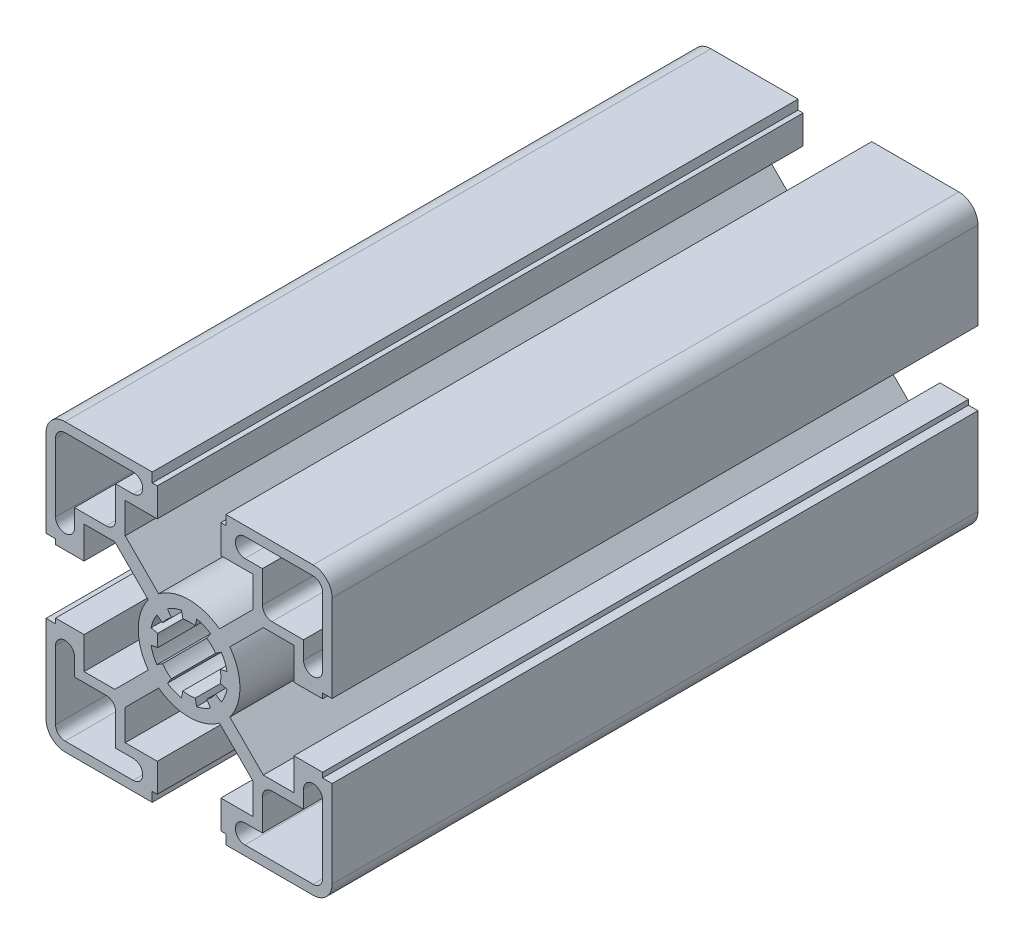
ISO-10303-21;
HEADER;
FILE_DESCRIPTION(('STEP AP214'),'2;1');
FILE_NAME('part.step','',(''),(''),'','','');
FILE_SCHEMA(('AUTOMOTIVE_DESIGN { 1 0 10303 214 1 1 1 1 }'));
ENDSEC;
DATA;
#1=APPLICATION_CONTEXT('core data for automotive mechanical design processes');
#2=APPLICATION_PROTOCOL_DEFINITION('international standard','automotive_design',2000,#1);
#3=PRODUCT_CONTEXT('',#1,'mechanical');
#4=PRODUCT('Part','Part','',(#3));
#5=PRODUCT_RELATED_PRODUCT_CATEGORY('part','',(#4));
#6=PRODUCT_DEFINITION_FORMATION('','',#4);
#7=PRODUCT_DEFINITION_CONTEXT('part definition',#1,'design');
#8=PRODUCT_DEFINITION('design','',#6,#7);
#9=PRODUCT_DEFINITION_SHAPE('','',#8);
#10=(LENGTH_UNIT() NAMED_UNIT(*) SI_UNIT(.MILLI.,.METRE.));
#11=(NAMED_UNIT(*) PLANE_ANGLE_UNIT() SI_UNIT($,.RADIAN.));
#12=(NAMED_UNIT(*) SI_UNIT($,.STERADIAN.) SOLID_ANGLE_UNIT());
#13=UNCERTAINTY_MEASURE_WITH_UNIT(LENGTH_MEASURE(1.E-05),#10,'distance_accuracy_value','');
#14=(GEOMETRIC_REPRESENTATION_CONTEXT(3) GLOBAL_UNCERTAINTY_ASSIGNED_CONTEXT((#13)) GLOBAL_UNIT_ASSIGNED_CONTEXT((#10,
#11,#12)) REPRESENTATION_CONTEXT('',''));
#15=CARTESIAN_POINT('',(0.,0.,0.));
#16=DIRECTION('',(0.,0.,1.));
#17=DIRECTION('',(1.,0.,0.));
#18=AXIS2_PLACEMENT_3D('',#15,#16,#17);
#19=CARTESIAN_POINT('',(0.,0.,50.8));
#20=DIRECTION('',(0.,0.,1.));
#21=DIRECTION('',(1.,0.,0.));
#22=AXIS2_PLACEMENT_3D('',#19,#20,#21);
#23=PLANE('',#22);
#24=DIRECTION('',(1.,0.,0.));
#25=VECTOR('',#24,1.);
#26=CARTESIAN_POINT('',(-16.51,10.0457,50.8));
#27=LINE('',#26,#25);
#28=CARTESIAN_POINT('',(-16.51,10.0457,50.8));
#29=VERTEX_POINT('',#28);
#30=CARTESIAN_POINT('',(-11.6801066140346,10.0457,50.8));
#31=VERTEX_POINT('',#30);
#32=EDGE_CURVE('E1390',#29,#31,#27,.T.);
#33=ORIENTED_EDGE('',*,*,#32,.T.);
#34=DIRECTION('',(0.707106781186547,-0.707106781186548,0.));
#35=VECTOR('',#34,1.);
#36=CARTESIAN_POINT('',(-11.6801066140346,10.0457,50.8));
#37=LINE('',#36,#35);
#38=CARTESIAN_POINT('',(-6.41543331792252,4.78102670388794,50.8));
#39=VERTEX_POINT('',#38);
#40=EDGE_CURVE('E1393',#31,#39,#37,.T.);
#41=ORIENTED_EDGE('',*,*,#40,.T.);
#42=CARTESIAN_POINT('',(0.,0.,50.8));
#43=DIRECTION('',(0.,0.,1.));
#44=DIRECTION('',(1.,0.,0.));
#45=AXIS2_PLACEMENT_3D('',#42,#43,#44);
#46=CIRCLE('',#45,8.001);
#47=CARTESIAN_POINT('',(-6.41543331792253,-4.78102670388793,50.8));
#48=VERTEX_POINT('',#47);
#49=EDGE_CURVE('E1396',#39,#48,#46,.T.);
#50=ORIENTED_EDGE('',*,*,#49,.T.);
#51=DIRECTION('',(-0.707106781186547,-0.707106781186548,0.));
#52=VECTOR('',#51,1.);
#53=CARTESIAN_POINT('',(-11.6801066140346,-10.0457,50.8));
#54=LINE('',#53,#52);
#55=CARTESIAN_POINT('',(-11.6801066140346,-10.0457,50.8));
#56=VERTEX_POINT('',#55);
#57=EDGE_CURVE('E1398',#48,#56,#54,.T.);
#58=ORIENTED_EDGE('',*,*,#57,.T.);
#59=DIRECTION('',(-1.,0.,0.));
#60=VECTOR('',#59,1.);
#61=CARTESIAN_POINT('',(-16.51,-10.0457,50.8));
#62=LINE('',#61,#60);
#63=CARTESIAN_POINT('',(-16.51,-10.0457,50.8));
#64=VERTEX_POINT('',#63);
#65=EDGE_CURVE('E1400',#56,#64,#62,.T.);
#66=ORIENTED_EDGE('',*,*,#65,.T.);
#67=DIRECTION('',(0.,1.,0.));
#68=VECTOR('',#67,1.);
#69=CARTESIAN_POINT('',(-16.51,-5.0038,50.8));
#70=LINE('',#69,#68);
#71=CARTESIAN_POINT('',(-16.51,-5.0038,50.8));
#72=VERTEX_POINT('',#71);
#73=EDGE_CURVE('E1402',#64,#72,#70,.T.);
#74=ORIENTED_EDGE('',*,*,#73,.T.);
#75=DIRECTION('',(-1.,0.,0.));
#76=VECTOR('',#75,1.);
#77=CARTESIAN_POINT('',(-21.0058,-5.0038,50.8));
#78=LINE('',#77,#76);
#79=CARTESIAN_POINT('',(-21.0058,-5.0038,50.8));
#80=VERTEX_POINT('',#79);
#81=EDGE_CURVE('E1404',#72,#80,#78,.T.);
#82=ORIENTED_EDGE('',*,*,#81,.T.);
#83=DIRECTION('',(0.,-1.,0.));
#84=VECTOR('',#83,1.);
#85=CARTESIAN_POINT('',(-21.0058,-5.7912,50.8));
#86=LINE('',#85,#84);
#87=CARTESIAN_POINT('',(-21.0058,-5.7912,50.8));
#88=VERTEX_POINT('',#87);
#89=EDGE_CURVE('E1406',#80,#88,#86,.T.);
#90=ORIENTED_EDGE('',*,*,#89,.T.);
#91=DIRECTION('',(-1.,0.,0.));
#92=VECTOR('',#91,1.);
#93=CARTESIAN_POINT('',(-22.5044,-5.7912,50.8));
#94=LINE('',#93,#92);
#95=CARTESIAN_POINT('',(-22.5044,-5.7912,50.8));
#96=VERTEX_POINT('',#95);
#97=EDGE_CURVE('E1408',#88,#96,#94,.T.);
#98=ORIENTED_EDGE('',*,*,#97,.T.);
#99=DIRECTION('',(0.,-1.,0.));
#100=VECTOR('',#99,1.);
#101=CARTESIAN_POINT('',(-22.5044,-19.5072,50.8));
#102=LINE('',#101,#100);
#103=CARTESIAN_POINT('',(-22.5044,-19.5072,50.8));
#104=VERTEX_POINT('',#103);
#105=EDGE_CURVE('E1410',#96,#104,#102,.T.);
#106=ORIENTED_EDGE('',*,*,#105,.T.);
#107=CARTESIAN_POINT('',(-19.5072,-19.5072,50.8));
#108=DIRECTION('',(0.,0.,1.));
#109=DIRECTION('',(1.,0.,0.));
#110=AXIS2_PLACEMENT_3D('',#107,#108,#109);
#111=CIRCLE('',#110,2.9972);
#112=CARTESIAN_POINT('',(-19.5072,-22.5044,50.8));
#113=VERTEX_POINT('',#112);
#114=EDGE_CURVE('E1412',#104,#113,#111,.T.);
#115=ORIENTED_EDGE('',*,*,#114,.T.);
#116=DIRECTION('',(1.,0.,0.));
#117=VECTOR('',#116,1.);
#118=CARTESIAN_POINT('',(-19.5072,-22.5044,50.8));
#119=LINE('',#118,#117);
#120=CARTESIAN_POINT('',(-5.7912,-22.5044,50.8));
#121=VERTEX_POINT('',#120);
#122=EDGE_CURVE('E1414',#113,#121,#119,.T.);
#123=ORIENTED_EDGE('',*,*,#122,.T.);
#124=DIRECTION('',(0.,1.,0.));
#125=VECTOR('',#124,1.);
#126=CARTESIAN_POINT('',(-5.7912,-22.5044,50.8));
#127=LINE('',#126,#125);
#128=CARTESIAN_POINT('',(-5.7912,-21.0058,50.8));
#129=VERTEX_POINT('',#128);
#130=EDGE_CURVE('E1416',#121,#129,#127,.T.);
#131=ORIENTED_EDGE('',*,*,#130,.T.);
#132=DIRECTION('',(1.,0.,0.));
#133=VECTOR('',#132,1.);
#134=CARTESIAN_POINT('',(-5.7912,-21.0058,50.8));
#135=LINE('',#134,#133);
#136=CARTESIAN_POINT('',(-5.0038,-21.0058,50.8));
#137=VERTEX_POINT('',#136);
#138=EDGE_CURVE('E1418',#129,#137,#135,.T.);
#139=ORIENTED_EDGE('',*,*,#138,.T.);
#140=DIRECTION('',(0.,1.,0.));
#141=VECTOR('',#140,1.);
#142=CARTESIAN_POINT('',(-5.0038,-21.0058,50.8));
#143=LINE('',#142,#141);
#144=CARTESIAN_POINT('',(-5.0038,-16.51,50.8));
#145=VERTEX_POINT('',#144);
#146=EDGE_CURVE('E1420',#137,#145,#143,.T.);
#147=ORIENTED_EDGE('',*,*,#146,.T.);
#148=DIRECTION('',(-1.,0.,0.));
#149=VECTOR('',#148,1.);
#150=CARTESIAN_POINT('',(-5.0038,-16.51,50.8));
#151=LINE('',#150,#149);
#152=CARTESIAN_POINT('',(-10.0457,-16.51,50.8));
#153=VERTEX_POINT('',#152);
#154=EDGE_CURVE('E1422',#145,#153,#151,.T.);
#155=ORIENTED_EDGE('',*,*,#154,.T.);
#156=DIRECTION('',(0.,1.,0.));
#157=VECTOR('',#156,1.);
#158=CARTESIAN_POINT('',(-10.0457,-16.51,50.8));
#159=LINE('',#158,#157);
#160=CARTESIAN_POINT('',(-10.0457,-11.6801066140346,50.8));
#161=VERTEX_POINT('',#160);
#162=EDGE_CURVE('E1424',#153,#161,#159,.T.);
#163=ORIENTED_EDGE('',*,*,#162,.T.);
#164=DIRECTION('',(0.707106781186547,0.707106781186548,0.));
#165=VECTOR('',#164,1.);
#166=CARTESIAN_POINT('',(-10.0457,-11.6801066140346,50.8));
#167=LINE('',#166,#165);
#168=CARTESIAN_POINT('',(-4.78102670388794,-6.41543331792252,50.8));
#169=VERTEX_POINT('',#168);
#170=EDGE_CURVE('E1426',#161,#169,#167,.T.);
#171=ORIENTED_EDGE('',*,*,#170,.T.);
#172=CARTESIAN_POINT('',(0.,0.,50.8));
#173=DIRECTION('',(0.,0.,1.));
#174=DIRECTION('',(1.,0.,0.));
#175=AXIS2_PLACEMENT_3D('',#172,#173,#174);
#176=CIRCLE('',#175,8.001);
#177=CARTESIAN_POINT('',(4.78102670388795,-6.41543331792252,50.8));
#178=VERTEX_POINT('',#177);
#179=EDGE_CURVE('E1428',#169,#178,#176,.T.);
#180=ORIENTED_EDGE('',*,*,#179,.T.);
#181=DIRECTION('',(0.707106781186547,-0.707106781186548,0.));
#182=VECTOR('',#181,1.);
#183=CARTESIAN_POINT('',(10.0457,-11.6801066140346,50.8));
#184=LINE('',#183,#182);
#185=CARTESIAN_POINT('',(10.0457,-11.6801066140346,50.8));
#186=VERTEX_POINT('',#185);
#187=EDGE_CURVE('E1430',#178,#186,#184,.T.);
#188=ORIENTED_EDGE('',*,*,#187,.T.);
#189=DIRECTION('',(0.,-1.,0.));
#190=VECTOR('',#189,1.);
#191=CARTESIAN_POINT('',(10.0457,-16.51,50.8));
#192=LINE('',#191,#190);
#193=CARTESIAN_POINT('',(10.0457,-16.51,50.8));
#194=VERTEX_POINT('',#193);
#195=EDGE_CURVE('E1432',#186,#194,#192,.T.);
#196=ORIENTED_EDGE('',*,*,#195,.T.);
#197=DIRECTION('',(-1.,0.,0.));
#198=VECTOR('',#197,1.);
#199=CARTESIAN_POINT('',(5.00380000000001,-16.51,50.8));
#200=LINE('',#199,#198);
#201=CARTESIAN_POINT('',(5.00380000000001,-16.51,50.8));
#202=VERTEX_POINT('',#201);
#203=EDGE_CURVE('E1434',#194,#202,#200,.T.);
#204=ORIENTED_EDGE('',*,*,#203,.T.);
#205=DIRECTION('',(0.,-1.,0.));
#206=VECTOR('',#205,1.);
#207=CARTESIAN_POINT('',(5.00380000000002,-21.0058,50.8));
#208=LINE('',#207,#206);
#209=CARTESIAN_POINT('',(5.00380000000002,-21.0058,50.8));
#210=VERTEX_POINT('',#209);
#211=EDGE_CURVE('E1436',#202,#210,#208,.T.);
#212=ORIENTED_EDGE('',*,*,#211,.T.);
#213=DIRECTION('',(1.,0.,0.));
#214=VECTOR('',#213,1.);
#215=CARTESIAN_POINT('',(5.79120000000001,-21.0058,50.8));
#216=LINE('',#215,#214);
#217=CARTESIAN_POINT('',(5.79120000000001,-21.0058,50.8));
#218=VERTEX_POINT('',#217);
#219=EDGE_CURVE('E1438',#210,#218,#216,.T.);
#220=ORIENTED_EDGE('',*,*,#219,.T.);
#221=DIRECTION('',(0.,-1.,0.));
#222=VECTOR('',#221,1.);
#223=CARTESIAN_POINT('',(5.79120000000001,-22.5044,50.8));
#224=LINE('',#223,#222);
#225=CARTESIAN_POINT('',(5.79120000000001,-22.5044,50.8));
#226=VERTEX_POINT('',#225);
#227=EDGE_CURVE('E1440',#218,#226,#224,.T.);
#228=ORIENTED_EDGE('',*,*,#227,.T.);
#229=DIRECTION('',(1.,0.,0.));
#230=VECTOR('',#229,1.);
#231=CARTESIAN_POINT('',(19.5072,-22.5044,50.8));
#232=LINE('',#231,#230);
#233=CARTESIAN_POINT('',(19.5072,-22.5044,50.8));
#234=VERTEX_POINT('',#233);
#235=EDGE_CURVE('E1442',#226,#234,#232,.T.);
#236=ORIENTED_EDGE('',*,*,#235,.T.);
#237=CARTESIAN_POINT('',(19.5072,-19.5072,50.8));
#238=DIRECTION('',(0.,0.,1.));
#239=DIRECTION('',(-1.,0.,0.));
#240=AXIS2_PLACEMENT_3D('',#237,#238,#239);
#241=CIRCLE('',#240,2.9972);
#242=CARTESIAN_POINT('',(22.5044,-19.5072,50.8));
#243=VERTEX_POINT('',#242);
#244=EDGE_CURVE('E1444',#234,#243,#241,.T.);
#245=ORIENTED_EDGE('',*,*,#244,.T.);
#246=DIRECTION('',(0.,1.,0.));
#247=VECTOR('',#246,1.);
#248=CARTESIAN_POINT('',(22.5044,-19.5072,50.8));
#249=LINE('',#248,#247);
#250=CARTESIAN_POINT('',(22.5044,-5.7912,50.8));
#251=VERTEX_POINT('',#250);
#252=EDGE_CURVE('E1446',#243,#251,#249,.T.);
#253=ORIENTED_EDGE('',*,*,#252,.T.);
#254=DIRECTION('',(-1.,0.,0.));
#255=VECTOR('',#254,1.);
#256=CARTESIAN_POINT('',(22.5044,-5.7912,50.8));
#257=LINE('',#256,#255);
#258=CARTESIAN_POINT('',(21.0058,-5.7912,50.8));
#259=VERTEX_POINT('',#258);
#260=EDGE_CURVE('E1448',#251,#259,#257,.T.);
#261=ORIENTED_EDGE('',*,*,#260,.T.);
#262=DIRECTION('',(0.,1.,0.));
#263=VECTOR('',#262,1.);
#264=CARTESIAN_POINT('',(21.0058,-5.7912,50.8));
#265=LINE('',#264,#263);
#266=CARTESIAN_POINT('',(21.0058,-5.0038,50.8));
#267=VERTEX_POINT('',#266);
#268=EDGE_CURVE('E1450',#259,#267,#265,.T.);
#269=ORIENTED_EDGE('',*,*,#268,.T.);
#270=DIRECTION('',(-1.,0.,0.));
#271=VECTOR('',#270,1.);
#272=CARTESIAN_POINT('',(21.0058,-5.0038,50.8));
#273=LINE('',#272,#271);
#274=CARTESIAN_POINT('',(16.51,-5.0038,50.8));
#275=VERTEX_POINT('',#274);
#276=EDGE_CURVE('E1452',#267,#275,#273,.T.);
#277=ORIENTED_EDGE('',*,*,#276,.T.);
#278=DIRECTION('',(0.,-1.,0.));
#279=VECTOR('',#278,1.);
#280=CARTESIAN_POINT('',(16.51,-5.0038,50.8));
#281=LINE('',#280,#279);
#282=CARTESIAN_POINT('',(16.51,-10.0457,50.8));
#283=VERTEX_POINT('',#282);
#284=EDGE_CURVE('E1454',#275,#283,#281,.T.);
#285=ORIENTED_EDGE('',*,*,#284,.T.);
#286=DIRECTION('',(-1.,0.,0.));
#287=VECTOR('',#286,1.);
#288=CARTESIAN_POINT('',(16.51,-10.0457,50.8));
#289=LINE('',#288,#287);
#290=CARTESIAN_POINT('',(11.6801066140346,-10.0457,50.8));
#291=VERTEX_POINT('',#290);
#292=EDGE_CURVE('E1456',#283,#291,#289,.T.);
#293=ORIENTED_EDGE('',*,*,#292,.T.);
#294=DIRECTION('',(-0.707106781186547,0.707106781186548,0.));
#295=VECTOR('',#294,1.);
#296=CARTESIAN_POINT('',(11.6801066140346,-10.0457,50.8));
#297=LINE('',#296,#295);
#298=CARTESIAN_POINT('',(6.41543331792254,-4.78102670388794,50.8));
#299=VERTEX_POINT('',#298);
#300=EDGE_CURVE('E1458',#291,#299,#297,.T.);
#301=ORIENTED_EDGE('',*,*,#300,.T.);
#302=CARTESIAN_POINT('',(0.,0.,50.8));
#303=DIRECTION('',(0.,0.,1.));
#304=DIRECTION('',(1.,0.,0.));
#305=AXIS2_PLACEMENT_3D('',#302,#303,#304);
#306=CIRCLE('',#305,8.001);
#307=CARTESIAN_POINT('',(6.41543331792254,4.78102670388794,50.8));
#308=VERTEX_POINT('',#307);
#309=EDGE_CURVE('E1460',#299,#308,#306,.T.);
#310=ORIENTED_EDGE('',*,*,#309,.T.);
#311=DIRECTION('',(0.707106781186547,0.707106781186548,0.));
#312=VECTOR('',#311,1.);
#313=CARTESIAN_POINT('',(11.6801066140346,10.0457,50.8));
#314=LINE('',#313,#312);
#315=CARTESIAN_POINT('',(11.6801066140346,10.0457,50.8));
#316=VERTEX_POINT('',#315);
#317=EDGE_CURVE('E1462',#308,#316,#314,.T.);
#318=ORIENTED_EDGE('',*,*,#317,.T.);
#319=DIRECTION('',(1.,0.,0.));
#320=VECTOR('',#319,1.);
#321=CARTESIAN_POINT('',(16.51,10.0457,50.8));
#322=LINE('',#321,#320);
#323=CARTESIAN_POINT('',(16.51,10.0457,50.8));
#324=VERTEX_POINT('',#323);
#325=EDGE_CURVE('E1464',#316,#324,#322,.T.);
#326=ORIENTED_EDGE('',*,*,#325,.T.);
#327=DIRECTION('',(0.,-1.,0.));
#328=VECTOR('',#327,1.);
#329=CARTESIAN_POINT('',(16.51,5.0038,50.8));
#330=LINE('',#329,#328);
#331=CARTESIAN_POINT('',(16.51,5.0038,50.8));
#332=VERTEX_POINT('',#331);
#333=EDGE_CURVE('E1466',#324,#332,#330,.T.);
#334=ORIENTED_EDGE('',*,*,#333,.T.);
#335=DIRECTION('',(1.,0.,0.));
#336=VECTOR('',#335,1.);
#337=CARTESIAN_POINT('',(21.0058,5.0038,50.8));
#338=LINE('',#337,#336);
#339=CARTESIAN_POINT('',(21.0058,5.0038,50.8));
#340=VERTEX_POINT('',#339);
#341=EDGE_CURVE('E1468',#332,#340,#338,.T.);
#342=ORIENTED_EDGE('',*,*,#341,.T.);
#343=DIRECTION('',(0.,1.,0.));
#344=VECTOR('',#343,1.);
#345=CARTESIAN_POINT('',(21.0058,5.7912,50.8));
#346=LINE('',#345,#344);
#347=CARTESIAN_POINT('',(21.0058,5.7912,50.8));
#348=VERTEX_POINT('',#347);
#349=EDGE_CURVE('E1470',#340,#348,#346,.T.);
#350=ORIENTED_EDGE('',*,*,#349,.T.);
#351=DIRECTION('',(1.,0.,0.));
#352=VECTOR('',#351,1.);
#353=CARTESIAN_POINT('',(22.5044,5.7912,50.8));
#354=LINE('',#353,#352);
#355=CARTESIAN_POINT('',(22.5044,5.7912,50.8));
#356=VERTEX_POINT('',#355);
#357=EDGE_CURVE('E1472',#348,#356,#354,.T.);
#358=ORIENTED_EDGE('',*,*,#357,.T.);
#359=DIRECTION('',(0.,1.,0.));
#360=VECTOR('',#359,1.);
#361=CARTESIAN_POINT('',(22.5044,19.5072,50.8));
#362=LINE('',#361,#360);
#363=CARTESIAN_POINT('',(22.5044,19.5072,50.8));
#364=VERTEX_POINT('',#363);
#365=EDGE_CURVE('E1474',#356,#364,#362,.T.);
#366=ORIENTED_EDGE('',*,*,#365,.T.);
#367=CARTESIAN_POINT('',(19.5072,19.5072,50.8));
#368=DIRECTION('',(0.,0.,1.));
#369=DIRECTION('',(1.,0.,0.));
#370=AXIS2_PLACEMENT_3D('',#367,#368,#369);
#371=CIRCLE('',#370,2.9972);
#372=CARTESIAN_POINT('',(19.5072,22.5044,50.8));
#373=VERTEX_POINT('',#372);
#374=EDGE_CURVE('E1476',#364,#373,#371,.T.);
#375=ORIENTED_EDGE('',*,*,#374,.T.);
#376=DIRECTION('',(-1.,0.,0.));
#377=VECTOR('',#376,1.);
#378=CARTESIAN_POINT('',(19.5072,22.5044,50.8));
#379=LINE('',#378,#377);
#380=CARTESIAN_POINT('',(5.79120000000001,22.5044,50.8));
#381=VERTEX_POINT('',#380);
#382=EDGE_CURVE('E1478',#373,#381,#379,.T.);
#383=ORIENTED_EDGE('',*,*,#382,.T.);
#384=DIRECTION('',(0.,-1.,0.));
#385=VECTOR('',#384,1.);
#386=CARTESIAN_POINT('',(5.79120000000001,22.5044,50.8));
#387=LINE('',#386,#385);
#388=CARTESIAN_POINT('',(5.79120000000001,21.0058,50.8));
#389=VERTEX_POINT('',#388);
#390=EDGE_CURVE('E1480',#381,#389,#387,.T.);
#391=ORIENTED_EDGE('',*,*,#390,.T.);
#392=DIRECTION('',(-1.,0.,0.));
#393=VECTOR('',#392,1.);
#394=CARTESIAN_POINT('',(5.79120000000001,21.0058,50.8));
#395=LINE('',#394,#393);
#396=CARTESIAN_POINT('',(5.00380000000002,21.0058,50.8));
#397=VERTEX_POINT('',#396);
#398=EDGE_CURVE('E1482',#389,#397,#395,.T.);
#399=ORIENTED_EDGE('',*,*,#398,.T.);
#400=DIRECTION('',(0.,-1.,0.));
#401=VECTOR('',#400,1.);
#402=CARTESIAN_POINT('',(5.00380000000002,21.0058,50.8));
#403=LINE('',#402,#401);
#404=CARTESIAN_POINT('',(5.00380000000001,16.51,50.8));
#405=VERTEX_POINT('',#404);
#406=EDGE_CURVE('E1484',#397,#405,#403,.T.);
#407=ORIENTED_EDGE('',*,*,#406,.T.);
#408=DIRECTION('',(1.,0.,0.));
#409=VECTOR('',#408,1.);
#410=CARTESIAN_POINT('',(5.00380000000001,16.51,50.8));
#411=LINE('',#410,#409);
#412=CARTESIAN_POINT('',(10.0457,16.51,50.8));
#413=VERTEX_POINT('',#412);
#414=EDGE_CURVE('E1486',#405,#413,#411,.T.);
#415=ORIENTED_EDGE('',*,*,#414,.T.);
#416=DIRECTION('',(0.,-1.,0.));
#417=VECTOR('',#416,1.);
#418=CARTESIAN_POINT('',(10.0457,16.51,50.8));
#419=LINE('',#418,#417);
#420=CARTESIAN_POINT('',(10.0457,11.6801066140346,50.8));
#421=VERTEX_POINT('',#420);
#422=EDGE_CURVE('E1488',#413,#421,#419,.T.);
#423=ORIENTED_EDGE('',*,*,#422,.T.);
#424=DIRECTION('',(-0.707106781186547,-0.707106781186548,0.));
#425=VECTOR('',#424,1.);
#426=CARTESIAN_POINT('',(10.0457,11.6801066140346,50.8));
#427=LINE('',#426,#425);
#428=CARTESIAN_POINT('',(4.78102670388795,6.41543331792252,50.8));
#429=VERTEX_POINT('',#428);
#430=EDGE_CURVE('E1490',#421,#429,#427,.T.);
#431=ORIENTED_EDGE('',*,*,#430,.T.);
#432=CARTESIAN_POINT('',(0.,0.,50.8));
#433=DIRECTION('',(0.,0.,1.));
#434=DIRECTION('',(1.,0.,0.));
#435=AXIS2_PLACEMENT_3D('',#432,#433,#434);
#436=CIRCLE('',#435,8.001);
#437=CARTESIAN_POINT('',(-4.78102670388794,6.41543331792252,50.8));
#438=VERTEX_POINT('',#437);
#439=EDGE_CURVE('E1492',#429,#438,#436,.T.);
#440=ORIENTED_EDGE('',*,*,#439,.T.);
#441=DIRECTION('',(-0.707106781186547,0.707106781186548,0.));
#442=VECTOR('',#441,1.);
#443=CARTESIAN_POINT('',(-10.0457,11.6801066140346,50.8));
#444=LINE('',#443,#442);
#445=CARTESIAN_POINT('',(-10.0457,11.6801066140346,50.8));
#446=VERTEX_POINT('',#445);
#447=EDGE_CURVE('E1494',#438,#446,#444,.T.);
#448=ORIENTED_EDGE('',*,*,#447,.T.);
#449=DIRECTION('',(0.,1.,0.));
#450=VECTOR('',#449,1.);
#451=CARTESIAN_POINT('',(-10.0457,16.51,50.8));
#452=LINE('',#451,#450);
#453=CARTESIAN_POINT('',(-10.0457,16.51,50.8));
#454=VERTEX_POINT('',#453);
#455=EDGE_CURVE('E1496',#446,#454,#452,.T.);
#456=ORIENTED_EDGE('',*,*,#455,.T.);
#457=DIRECTION('',(1.,0.,0.));
#458=VECTOR('',#457,1.);
#459=CARTESIAN_POINT('',(-5.0038,16.51,50.8));
#460=LINE('',#459,#458);
#461=CARTESIAN_POINT('',(-5.0038,16.51,50.8));
#462=VERTEX_POINT('',#461);
#463=EDGE_CURVE('E1498',#454,#462,#460,.T.);
#464=ORIENTED_EDGE('',*,*,#463,.T.);
#465=DIRECTION('',(0.,1.,0.));
#466=VECTOR('',#465,1.);
#467=CARTESIAN_POINT('',(-5.0038,21.0058,50.8));
#468=LINE('',#467,#466);
#469=CARTESIAN_POINT('',(-5.0038,21.0058,50.8));
#470=VERTEX_POINT('',#469);
#471=EDGE_CURVE('E1500',#462,#470,#468,.T.);
#472=ORIENTED_EDGE('',*,*,#471,.T.);
#473=DIRECTION('',(-1.,0.,0.));
#474=VECTOR('',#473,1.);
#475=CARTESIAN_POINT('',(-5.7912,21.0058,50.8));
#476=LINE('',#475,#474);
#477=CARTESIAN_POINT('',(-5.7912,21.0058,50.8));
#478=VERTEX_POINT('',#477);
#479=EDGE_CURVE('E1502',#470,#478,#476,.T.);
#480=ORIENTED_EDGE('',*,*,#479,.T.);
#481=DIRECTION('',(0.,1.,0.));
#482=VECTOR('',#481,1.);
#483=CARTESIAN_POINT('',(-5.7912,22.5044,50.8));
#484=LINE('',#483,#482);
#485=CARTESIAN_POINT('',(-5.7912,22.5044,50.8));
#486=VERTEX_POINT('',#485);
#487=EDGE_CURVE('E1504',#478,#486,#484,.T.);
#488=ORIENTED_EDGE('',*,*,#487,.T.);
#489=DIRECTION('',(-1.,0.,0.));
#490=VECTOR('',#489,1.);
#491=CARTESIAN_POINT('',(-19.5072,22.5044,50.8));
#492=LINE('',#491,#490);
#493=CARTESIAN_POINT('',(-19.5072,22.5044,50.8));
#494=VERTEX_POINT('',#493);
#495=EDGE_CURVE('E1506',#486,#494,#492,.T.);
#496=ORIENTED_EDGE('',*,*,#495,.T.);
#497=CARTESIAN_POINT('',(-19.5072,19.5072,50.8));
#498=DIRECTION('',(0.,0.,1.));
#499=DIRECTION('',(-1.,0.,0.));
#500=AXIS2_PLACEMENT_3D('',#497,#498,#499);
#501=CIRCLE('',#500,2.9972);
#502=CARTESIAN_POINT('',(-22.5044,19.5072,50.8));
#503=VERTEX_POINT('',#502);
#504=EDGE_CURVE('E1508',#494,#503,#501,.T.);
#505=ORIENTED_EDGE('',*,*,#504,.T.);
#506=DIRECTION('',(0.,-1.,0.));
#507=VECTOR('',#506,1.);
#508=CARTESIAN_POINT('',(-22.5044,19.5072,50.8));
#509=LINE('',#508,#507);
#510=CARTESIAN_POINT('',(-22.5044,5.7912,50.8));
#511=VERTEX_POINT('',#510);
#512=EDGE_CURVE('E1510',#503,#511,#509,.T.);
#513=ORIENTED_EDGE('',*,*,#512,.T.);
#514=DIRECTION('',(1.,0.,0.));
#515=VECTOR('',#514,1.);
#516=CARTESIAN_POINT('',(-22.5044,5.7912,50.8));
#517=LINE('',#516,#515);
#518=CARTESIAN_POINT('',(-21.0058,5.7912,50.8));
#519=VERTEX_POINT('',#518);
#520=EDGE_CURVE('E1512',#511,#519,#517,.T.);
#521=ORIENTED_EDGE('',*,*,#520,.T.);
#522=DIRECTION('',(0.,-1.,0.));
#523=VECTOR('',#522,1.);
#524=CARTESIAN_POINT('',(-21.0058,5.7912,50.8));
#525=LINE('',#524,#523);
#526=CARTESIAN_POINT('',(-21.0058,5.0038,50.8));
#527=VERTEX_POINT('',#526);
#528=EDGE_CURVE('E1514',#519,#527,#525,.T.);
#529=ORIENTED_EDGE('',*,*,#528,.T.);
#530=DIRECTION('',(1.,0.,0.));
#531=VECTOR('',#530,1.);
#532=CARTESIAN_POINT('',(-21.0058,5.0038,50.8));
#533=LINE('',#532,#531);
#534=CARTESIAN_POINT('',(-16.51,5.0038,50.8));
#535=VERTEX_POINT('',#534);
#536=EDGE_CURVE('E1516',#527,#535,#533,.T.);
#537=ORIENTED_EDGE('',*,*,#536,.T.);
#538=DIRECTION('',(0.,1.,0.));
#539=VECTOR('',#538,1.);
#540=CARTESIAN_POINT('',(-16.51,5.0038,50.8));
#541=LINE('',#540,#539);
#542=EDGE_CURVE('E1518',#535,#29,#541,.T.);
#543=ORIENTED_EDGE('',*,*,#542,.T.);
#544=EDGE_LOOP('',(#33,#41,#50,#58,#66,#74,#82,#90,#98,#106,#115,#123,#131,#139,#147,#155,#163,
#171,#180,#188,#196,#204,#212,#220,#228,#236,#245,#253,#261,#269,#277,#285,#293,#301,#310,#318,
#326,#334,#342,#350,#358,#366,#375,#383,#391,#399,#407,#415,#423,#431,#440,#448,#456,#464,#472,
#480,#488,#496,#505,#513,#521,#529,#537,#543));
#545=FACE_BOUND('',#544,.T.);
#546=DIRECTION('',(-1.,0.,0.));
#547=VECTOR('',#546,1.);
#548=CARTESIAN_POINT('',(-19.5072,21.0058,50.8));
#549=LINE('',#548,#547);
#550=CARTESIAN_POINT('',(-8.7884,21.0058,50.8));
#551=VERTEX_POINT('',#550);
#552=CARTESIAN_POINT('',(-19.5072,21.0058,50.8));
#553=VERTEX_POINT('',#552);
#554=EDGE_CURVE('E1319',#551,#553,#549,.T.);
#555=ORIENTED_EDGE('',*,*,#554,.F.);
#556=CARTESIAN_POINT('',(-8.78839999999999,19.5072,50.8));
#557=DIRECTION('',(0.,0.,1.));
#558=DIRECTION('',(-1.,0.,0.));
#559=AXIS2_PLACEMENT_3D('',#556,#557,#558);
#560=CIRCLE('',#559,1.4986);
#561=CARTESIAN_POINT('',(-8.78839999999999,18.0086,50.8));
#562=VERTEX_POINT('',#561);
#563=EDGE_CURVE('E1317',#562,#551,#560,.T.);
#564=ORIENTED_EDGE('',*,*,#563,.F.);
#565=DIRECTION('',(1.,0.,0.));
#566=VECTOR('',#565,1.);
#567=CARTESIAN_POINT('',(-11.5443,18.0086,50.8));
#568=LINE('',#567,#566);
#569=CARTESIAN_POINT('',(-11.5443,18.0086,50.8));
#570=VERTEX_POINT('',#569);
#571=EDGE_CURVE('E1337',#570,#562,#568,.T.);
#572=ORIENTED_EDGE('',*,*,#571,.F.);
#573=DIRECTION('',(0.,1.,0.));
#574=VECTOR('',#573,1.);
#575=CARTESIAN_POINT('',(-11.5443,18.0086,50.8));
#576=LINE('',#575,#574);
#577=CARTESIAN_POINT('',(-11.5443,13.0429,50.8));
#578=VERTEX_POINT('',#577);
#579=EDGE_CURVE('E1334',#578,#570,#576,.T.);
#580=ORIENTED_EDGE('',*,*,#579,.F.);
#581=CARTESIAN_POINT('',(-13.0429,13.0429,50.8));
#582=DIRECTION('',(0.,0.,1.));
#583=DIRECTION('',(-1.,0.,0.));
#584=AXIS2_PLACEMENT_3D('',#581,#582,#583);
#585=CIRCLE('',#584,1.4986);
#586=CARTESIAN_POINT('',(-13.0429,11.5443,50.8));
#587=VERTEX_POINT('',#586);
#588=EDGE_CURVE('E1332',#587,#578,#585,.T.);
#589=ORIENTED_EDGE('',*,*,#588,.F.);
#590=DIRECTION('',(1.,0.,0.));
#591=VECTOR('',#590,1.);
#592=CARTESIAN_POINT('',(-18.0086,11.5443,50.8));
#593=LINE('',#592,#591);
#594=CARTESIAN_POINT('',(-18.0086,11.5443,50.8));
#595=VERTEX_POINT('',#594);
#596=EDGE_CURVE('E1330',#595,#587,#593,.T.);
#597=ORIENTED_EDGE('',*,*,#596,.F.);
#598=DIRECTION('',(0.,1.,0.));
#599=VECTOR('',#598,1.);
#600=CARTESIAN_POINT('',(-18.0086,11.5443,50.8));
#601=LINE('',#600,#599);
#602=CARTESIAN_POINT('',(-18.0086,8.78840000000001,50.8));
#603=VERTEX_POINT('',#602);
#604=EDGE_CURVE('E1328',#603,#595,#601,.T.);
#605=ORIENTED_EDGE('',*,*,#604,.F.);
#606=CARTESIAN_POINT('',(-19.5072,8.7884,50.8));
#607=DIRECTION('',(0.,0.,1.));
#608=DIRECTION('',(1.,0.,0.));
#609=AXIS2_PLACEMENT_3D('',#606,#607,#608);
#610=CIRCLE('',#609,1.4986);
#611=CARTESIAN_POINT('',(-21.0058,8.78840000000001,50.8));
#612=VERTEX_POINT('',#611);
#613=EDGE_CURVE('E1326',#612,#603,#610,.T.);
#614=ORIENTED_EDGE('',*,*,#613,.F.);
#615=DIRECTION('',(0.,-1.,0.));
#616=VECTOR('',#615,1.);
#617=CARTESIAN_POINT('',(-21.0058,19.5072,50.8));
#618=LINE('',#617,#616);
#619=CARTESIAN_POINT('',(-21.0058,19.5072,50.8));
#620=VERTEX_POINT('',#619);
#621=EDGE_CURVE('E1324',#620,#612,#618,.T.);
#622=ORIENTED_EDGE('',*,*,#621,.F.);
#623=CARTESIAN_POINT('',(-19.5072,19.5072,50.8));
#624=DIRECTION('',(0.,0.,1.));
#625=DIRECTION('',(-1.,0.,0.));
#626=AXIS2_PLACEMENT_3D('',#623,#624,#625);
#627=CIRCLE('',#626,1.4986);
#628=EDGE_CURVE('E1322',#553,#620,#627,.T.);
#629=ORIENTED_EDGE('',*,*,#628,.F.);
#630=EDGE_LOOP('',(#555,#564,#572,#580,#589,#597,#605,#614,#622,#629));
#631=FACE_BOUND('',#630,.T.);
#632=DIRECTION('',(1.,0.,0.));
#633=VECTOR('',#632,1.);
#634=CARTESIAN_POINT('',(11.5443,18.0086,50.8));
#635=LINE('',#634,#633);
#636=CARTESIAN_POINT('',(8.78840000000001,18.0086,50.8));
#637=VERTEX_POINT('',#636);
#638=CARTESIAN_POINT('',(11.5443,18.0086,50.8));
#639=VERTEX_POINT('',#638);
#640=EDGE_CURVE('E1246',#637,#639,#635,.T.);
#641=ORIENTED_EDGE('',*,*,#640,.F.);
#642=CARTESIAN_POINT('',(8.78840000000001,19.5072,50.8));
#643=DIRECTION('',(0.,0.,1.));
#644=DIRECTION('',(1.,0.,0.));
#645=AXIS2_PLACEMENT_3D('',#642,#643,#644);
#646=CIRCLE('',#645,1.4986);
#647=CARTESIAN_POINT('',(8.78840000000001,21.0058,50.8));
#648=VERTEX_POINT('',#647);
#649=EDGE_CURVE('E1244',#648,#637,#646,.T.);
#650=ORIENTED_EDGE('',*,*,#649,.F.);
#651=DIRECTION('',(-1.,0.,0.));
#652=VECTOR('',#651,1.);
#653=CARTESIAN_POINT('',(19.5072,21.0058,50.8));
#654=LINE('',#653,#652);
#655=CARTESIAN_POINT('',(19.5072,21.0058,50.8));
#656=VERTEX_POINT('',#655);
#657=EDGE_CURVE('E1264',#656,#648,#654,.T.);
#658=ORIENTED_EDGE('',*,*,#657,.F.);
#659=CARTESIAN_POINT('',(19.5072,19.5072,50.8));
#660=DIRECTION('',(0.,0.,1.));
#661=DIRECTION('',(1.,0.,0.));
#662=AXIS2_PLACEMENT_3D('',#659,#660,#661);
#663=CIRCLE('',#662,1.4986);
#664=CARTESIAN_POINT('',(21.0058,19.5072,50.8));
#665=VERTEX_POINT('',#664);
#666=EDGE_CURVE('E1261',#665,#656,#663,.T.);
#667=ORIENTED_EDGE('',*,*,#666,.F.);
#668=DIRECTION('',(0.,1.,0.));
#669=VECTOR('',#668,1.);
#670=CARTESIAN_POINT('',(21.0058,19.5072,50.8));
#671=LINE('',#670,#669);
#672=CARTESIAN_POINT('',(21.0058,8.7884,50.8));
#673=VERTEX_POINT('',#672);
#674=EDGE_CURVE('E1259',#673,#665,#671,.T.);
#675=ORIENTED_EDGE('',*,*,#674,.F.);
#676=CARTESIAN_POINT('',(19.5072,8.7884,50.8));
#677=DIRECTION('',(0.,0.,1.));
#678=DIRECTION('',(-1.,0.,0.));
#679=AXIS2_PLACEMENT_3D('',#676,#677,#678);
#680=CIRCLE('',#679,1.49860000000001);
#681=CARTESIAN_POINT('',(18.0086,8.7884,50.8));
#682=VERTEX_POINT('',#681);
#683=EDGE_CURVE('E1257',#682,#673,#680,.T.);
#684=ORIENTED_EDGE('',*,*,#683,.F.);
#685=DIRECTION('',(0.,-1.,0.));
#686=VECTOR('',#685,1.);
#687=CARTESIAN_POINT('',(18.0086,11.5443,50.8));
#688=LINE('',#687,#686);
#689=CARTESIAN_POINT('',(18.0086,11.5443,50.8));
#690=VERTEX_POINT('',#689);
#691=EDGE_CURVE('E1255',#690,#682,#688,.T.);
#692=ORIENTED_EDGE('',*,*,#691,.F.);
#693=DIRECTION('',(1.,0.,0.));
#694=VECTOR('',#693,1.);
#695=CARTESIAN_POINT('',(18.0086,11.5443,50.8));
#696=LINE('',#695,#694);
#697=CARTESIAN_POINT('',(13.0429,11.5443,50.8));
#698=VERTEX_POINT('',#697);
#699=EDGE_CURVE('E1253',#698,#690,#696,.T.);
#700=ORIENTED_EDGE('',*,*,#699,.F.);
#701=CARTESIAN_POINT('',(13.0429,13.0429,50.8));
#702=DIRECTION('',(0.,0.,1.));
#703=DIRECTION('',(1.,0.,0.));
#704=AXIS2_PLACEMENT_3D('',#701,#702,#703);
#705=CIRCLE('',#704,1.4986);
#706=CARTESIAN_POINT('',(11.5443,13.0429,50.8));
#707=VERTEX_POINT('',#706);
#708=EDGE_CURVE('E1251',#707,#698,#705,.T.);
#709=ORIENTED_EDGE('',*,*,#708,.F.);
#710=DIRECTION('',(0.,-1.,0.));
#711=VECTOR('',#710,1.);
#712=CARTESIAN_POINT('',(11.5443,18.0086,50.8));
#713=LINE('',#712,#711);
#714=EDGE_CURVE('E1249',#639,#707,#713,.T.);
#715=ORIENTED_EDGE('',*,*,#714,.F.);
#716=EDGE_LOOP('',(#641,#650,#658,#667,#675,#684,#692,#700,#709,#715));
#717=FACE_BOUND('',#716,.T.);
#718=DIRECTION('',(-0.195090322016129,-0.98078528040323,0.));
#719=VECTOR('',#718,1.);
#720=CARTESIAN_POINT('',(1.18927060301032,5.97886706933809,50.8));
#721=LINE('',#720,#719);
#722=CARTESIAN_POINT('',(1.18927060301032,5.97886706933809,50.8));
#723=VERTEX_POINT('',#722);
#724=CARTESIAN_POINT('',(0.976192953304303,4.90765338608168,50.8));
#725=VERTEX_POINT('',#724);
#726=EDGE_CURVE('E1019',#723,#725,#721,.T.);
#727=ORIENTED_EDGE('',*,*,#726,.F.);
#728=CARTESIAN_POINT('',(0.,0.,50.8));
#729=DIRECTION('',(0.,0.,1.));
#730=DIRECTION('',(1.,0.,0.));
#731=AXIS2_PLACEMENT_3D('',#728,#729,#730);
#732=CIRCLE('',#731,6.096);
#733=CARTESIAN_POINT('',(3.3867561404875,5.06863875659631,50.8));
#734=VERTEX_POINT('',#733);
#735=EDGE_CURVE('E1017',#734,#723,#732,.T.);
#736=ORIENTED_EDGE('',*,*,#735,.F.);
#737=DIRECTION('',(0.555570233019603,0.831469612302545,0.));
#738=VECTOR('',#737,1.);
#739=CARTESIAN_POINT('',(3.3867561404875,5.06863875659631,50.8));
#740=LINE('',#739,#738);
#741=CARTESIAN_POINT('',(2.77996233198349,4.16050764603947,50.8));
#742=VERTEX_POINT('',#741);
#743=EDGE_CURVE('E1081',#742,#734,#740,.T.);
#744=ORIENTED_EDGE('',*,*,#743,.F.);
#745=CARTESIAN_POINT('',(0.,0.,50.8));
#746=DIRECTION('',(0.,0.,1.));
#747=DIRECTION('',(1.,0.,0.));
#748=AXIS2_PLACEMENT_3D('',#745,#746,#747);
#749=CIRCLE('',#748,5.00379999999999);
#750=CARTESIAN_POINT('',(4.16050764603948,2.77996233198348,50.8));
#751=VERTEX_POINT('',#750);
#752=EDGE_CURVE('E1078',#751,#742,#749,.T.);
#753=ORIENTED_EDGE('',*,*,#752,.F.);
#754=DIRECTION('',(-0.831469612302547,-0.5555702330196,0.));
#755=VECTOR('',#754,1.);
#756=CARTESIAN_POINT('',(5.06863875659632,3.38675614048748,50.8));
#757=LINE('',#756,#755);
#758=CARTESIAN_POINT('',(5.06863875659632,3.38675614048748,50.8));
#759=VERTEX_POINT('',#758);
#760=EDGE_CURVE('E1076',#759,#751,#757,.T.);
#761=ORIENTED_EDGE('',*,*,#760,.F.);
#762=CARTESIAN_POINT('',(0.,0.,50.8));
#763=DIRECTION('',(0.,0.,1.));
#764=DIRECTION('',(1.,0.,0.));
#765=AXIS2_PLACEMENT_3D('',#762,#763,#764);
#766=CIRCLE('',#765,6.09599999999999);
#767=CARTESIAN_POINT('',(5.9788670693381,1.1892706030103,50.8));
#768=VERTEX_POINT('',#767);
#769=EDGE_CURVE('E1074',#768,#759,#766,.T.);
#770=ORIENTED_EDGE('',*,*,#769,.F.);
#771=DIRECTION('',(0.980785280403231,0.195090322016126,0.));
#772=VECTOR('',#771,1.);
#773=CARTESIAN_POINT('',(5.9788670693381,1.1892706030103,50.8));
#774=LINE('',#773,#772);
#775=CARTESIAN_POINT('',(4.90765338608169,0.976192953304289,50.8));
#776=VERTEX_POINT('',#775);
#777=EDGE_CURVE('E1072',#776,#768,#774,.T.);
#778=ORIENTED_EDGE('',*,*,#777,.F.);
#779=CARTESIAN_POINT('',(0.,0.,50.8));
#780=DIRECTION('',(0.,0.,1.));
#781=DIRECTION('',(1.,0.,0.));
#782=AXIS2_PLACEMENT_3D('',#779,#780,#781);
#783=CIRCLE('',#782,5.00379999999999);
#784=CARTESIAN_POINT('',(4.90765338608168,-0.97619295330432,50.8));
#785=VERTEX_POINT('',#784);
#786=EDGE_CURVE('E1070',#785,#776,#783,.T.);
#787=ORIENTED_EDGE('',*,*,#786,.F.);
#788=DIRECTION('',(-0.98078528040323,0.195090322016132,0.));
#789=VECTOR('',#788,1.);
#790=CARTESIAN_POINT('',(5.97886706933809,-1.18927060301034,50.8));
#791=LINE('',#790,#789);
#792=CARTESIAN_POINT('',(5.97886706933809,-1.18927060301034,50.8));
#793=VERTEX_POINT('',#792);
#794=EDGE_CURVE('E1068',#793,#785,#791,.T.);
#795=ORIENTED_EDGE('',*,*,#794,.F.);
#796=CARTESIAN_POINT('',(0.,0.,50.8));
#797=DIRECTION('',(0.,0.,1.));
#798=DIRECTION('',(1.,0.,0.));
#799=AXIS2_PLACEMENT_3D('',#796,#797,#798);
#800=CIRCLE('',#799,6.09599999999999);
#801=CARTESIAN_POINT('',(5.0686387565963,-3.38675614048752,50.8));
#802=VERTEX_POINT('',#801);
#803=EDGE_CURVE('E1066',#802,#793,#800,.T.);
#804=ORIENTED_EDGE('',*,*,#803,.F.);
#805=DIRECTION('',(0.831469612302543,-0.555570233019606,0.));
#806=VECTOR('',#805,1.);
#807=CARTESIAN_POINT('',(5.0686387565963,-3.38675614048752,50.8));
#808=LINE('',#807,#806);
#809=CARTESIAN_POINT('',(4.16050764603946,-2.7799623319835,50.8));
#810=VERTEX_POINT('',#809);
#811=EDGE_CURVE('E1064',#810,#802,#808,.T.);
#812=ORIENTED_EDGE('',*,*,#811,.F.);
#813=CARTESIAN_POINT('',(0.,0.,50.8));
#814=DIRECTION('',(0.,0.,1.));
#815=DIRECTION('',(1.,0.,0.));
#816=AXIS2_PLACEMENT_3D('',#813,#814,#815);
#817=CIRCLE('',#816,5.00379999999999);
#818=CARTESIAN_POINT('',(2.77996233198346,-4.16050764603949,50.8));
#819=VERTEX_POINT('',#818);
#820=EDGE_CURVE('E1062',#819,#810,#817,.T.);
#821=ORIENTED_EDGE('',*,*,#820,.F.);
#822=DIRECTION('',(-0.555570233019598,0.831469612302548,0.));
#823=VECTOR('',#822,1.);
#824=CARTESIAN_POINT('',(3.38675614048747,-5.06863875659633,50.8));
#825=LINE('',#824,#823);
#826=CARTESIAN_POINT('',(3.38675614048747,-5.06863875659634,50.8));
#827=VERTEX_POINT('',#826);
#828=EDGE_CURVE('E1060',#827,#819,#825,.T.);
#829=ORIENTED_EDGE('',*,*,#828,.F.);
#830=CARTESIAN_POINT('',(0.,0.,50.8));
#831=DIRECTION('',(0.,0.,1.));
#832=DIRECTION('',(1.,0.,0.));
#833=AXIS2_PLACEMENT_3D('',#830,#831,#832);
#834=CIRCLE('',#833,6.096);
#835=CARTESIAN_POINT('',(1.18927060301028,-5.9788670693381,50.8));
#836=VERTEX_POINT('',#835);
#837=EDGE_CURVE('E1058',#836,#827,#834,.T.);
#838=ORIENTED_EDGE('',*,*,#837,.F.);
#839=DIRECTION('',(0.195090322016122,-0.980785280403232,0.));
#840=VECTOR('',#839,1.);
#841=CARTESIAN_POINT('',(1.18927060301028,-5.9788670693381,50.8));
#842=LINE('',#841,#840);
#843=CARTESIAN_POINT('',(0.97619295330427,-4.90765338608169,50.8));
#844=VERTEX_POINT('',#843);
#845=EDGE_CURVE('E1056',#844,#836,#842,.T.);
#846=ORIENTED_EDGE('',*,*,#845,.F.);
#847=CARTESIAN_POINT('',(0.,0.,50.8));
#848=DIRECTION('',(0.,0.,1.));
#849=DIRECTION('',(1.,0.,0.));
#850=AXIS2_PLACEMENT_3D('',#847,#848,#849);
#851=CIRCLE('',#850,5.0038);
#852=CARTESIAN_POINT('',(-0.976192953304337,-4.90765338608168,50.8));
#853=VERTEX_POINT('',#852);
#854=EDGE_CURVE('E1054',#853,#844,#851,.T.);
#855=ORIENTED_EDGE('',*,*,#854,.F.);
#856=DIRECTION('',(0.195090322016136,0.980785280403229,0.));
#857=VECTOR('',#856,1.);
#858=CARTESIAN_POINT('',(-1.18927060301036,-5.97886706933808,50.8));
#859=LINE('',#858,#857);
#860=CARTESIAN_POINT('',(-1.18927060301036,-5.97886706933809,50.8));
#861=VERTEX_POINT('',#860);
#862=EDGE_CURVE('E1052',#861,#853,#859,.T.);
#863=ORIENTED_EDGE('',*,*,#862,.F.);
#864=CARTESIAN_POINT('',(0.,0.,50.8));
#865=DIRECTION('',(0.,0.,1.));
#866=DIRECTION('',(1.,0.,0.));
#867=AXIS2_PLACEMENT_3D('',#864,#865,#866);
#868=CIRCLE('',#867,6.096);
#869=CARTESIAN_POINT('',(-3.38675614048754,-5.06863875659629,50.8));
#870=VERTEX_POINT('',#869);
#871=EDGE_CURVE('E1050',#870,#861,#868,.T.);
#872=ORIENTED_EDGE('',*,*,#871,.F.);
#873=DIRECTION('',(-0.555570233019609,-0.831469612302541,0.));
#874=VECTOR('',#873,1.);
#875=CARTESIAN_POINT('',(-3.38675614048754,-5.06863875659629,50.8));
#876=LINE('',#875,#874);
#877=CARTESIAN_POINT('',(-2.77996233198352,-4.16050764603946,50.8));
#878=VERTEX_POINT('',#877);
#879=EDGE_CURVE('E1048',#878,#870,#876,.T.);
#880=ORIENTED_EDGE('',*,*,#879,.F.);
#881=CARTESIAN_POINT('',(0.,0.,50.8));
#882=DIRECTION('',(0.,0.,1.));
#883=DIRECTION('',(1.,0.,0.));
#884=AXIS2_PLACEMENT_3D('',#881,#882,#883);
#885=CIRCLE('',#884,5.0038);
#886=CARTESIAN_POINT('',(-4.1605076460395,-2.77996233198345,50.8));
#887=VERTEX_POINT('',#886);
#888=EDGE_CURVE('E1046',#887,#878,#885,.T.);
#889=ORIENTED_EDGE('',*,*,#888,.F.);
#890=DIRECTION('',(0.83146961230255,0.555570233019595,0.));
#891=VECTOR('',#890,1.);
#892=CARTESIAN_POINT('',(-5.06863875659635,-3.38675614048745,50.8));
#893=LINE('',#892,#891);
#894=CARTESIAN_POINT('',(-5.06863875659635,-3.38675614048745,50.8));
#895=VERTEX_POINT('',#894);
#896=EDGE_CURVE('E1044',#895,#887,#893,.T.);
#897=ORIENTED_EDGE('',*,*,#896,.F.);
#898=CARTESIAN_POINT('',(0.,0.,50.8));
#899=DIRECTION('',(0.,0.,1.));
#900=DIRECTION('',(1.,0.,0.));
#901=AXIS2_PLACEMENT_3D('',#898,#899,#900);
#902=CIRCLE('',#901,6.09600000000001);
#903=CARTESIAN_POINT('',(-5.9788670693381,-1.18927060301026,50.8));
#904=VERTEX_POINT('',#903);
#905=EDGE_CURVE('E1042',#904,#895,#902,.T.);
#906=ORIENTED_EDGE('',*,*,#905,.F.);
#907=DIRECTION('',(-0.980785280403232,-0.195090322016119,0.));
#908=VECTOR('',#907,1.);
#909=CARTESIAN_POINT('',(-5.9788670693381,-1.18927060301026,50.8));
#910=LINE('',#909,#908);
#911=CARTESIAN_POINT('',(-4.9076533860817,-0.976192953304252,50.8));
#912=VERTEX_POINT('',#911);
#913=EDGE_CURVE('E1040',#912,#904,#910,.T.);
#914=ORIENTED_EDGE('',*,*,#913,.F.);
#915=CARTESIAN_POINT('',(0.,0.,50.8));
#916=DIRECTION('',(0.,0.,1.));
#917=DIRECTION('',(1.,0.,0.));
#918=AXIS2_PLACEMENT_3D('',#915,#916,#917);
#919=CIRCLE('',#918,5.00380000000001);
#920=CARTESIAN_POINT('',(-4.90765338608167,0.976192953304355,50.8));
#921=VERTEX_POINT('',#920);
#922=EDGE_CURVE('E1038',#921,#912,#919,.T.);
#923=ORIENTED_EDGE('',*,*,#922,.F.);
#924=DIRECTION('',(0.980785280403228,-0.195090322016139,0.));
#925=VECTOR('',#924,1.);
#926=CARTESIAN_POINT('',(-5.97886706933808,1.18927060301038,50.8));
#927=LINE('',#926,#925);
#928=CARTESIAN_POINT('',(-5.97886706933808,1.18927060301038,50.8));
#929=VERTEX_POINT('',#928);
#930=EDGE_CURVE('E1036',#929,#921,#927,.T.);
#931=ORIENTED_EDGE('',*,*,#930,.F.);
#932=CARTESIAN_POINT('',(0.,0.,50.8));
#933=DIRECTION('',(0.,0.,1.));
#934=DIRECTION('',(1.,0.,0.));
#935=AXIS2_PLACEMENT_3D('',#932,#933,#934);
#936=CIRCLE('',#935,6.09600000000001);
#937=CARTESIAN_POINT('',(-5.06863875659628,3.38675614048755,50.8));
#938=VERTEX_POINT('',#937);
#939=EDGE_CURVE('E1034',#938,#929,#936,.T.);
#940=ORIENTED_EDGE('',*,*,#939,.F.);
#941=DIRECTION('',(-0.831469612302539,0.555570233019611,0.));
#942=VECTOR('',#941,1.);
#943=CARTESIAN_POINT('',(-5.06863875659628,3.38675614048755,50.8));
#944=LINE('',#943,#942);
#945=CARTESIAN_POINT('',(-4.16050764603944,2.77996233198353,50.8));
#946=VERTEX_POINT('',#945);
#947=EDGE_CURVE('E1032',#946,#938,#944,.T.);
#948=ORIENTED_EDGE('',*,*,#947,.F.);
#949=CARTESIAN_POINT('',(0.,0.,50.8));
#950=DIRECTION('',(0.,0.,1.));
#951=DIRECTION('',(1.,0.,0.));
#952=AXIS2_PLACEMENT_3D('',#949,#950,#951);
#953=CIRCLE('',#952,5.0038);
#954=CARTESIAN_POINT('',(-2.77996233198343,4.16050764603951,50.8));
#955=VERTEX_POINT('',#954);
#956=EDGE_CURVE('E1030',#955,#946,#953,.T.);
#957=ORIENTED_EDGE('',*,*,#956,.F.);
#958=DIRECTION('',(0.555570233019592,-0.831469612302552,0.));
#959=VECTOR('',#958,1.);
#960=CARTESIAN_POINT('',(-3.38675614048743,5.06863875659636,50.8));
#961=LINE('',#960,#959);
#962=CARTESIAN_POINT('',(-3.38675614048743,5.06863875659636,50.8));
#963=VERTEX_POINT('',#962);
#964=EDGE_CURVE('E1028',#963,#955,#961,.T.);
#965=ORIENTED_EDGE('',*,*,#964,.F.);
#966=CARTESIAN_POINT('',(0.,0.,50.8));
#967=DIRECTION('',(0.,0.,1.));
#968=DIRECTION('',(1.,0.,0.));
#969=AXIS2_PLACEMENT_3D('',#966,#967,#968);
#970=CIRCLE('',#969,6.096);
#971=CARTESIAN_POINT('',(-1.18927060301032,5.97886706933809,50.8));
#972=VERTEX_POINT('',#971);
#973=EDGE_CURVE('E1026',#972,#963,#970,.T.);
#974=ORIENTED_EDGE('',*,*,#973,.F.);
#975=DIRECTION('',(-0.195090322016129,0.98078528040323,0.));
#976=VECTOR('',#975,1.);
#977=CARTESIAN_POINT('',(-1.18927060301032,5.97886706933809,50.8));
#978=LINE('',#977,#976);
#979=CARTESIAN_POINT('',(-0.976192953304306,4.90765338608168,50.8));
#980=VERTEX_POINT('',#979);
#981=EDGE_CURVE('E1024',#980,#972,#978,.T.);
#982=ORIENTED_EDGE('',*,*,#981,.F.);
#983=CARTESIAN_POINT('',(0.,0.,50.8));
#984=DIRECTION('',(0.,0.,1.));
#985=DIRECTION('',(1.,0.,0.));
#986=AXIS2_PLACEMENT_3D('',#983,#984,#985);
#987=CIRCLE('',#986,5.0038);
#988=EDGE_CURVE('E1022',#725,#980,#987,.T.);
#989=ORIENTED_EDGE('',*,*,#988,.F.);
#990=EDGE_LOOP('',(#727,#736,#744,#753,#761,#770,#778,#787,#795,#804,#812,#821,#829,#838,#846,
#855,#863,#872,#880,#889,#897,#906,#914,#923,#931,#940,#948,#957,#965,#974,#982,#989));
#991=FACE_BOUND('',#990,.T.);
#992=DIRECTION('',(0.,-1.,0.));
#993=VECTOR('',#992,1.);
#994=CARTESIAN_POINT('',(18.0086,-11.5443,50.8));
#995=LINE('',#994,#993);
#996=CARTESIAN_POINT('',(18.0086,-8.7884,50.8));
#997=VERTEX_POINT('',#996);
#998=CARTESIAN_POINT('',(18.0086,-11.5443,50.8));
#999=VERTEX_POINT('',#998);
#1000=EDGE_CURVE('E946',#997,#999,#995,.T.);
#1001=ORIENTED_EDGE('',*,*,#1000,.F.);
#1002=CARTESIAN_POINT('',(19.5072,-8.7884,50.8));
#1003=DIRECTION('',(0.,0.,1.));
#1004=DIRECTION('',(1.,0.,0.));
#1005=AXIS2_PLACEMENT_3D('',#1002,#1003,#1004);
#1006=CIRCLE('',#1005,1.49860000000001);
#1007=CARTESIAN_POINT('',(21.0058,-8.7884,50.8));
#1008=VERTEX_POINT('',#1007);
#1009=EDGE_CURVE('E944',#1008,#997,#1006,.T.);
#1010=ORIENTED_EDGE('',*,*,#1009,.F.);
#1011=DIRECTION('',(0.,1.,0.));
#1012=VECTOR('',#1011,1.);
#1013=CARTESIAN_POINT('',(21.0058,-19.5072,50.8));
#1014=LINE('',#1013,#1012);
#1015=CARTESIAN_POINT('',(21.0058,-19.5072,50.8));
#1016=VERTEX_POINT('',#1015);
#1017=EDGE_CURVE('E964',#1016,#1008,#1014,.T.);
#1018=ORIENTED_EDGE('',*,*,#1017,.F.);
#1019=CARTESIAN_POINT('',(19.5072,-19.5072,50.8));
#1020=DIRECTION('',(0.,0.,1.));
#1021=DIRECTION('',(-1.,0.,0.));
#1022=AXIS2_PLACEMENT_3D('',#1019,#1020,#1021);
#1023=CIRCLE('',#1022,1.4986);
#1024=CARTESIAN_POINT('',(19.5072,-21.0058,50.8));
#1025=VERTEX_POINT('',#1024);
#1026=EDGE_CURVE('E961',#1025,#1016,#1023,.T.);
#1027=ORIENTED_EDGE('',*,*,#1026,.F.);
#1028=DIRECTION('',(1.,0.,0.));
#1029=VECTOR('',#1028,1.);
#1030=CARTESIAN_POINT('',(19.5072,-21.0058,50.8));
#1031=LINE('',#1030,#1029);
#1032=CARTESIAN_POINT('',(8.78840000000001,-21.0058,50.8));
#1033=VERTEX_POINT('',#1032);
#1034=EDGE_CURVE('E959',#1033,#1025,#1031,.T.);
#1035=ORIENTED_EDGE('',*,*,#1034,.F.);
#1036=CARTESIAN_POINT('',(8.78840000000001,-19.5072,50.8));
#1037=DIRECTION('',(0.,0.,1.));
#1038=DIRECTION('',(-1.,0.,0.));
#1039=AXIS2_PLACEMENT_3D('',#1036,#1037,#1038);
#1040=CIRCLE('',#1039,1.4986);
#1041=CARTESIAN_POINT('',(8.78840000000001,-18.0086,50.8));
#1042=VERTEX_POINT('',#1041);
#1043=EDGE_CURVE('E957',#1042,#1033,#1040,.T.);
#1044=ORIENTED_EDGE('',*,*,#1043,.F.);
#1045=DIRECTION('',(-1.,0.,0.));
#1046=VECTOR('',#1045,1.);
#1047=CARTESIAN_POINT('',(11.5443,-18.0086,50.8));
#1048=LINE('',#1047,#1046);
#1049=CARTESIAN_POINT('',(11.5443,-18.0086,50.8));
#1050=VERTEX_POINT('',#1049);
#1051=EDGE_CURVE('E955',#1050,#1042,#1048,.T.);
#1052=ORIENTED_EDGE('',*,*,#1051,.F.);
#1053=DIRECTION('',(0.,-1.,0.));
#1054=VECTOR('',#1053,1.);
#1055=CARTESIAN_POINT('',(11.5443,-18.0086,50.8));
#1056=LINE('',#1055,#1054);
#1057=CARTESIAN_POINT('',(11.5443,-13.0429,50.8));
#1058=VERTEX_POINT('',#1057);
#1059=EDGE_CURVE('E953',#1058,#1050,#1056,.T.);
#1060=ORIENTED_EDGE('',*,*,#1059,.F.);
#1061=CARTESIAN_POINT('',(13.0429,-13.0429,50.8));
#1062=DIRECTION('',(0.,0.,1.));
#1063=DIRECTION('',(-1.,0.,0.));
#1064=AXIS2_PLACEMENT_3D('',#1061,#1062,#1063);
#1065=CIRCLE('',#1064,1.4986);
#1066=CARTESIAN_POINT('',(13.0429,-11.5443,50.8));
#1067=VERTEX_POINT('',#1066);
#1068=EDGE_CURVE('E951',#1067,#1058,#1065,.T.);
#1069=ORIENTED_EDGE('',*,*,#1068,.F.);
#1070=DIRECTION('',(-1.,0.,0.));
#1071=VECTOR('',#1070,1.);
#1072=CARTESIAN_POINT('',(18.0086,-11.5443,50.8));
#1073=LINE('',#1072,#1071);
#1074=EDGE_CURVE('E949',#999,#1067,#1073,.T.);
#1075=ORIENTED_EDGE('',*,*,#1074,.F.);
#1076=EDGE_LOOP('',(#1001,#1010,#1018,#1027,#1035,#1044,#1052,#1060,#1069,#1075));
#1077=FACE_BOUND('',#1076,.T.);
#1078=DIRECTION('',(-1.,0.,0.));
#1079=VECTOR('',#1078,1.);
#1080=CARTESIAN_POINT('',(-11.5443,-18.0086,50.8));
#1081=LINE('',#1080,#1079);
#1082=CARTESIAN_POINT('',(-8.7884,-18.0086,50.8));
#1083=VERTEX_POINT('',#1082);
#1084=CARTESIAN_POINT('',(-11.5443,-18.0086,50.8));
#1085=VERTEX_POINT('',#1084);
#1086=EDGE_CURVE('E873',#1083,#1085,#1081,.T.);
#1087=ORIENTED_EDGE('',*,*,#1086,.F.);
#1088=CARTESIAN_POINT('',(-8.78839999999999,-19.5072,50.8));
#1089=DIRECTION('',(0.,0.,1.));
#1090=DIRECTION('',(1.,0.,0.));
#1091=AXIS2_PLACEMENT_3D('',#1088,#1089,#1090);
#1092=CIRCLE('',#1091,1.4986);
#1093=CARTESIAN_POINT('',(-8.7884,-21.0058,50.8));
#1094=VERTEX_POINT('',#1093);
#1095=EDGE_CURVE('E865',#1094,#1083,#1092,.T.);
#1096=ORIENTED_EDGE('',*,*,#1095,.F.);
#1097=DIRECTION('',(1.,0.,0.));
#1098=VECTOR('',#1097,1.);
#1099=CARTESIAN_POINT('',(-19.5072,-21.0058,50.8));
#1100=LINE('',#1099,#1098);
#1101=CARTESIAN_POINT('',(-19.5072,-21.0058,50.8));
#1102=VERTEX_POINT('',#1101);
#1103=EDGE_CURVE('E902',#1102,#1094,#1100,.T.);
#1104=ORIENTED_EDGE('',*,*,#1103,.F.);
#1105=CARTESIAN_POINT('',(-19.5072,-19.5072,50.8));
#1106=DIRECTION('',(0.,0.,1.));
#1107=DIRECTION('',(1.,0.,0.));
#1108=AXIS2_PLACEMENT_3D('',#1105,#1106,#1107);
#1109=CIRCLE('',#1108,1.4986);
#1110=CARTESIAN_POINT('',(-21.0058,-19.5072,50.8));
#1111=VERTEX_POINT('',#1110);
#1112=EDGE_CURVE('E900',#1111,#1102,#1109,.T.);
#1113=ORIENTED_EDGE('',*,*,#1112,.F.);
#1114=DIRECTION('',(0.,-1.,0.));
#1115=VECTOR('',#1114,1.);
#1116=CARTESIAN_POINT('',(-21.0058,-19.5072,50.8));
#1117=LINE('',#1116,#1115);
#1118=CARTESIAN_POINT('',(-21.0058,-8.7884,50.8));
#1119=VERTEX_POINT('',#1118);
#1120=EDGE_CURVE('E898',#1119,#1111,#1117,.T.);
#1121=ORIENTED_EDGE('',*,*,#1120,.F.);
#1122=CARTESIAN_POINT('',(-19.5072,-8.7884,50.8));
#1123=DIRECTION('',(0.,0.,1.));
#1124=DIRECTION('',(-1.,0.,0.));
#1125=AXIS2_PLACEMENT_3D('',#1122,#1123,#1124);
#1126=CIRCLE('',#1125,1.49860000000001);
#1127=CARTESIAN_POINT('',(-18.0086,-8.7884,50.8));
#1128=VERTEX_POINT('',#1127);
#1129=EDGE_CURVE('E896',#1128,#1119,#1126,.T.);
#1130=ORIENTED_EDGE('',*,*,#1129,.F.);
#1131=DIRECTION('',(0.,1.,0.));
#1132=VECTOR('',#1131,1.);
#1133=CARTESIAN_POINT('',(-18.0086,-11.5443,50.8));
#1134=LINE('',#1133,#1132);
#1135=CARTESIAN_POINT('',(-18.0086,-11.5443,50.8));
#1136=VERTEX_POINT('',#1135);
#1137=EDGE_CURVE('E894',#1136,#1128,#1134,.T.);
#1138=ORIENTED_EDGE('',*,*,#1137,.F.);
#1139=DIRECTION('',(-1.,0.,0.));
#1140=VECTOR('',#1139,1.);
#1141=CARTESIAN_POINT('',(-18.0086,-11.5443,50.8));
#1142=LINE('',#1141,#1140);
#1143=CARTESIAN_POINT('',(-13.0429,-11.5443,50.8));
#1144=VERTEX_POINT('',#1143);
#1145=EDGE_CURVE('E892',#1144,#1136,#1142,.T.);
#1146=ORIENTED_EDGE('',*,*,#1145,.F.);
#1147=CARTESIAN_POINT('',(-13.0429,-13.0429,50.8));
#1148=DIRECTION('',(0.,0.,1.));
#1149=DIRECTION('',(1.,0.,0.));
#1150=AXIS2_PLACEMENT_3D('',#1147,#1148,#1149);
#1151=CIRCLE('',#1150,1.4986);
#1152=CARTESIAN_POINT('',(-11.5443,-13.0429,50.8));
#1153=VERTEX_POINT('',#1152);
#1154=EDGE_CURVE('E888',#1153,#1144,#1151,.T.);
#1155=ORIENTED_EDGE('',*,*,#1154,.F.);
#1156=DIRECTION('',(0.,1.,0.));
#1157=VECTOR('',#1156,1.);
#1158=CARTESIAN_POINT('',(-11.5443,-18.0086,50.8));
#1159=LINE('',#1158,#1157);
#1160=EDGE_CURVE('E886',#1085,#1153,#1159,.T.);
#1161=ORIENTED_EDGE('',*,*,#1160,.F.);
#1162=EDGE_LOOP('',(#1087,#1096,#1104,#1113,#1121,#1130,#1138,#1146,#1155,#1161));
#1163=FACE_BOUND('',#1162,.T.);
#1164=ADVANCED_FACE('F32',(#545,#631,#717,#991,#1077,#1163),#23,.T.);
#1165=CARTESIAN_POINT('',(0.,0.,-50.8));
#1166=DIRECTION('',(0.,0.,1.));
#1167=DIRECTION('',(1.,0.,0.));
#1168=AXIS2_PLACEMENT_3D('',#1165,#1166,#1167);
#1169=PLANE('',#1168);
#1170=CARTESIAN_POINT('',(19.5072,-8.7884,-50.8));
#1171=DIRECTION('',(0.,0.,1.));
#1172=DIRECTION('',(1.,0.,0.));
#1173=AXIS2_PLACEMENT_3D('',#1170,#1171,#1172);
#1174=CIRCLE('',#1173,1.49860000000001);
#1175=CARTESIAN_POINT('',(21.0058,-8.7884,-50.8));
#1176=VERTEX_POINT('',#1175);
#1177=CARTESIAN_POINT('',(18.0086,-8.7884,-50.8));
#1178=VERTEX_POINT('',#1177);
#1179=EDGE_CURVE('E881',#1176,#1178,#1174,.T.);
#1180=ORIENTED_EDGE('',*,*,#1179,.T.);
#1181=DIRECTION('',(0.,-1.,0.));
#1182=VECTOR('',#1181,1.);
#1183=CARTESIAN_POINT('',(18.0086,-11.5443,-50.8));
#1184=LINE('',#1183,#1182);
#1185=CARTESIAN_POINT('',(18.0086,-11.5443,-50.8));
#1186=VERTEX_POINT('',#1185);
#1187=EDGE_CURVE('E969',#1178,#1186,#1184,.T.);
#1188=ORIENTED_EDGE('',*,*,#1187,.T.);
#1189=DIRECTION('',(-1.,0.,0.));
#1190=VECTOR('',#1189,1.);
#1191=CARTESIAN_POINT('',(18.0086,-11.5443,-50.8));
#1192=LINE('',#1191,#1190);
#1193=CARTESIAN_POINT('',(13.0429,-11.5443,-50.8));
#1194=VERTEX_POINT('',#1193);
#1195=EDGE_CURVE('E972',#1186,#1194,#1192,.T.);
#1196=ORIENTED_EDGE('',*,*,#1195,.T.);
#1197=CARTESIAN_POINT('',(13.0429,-13.0429,-50.8));
#1198=DIRECTION('',(0.,0.,1.));
#1199=DIRECTION('',(-1.,0.,0.));
#1200=AXIS2_PLACEMENT_3D('',#1197,#1198,#1199);
#1201=CIRCLE('',#1200,1.4986);
#1202=CARTESIAN_POINT('',(11.5443,-13.0429,-50.8));
#1203=VERTEX_POINT('',#1202);
#1204=EDGE_CURVE('E975',#1194,#1203,#1201,.T.);
#1205=ORIENTED_EDGE('',*,*,#1204,.T.);
#1206=DIRECTION('',(0.,-1.,0.));
#1207=VECTOR('',#1206,1.);
#1208=CARTESIAN_POINT('',(11.5443,-18.0086,-50.8));
#1209=LINE('',#1208,#1207);
#1210=CARTESIAN_POINT('',(11.5443,-18.0086,-50.8));
#1211=VERTEX_POINT('',#1210);
#1212=EDGE_CURVE('E978',#1203,#1211,#1209,.T.);
#1213=ORIENTED_EDGE('',*,*,#1212,.T.);
#1214=DIRECTION('',(-1.,0.,0.));
#1215=VECTOR('',#1214,1.);
#1216=CARTESIAN_POINT('',(11.5443,-18.0086,-50.8));
#1217=LINE('',#1216,#1215);
#1218=CARTESIAN_POINT('',(8.78840000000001,-18.0086,-50.8));
#1219=VERTEX_POINT('',#1218);
#1220=EDGE_CURVE('E981',#1211,#1219,#1217,.T.);
#1221=ORIENTED_EDGE('',*,*,#1220,.T.);
#1222=CARTESIAN_POINT('',(8.78840000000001,-19.5072,-50.8));
#1223=DIRECTION('',(0.,0.,1.));
#1224=DIRECTION('',(-1.,0.,0.));
#1225=AXIS2_PLACEMENT_3D('',#1222,#1223,#1224);
#1226=CIRCLE('',#1225,1.4986);
#1227=CARTESIAN_POINT('',(8.78840000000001,-21.0058,-50.8));
#1228=VERTEX_POINT('',#1227);
#1229=EDGE_CURVE('E984',#1219,#1228,#1226,.T.);
#1230=ORIENTED_EDGE('',*,*,#1229,.T.);
#1231=DIRECTION('',(1.,0.,0.));
#1232=VECTOR('',#1231,1.);
#1233=CARTESIAN_POINT('',(19.5072,-21.0058,-50.8));
#1234=LINE('',#1233,#1232);
#1235=CARTESIAN_POINT('',(19.5072,-21.0058,-50.8));
#1236=VERTEX_POINT('',#1235);
#1237=EDGE_CURVE('E987',#1228,#1236,#1234,.T.);
#1238=ORIENTED_EDGE('',*,*,#1237,.T.);
#1239=CARTESIAN_POINT('',(19.5072,-19.5072,-50.8));
#1240=DIRECTION('',(0.,0.,1.));
#1241=DIRECTION('',(-1.,0.,0.));
#1242=AXIS2_PLACEMENT_3D('',#1239,#1240,#1241);
#1243=CIRCLE('',#1242,1.4986);
#1244=CARTESIAN_POINT('',(21.0058,-19.5072,-50.8));
#1245=VERTEX_POINT('',#1244);
#1246=EDGE_CURVE('E990',#1236,#1245,#1243,.T.);
#1247=ORIENTED_EDGE('',*,*,#1246,.T.);
#1248=DIRECTION('',(0.,1.,0.));
#1249=VECTOR('',#1248,1.);
#1250=CARTESIAN_POINT('',(21.0058,-19.5072,-50.8));
#1251=LINE('',#1250,#1249);
#1252=EDGE_CURVE('E947',#1245,#1176,#1251,.T.);
#1253=ORIENTED_EDGE('',*,*,#1252,.T.);
#1254=EDGE_LOOP('',(#1180,#1188,#1196,#1205,#1213,#1221,#1230,#1238,#1247,#1253));
#1255=FACE_BOUND('',#1254,.T.);
#1256=CARTESIAN_POINT('',(8.78840000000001,19.5072,-50.8));
#1257=DIRECTION('',(0.,0.,1.));
#1258=DIRECTION('',(1.,0.,0.));
#1259=AXIS2_PLACEMENT_3D('',#1256,#1257,#1258);
#1260=CIRCLE('',#1259,1.4986);
#1261=CARTESIAN_POINT('',(8.78840000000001,21.0058,-50.8));
#1262=VERTEX_POINT('',#1261);
#1263=CARTESIAN_POINT('',(8.78840000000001,18.0086,-50.8));
#1264=VERTEX_POINT('',#1263);
#1265=EDGE_CURVE('E1243',#1262,#1264,#1260,.T.);
#1266=ORIENTED_EDGE('',*,*,#1265,.T.);
#1267=DIRECTION('',(1.,0.,0.));
#1268=VECTOR('',#1267,1.);
#1269=CARTESIAN_POINT('',(11.5443,18.0086,-50.8));
#1270=LINE('',#1269,#1268);
#1271=CARTESIAN_POINT('',(11.5443,18.0086,-50.8));
#1272=VERTEX_POINT('',#1271);
#1273=EDGE_CURVE('E1269',#1264,#1272,#1270,.T.);
#1274=ORIENTED_EDGE('',*,*,#1273,.T.);
#1275=DIRECTION('',(0.,-1.,0.));
#1276=VECTOR('',#1275,1.);
#1277=CARTESIAN_POINT('',(11.5443,18.0086,-50.8));
#1278=LINE('',#1277,#1276);
#1279=CARTESIAN_POINT('',(11.5443,13.0429,-50.8));
#1280=VERTEX_POINT('',#1279);
#1281=EDGE_CURVE('E1272',#1272,#1280,#1278,.T.);
#1282=ORIENTED_EDGE('',*,*,#1281,.T.);
#1283=CARTESIAN_POINT('',(13.0429,13.0429,-50.8));
#1284=DIRECTION('',(0.,0.,1.));
#1285=DIRECTION('',(1.,0.,0.));
#1286=AXIS2_PLACEMENT_3D('',#1283,#1284,#1285);
#1287=CIRCLE('',#1286,1.4986);
#1288=CARTESIAN_POINT('',(13.0429,11.5443,-50.8));
#1289=VERTEX_POINT('',#1288);
#1290=EDGE_CURVE('E1275',#1280,#1289,#1287,.T.);
#1291=ORIENTED_EDGE('',*,*,#1290,.T.);
#1292=DIRECTION('',(1.,0.,0.));
#1293=VECTOR('',#1292,1.);
#1294=CARTESIAN_POINT('',(18.0086,11.5443,-50.8));
#1295=LINE('',#1294,#1293);
#1296=CARTESIAN_POINT('',(18.0086,11.5443,-50.8));
#1297=VERTEX_POINT('',#1296);
#1298=EDGE_CURVE('E1278',#1289,#1297,#1295,.T.);
#1299=ORIENTED_EDGE('',*,*,#1298,.T.);
#1300=DIRECTION('',(0.,-1.,0.));
#1301=VECTOR('',#1300,1.);
#1302=CARTESIAN_POINT('',(18.0086,11.5443,-50.8));
#1303=LINE('',#1302,#1301);
#1304=CARTESIAN_POINT('',(18.0086,8.7884,-50.8));
#1305=VERTEX_POINT('',#1304);
#1306=EDGE_CURVE('E1281',#1297,#1305,#1303,.T.);
#1307=ORIENTED_EDGE('',*,*,#1306,.T.);
#1308=CARTESIAN_POINT('',(19.5072,8.7884,-50.8));
#1309=DIRECTION('',(0.,0.,1.));
#1310=DIRECTION('',(-1.,0.,0.));
#1311=AXIS2_PLACEMENT_3D('',#1308,#1309,#1310);
#1312=CIRCLE('',#1311,1.49860000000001);
#1313=CARTESIAN_POINT('',(21.0058,8.7884,-50.8));
#1314=VERTEX_POINT('',#1313);
#1315=EDGE_CURVE('E1284',#1305,#1314,#1312,.T.);
#1316=ORIENTED_EDGE('',*,*,#1315,.T.);
#1317=DIRECTION('',(0.,1.,0.));
#1318=VECTOR('',#1317,1.);
#1319=CARTESIAN_POINT('',(21.0058,19.5072,-50.8));
#1320=LINE('',#1319,#1318);
#1321=CARTESIAN_POINT('',(21.0058,19.5072,-50.8));
#1322=VERTEX_POINT('',#1321);
#1323=EDGE_CURVE('E1287',#1314,#1322,#1320,.T.);
#1324=ORIENTED_EDGE('',*,*,#1323,.T.);
#1325=CARTESIAN_POINT('',(19.5072,19.5072,-50.8));
#1326=DIRECTION('',(0.,0.,1.));
#1327=DIRECTION('',(1.,0.,0.));
#1328=AXIS2_PLACEMENT_3D('',#1325,#1326,#1327);
#1329=CIRCLE('',#1328,1.4986);
#1330=CARTESIAN_POINT('',(19.5072,21.0058,-50.8));
#1331=VERTEX_POINT('',#1330);
#1332=EDGE_CURVE('E1290',#1322,#1331,#1329,.T.);
#1333=ORIENTED_EDGE('',*,*,#1332,.T.);
#1334=DIRECTION('',(-1.,0.,0.));
#1335=VECTOR('',#1334,1.);
#1336=CARTESIAN_POINT('',(19.5072,21.0058,-50.8));
#1337=LINE('',#1336,#1335);
#1338=EDGE_CURVE('E1247',#1331,#1262,#1337,.T.);
#1339=ORIENTED_EDGE('',*,*,#1338,.T.);
#1340=EDGE_LOOP('',(#1266,#1274,#1282,#1291,#1299,#1307,#1316,#1324,#1333,#1339));
#1341=FACE_BOUND('',#1340,.T.);
#1342=DIRECTION('',(1.,0.,0.));
#1343=VECTOR('',#1342,1.);
#1344=CARTESIAN_POINT('',(-16.51,10.0457,-50.8));
#1345=LINE('',#1344,#1343);
#1346=CARTESIAN_POINT('',(-16.51,10.0457,-50.8));
#1347=VERTEX_POINT('',#1346);
#1348=CARTESIAN_POINT('',(-11.6801066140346,10.0457,-50.8));
#1349=VERTEX_POINT('',#1348);
#1350=EDGE_CURVE('E1389',#1347,#1349,#1345,.T.);
#1351=ORIENTED_EDGE('',*,*,#1350,.F.);
#1352=DIRECTION('',(0.,1.,0.));
#1353=VECTOR('',#1352,1.);
#1354=CARTESIAN_POINT('',(-16.51,5.0038,-50.8));
#1355=LINE('',#1354,#1353);
#1356=CARTESIAN_POINT('',(-16.51,5.0038,-50.8));
#1357=VERTEX_POINT('',#1356);
#1358=EDGE_CURVE('E1394',#1357,#1347,#1355,.T.);
#1359=ORIENTED_EDGE('',*,*,#1358,.F.);
#1360=DIRECTION('',(1.,0.,0.));
#1361=VECTOR('',#1360,1.);
#1362=CARTESIAN_POINT('',(-21.0058,5.0038,-50.8));
#1363=LINE('',#1362,#1361);
#1364=CARTESIAN_POINT('',(-21.0058,5.0038,-50.8));
#1365=VERTEX_POINT('',#1364);
#1366=EDGE_CURVE('E1645',#1365,#1357,#1363,.T.);
#1367=ORIENTED_EDGE('',*,*,#1366,.F.);
#1368=DIRECTION('',(0.,-1.,0.));
#1369=VECTOR('',#1368,1.);
#1370=CARTESIAN_POINT('',(-21.0058,5.7912,-50.8));
#1371=LINE('',#1370,#1369);
#1372=CARTESIAN_POINT('',(-21.0058,5.7912,-50.8));
#1373=VERTEX_POINT('',#1372);
#1374=EDGE_CURVE('E1643',#1373,#1365,#1371,.T.);
#1375=ORIENTED_EDGE('',*,*,#1374,.F.);
#1376=DIRECTION('',(1.,0.,0.));
#1377=VECTOR('',#1376,1.);
#1378=CARTESIAN_POINT('',(-22.5044,5.7912,-50.8));
#1379=LINE('',#1378,#1377);
#1380=CARTESIAN_POINT('',(-22.5044,5.7912,-50.8));
#1381=VERTEX_POINT('',#1380);
#1382=EDGE_CURVE('E1641',#1381,#1373,#1379,.T.);
#1383=ORIENTED_EDGE('',*,*,#1382,.F.);
#1384=DIRECTION('',(0.,-1.,0.));
#1385=VECTOR('',#1384,1.);
#1386=CARTESIAN_POINT('',(-22.5044,19.5072,-50.8));
#1387=LINE('',#1386,#1385);
#1388=CARTESIAN_POINT('',(-22.5044,19.5072,-50.8));
#1389=VERTEX_POINT('',#1388);
#1390=EDGE_CURVE('E1639',#1389,#1381,#1387,.T.);
#1391=ORIENTED_EDGE('',*,*,#1390,.F.);
#1392=CARTESIAN_POINT('',(-19.5072,19.5072,-50.8));
#1393=DIRECTION('',(0.,0.,1.));
#1394=DIRECTION('',(-1.,0.,0.));
#1395=AXIS2_PLACEMENT_3D('',#1392,#1393,#1394);
#1396=CIRCLE('',#1395,2.9972);
#1397=CARTESIAN_POINT('',(-19.5072,22.5044,-50.8));
#1398=VERTEX_POINT('',#1397);
#1399=EDGE_CURVE('E1637',#1398,#1389,#1396,.T.);
#1400=ORIENTED_EDGE('',*,*,#1399,.F.);
#1401=DIRECTION('',(-1.,0.,0.));
#1402=VECTOR('',#1401,1.);
#1403=CARTESIAN_POINT('',(-19.5072,22.5044,-50.8));
#1404=LINE('',#1403,#1402);
#1405=CARTESIAN_POINT('',(-5.7912,22.5044,-50.8));
#1406=VERTEX_POINT('',#1405);
#1407=EDGE_CURVE('E1635',#1406,#1398,#1404,.T.);
#1408=ORIENTED_EDGE('',*,*,#1407,.F.);
#1409=DIRECTION('',(0.,1.,0.));
#1410=VECTOR('',#1409,1.);
#1411=CARTESIAN_POINT('',(-5.7912,22.5044,-50.8));
#1412=LINE('',#1411,#1410);
#1413=CARTESIAN_POINT('',(-5.7912,21.0058,-50.8));
#1414=VERTEX_POINT('',#1413);
#1415=EDGE_CURVE('E1633',#1414,#1406,#1412,.T.);
#1416=ORIENTED_EDGE('',*,*,#1415,.F.);
#1417=DIRECTION('',(-1.,0.,0.));
#1418=VECTOR('',#1417,1.);
#1419=CARTESIAN_POINT('',(-5.7912,21.0058,-50.8));
#1420=LINE('',#1419,#1418);
#1421=CARTESIAN_POINT('',(-5.0038,21.0058,-50.8));
#1422=VERTEX_POINT('',#1421);
#1423=EDGE_CURVE('E1631',#1422,#1414,#1420,.T.);
#1424=ORIENTED_EDGE('',*,*,#1423,.F.);
#1425=DIRECTION('',(0.,1.,0.));
#1426=VECTOR('',#1425,1.);
#1427=CARTESIAN_POINT('',(-5.0038,21.0058,-50.8));
#1428=LINE('',#1427,#1426);
#1429=CARTESIAN_POINT('',(-5.0038,16.51,-50.8));
#1430=VERTEX_POINT('',#1429);
#1431=EDGE_CURVE('E1629',#1430,#1422,#1428,.T.);
#1432=ORIENTED_EDGE('',*,*,#1431,.F.);
#1433=DIRECTION('',(1.,0.,0.));
#1434=VECTOR('',#1433,1.);
#1435=CARTESIAN_POINT('',(-5.0038,16.51,-50.8));
#1436=LINE('',#1435,#1434);
#1437=CARTESIAN_POINT('',(-10.0457,16.51,-50.8));
#1438=VERTEX_POINT('',#1437);
#1439=EDGE_CURVE('E1627',#1438,#1430,#1436,.T.);
#1440=ORIENTED_EDGE('',*,*,#1439,.F.);
#1441=DIRECTION('',(0.,1.,0.));
#1442=VECTOR('',#1441,1.);
#1443=CARTESIAN_POINT('',(-10.0457,16.51,-50.8));
#1444=LINE('',#1443,#1442);
#1445=CARTESIAN_POINT('',(-10.0457,11.6801066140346,-50.8));
#1446=VERTEX_POINT('',#1445);
#1447=EDGE_CURVE('E1625',#1446,#1438,#1444,.T.);
#1448=ORIENTED_EDGE('',*,*,#1447,.F.);
#1449=DIRECTION('',(-0.707106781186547,0.707106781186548,0.));
#1450=VECTOR('',#1449,1.);
#1451=CARTESIAN_POINT('',(-10.0457,11.6801066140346,-50.8));
#1452=LINE('',#1451,#1450);
#1453=CARTESIAN_POINT('',(-4.78102670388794,6.41543331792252,-50.8));
#1454=VERTEX_POINT('',#1453);
#1455=EDGE_CURVE('E1623',#1454,#1446,#1452,.T.);
#1456=ORIENTED_EDGE('',*,*,#1455,.F.);
#1457=CARTESIAN_POINT('',(0.,0.,-50.8));
#1458=DIRECTION('',(0.,0.,1.));
#1459=DIRECTION('',(1.,0.,0.));
#1460=AXIS2_PLACEMENT_3D('',#1457,#1458,#1459);
#1461=CIRCLE('',#1460,8.001);
#1462=CARTESIAN_POINT('',(4.78102670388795,6.41543331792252,-50.8));
#1463=VERTEX_POINT('',#1462);
#1464=EDGE_CURVE('E1621',#1463,#1454,#1461,.T.);
#1465=ORIENTED_EDGE('',*,*,#1464,.F.);
#1466=DIRECTION('',(-0.707106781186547,-0.707106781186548,0.));
#1467=VECTOR('',#1466,1.);
#1468=CARTESIAN_POINT('',(10.0457,11.6801066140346,-50.8));
#1469=LINE('',#1468,#1467);
#1470=CARTESIAN_POINT('',(10.0457,11.6801066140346,-50.8));
#1471=VERTEX_POINT('',#1470);
#1472=EDGE_CURVE('E1619',#1471,#1463,#1469,.T.);
#1473=ORIENTED_EDGE('',*,*,#1472,.F.);
#1474=DIRECTION('',(0.,-1.,0.));
#1475=VECTOR('',#1474,1.);
#1476=CARTESIAN_POINT('',(10.0457,16.51,-50.8));
#1477=LINE('',#1476,#1475);
#1478=CARTESIAN_POINT('',(10.0457,16.51,-50.8));
#1479=VERTEX_POINT('',#1478);
#1480=EDGE_CURVE('E1617',#1479,#1471,#1477,.T.);
#1481=ORIENTED_EDGE('',*,*,#1480,.F.);
#1482=DIRECTION('',(1.,0.,0.));
#1483=VECTOR('',#1482,1.);
#1484=CARTESIAN_POINT('',(5.00380000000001,16.51,-50.8));
#1485=LINE('',#1484,#1483);
#1486=CARTESIAN_POINT('',(5.00380000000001,16.51,-50.8));
#1487=VERTEX_POINT('',#1486);
#1488=EDGE_CURVE('E1615',#1487,#1479,#1485,.T.);
#1489=ORIENTED_EDGE('',*,*,#1488,.F.);
#1490=DIRECTION('',(0.,-1.,0.));
#1491=VECTOR('',#1490,1.);
#1492=CARTESIAN_POINT('',(5.00380000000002,21.0058,-50.8));
#1493=LINE('',#1492,#1491);
#1494=CARTESIAN_POINT('',(5.00380000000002,21.0058,-50.8));
#1495=VERTEX_POINT('',#1494);
#1496=EDGE_CURVE('E1613',#1495,#1487,#1493,.T.);
#1497=ORIENTED_EDGE('',*,*,#1496,.F.);
#1498=DIRECTION('',(-1.,0.,0.));
#1499=VECTOR('',#1498,1.);
#1500=CARTESIAN_POINT('',(5.79120000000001,21.0058,-50.8));
#1501=LINE('',#1500,#1499);
#1502=CARTESIAN_POINT('',(5.79120000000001,21.0058,-50.8));
#1503=VERTEX_POINT('',#1502);
#1504=EDGE_CURVE('E1611',#1503,#1495,#1501,.T.);
#1505=ORIENTED_EDGE('',*,*,#1504,.F.);
#1506=DIRECTION('',(0.,-1.,0.));
#1507=VECTOR('',#1506,1.);
#1508=CARTESIAN_POINT('',(5.79120000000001,22.5044,-50.8));
#1509=LINE('',#1508,#1507);
#1510=CARTESIAN_POINT('',(5.79120000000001,22.5044,-50.8));
#1511=VERTEX_POINT('',#1510);
#1512=EDGE_CURVE('E1609',#1511,#1503,#1509,.T.);
#1513=ORIENTED_EDGE('',*,*,#1512,.F.);
#1514=DIRECTION('',(-1.,0.,0.));
#1515=VECTOR('',#1514,1.);
#1516=CARTESIAN_POINT('',(19.5072,22.5044,-50.8));
#1517=LINE('',#1516,#1515);
#1518=CARTESIAN_POINT('',(19.5072,22.5044,-50.8));
#1519=VERTEX_POINT('',#1518);
#1520=EDGE_CURVE('E1607',#1519,#1511,#1517,.T.);
#1521=ORIENTED_EDGE('',*,*,#1520,.F.);
#1522=CARTESIAN_POINT('',(19.5072,19.5072,-50.8));
#1523=DIRECTION('',(0.,0.,1.));
#1524=DIRECTION('',(1.,0.,0.));
#1525=AXIS2_PLACEMENT_3D('',#1522,#1523,#1524);
#1526=CIRCLE('',#1525,2.9972);
#1527=CARTESIAN_POINT('',(22.5044,19.5072,-50.8));
#1528=VERTEX_POINT('',#1527);
#1529=EDGE_CURVE('E1605',#1528,#1519,#1526,.T.);
#1530=ORIENTED_EDGE('',*,*,#1529,.F.);
#1531=DIRECTION('',(0.,1.,0.));
#1532=VECTOR('',#1531,1.);
#1533=CARTESIAN_POINT('',(22.5044,19.5072,-50.8));
#1534=LINE('',#1533,#1532);
#1535=CARTESIAN_POINT('',(22.5044,5.7912,-50.8));
#1536=VERTEX_POINT('',#1535);
#1537=EDGE_CURVE('E1603',#1536,#1528,#1534,.T.);
#1538=ORIENTED_EDGE('',*,*,#1537,.F.);
#1539=DIRECTION('',(1.,0.,0.));
#1540=VECTOR('',#1539,1.);
#1541=CARTESIAN_POINT('',(22.5044,5.7912,-50.8));
#1542=LINE('',#1541,#1540);
#1543=CARTESIAN_POINT('',(21.0058,5.7912,-50.8));
#1544=VERTEX_POINT('',#1543);
#1545=EDGE_CURVE('E1601',#1544,#1536,#1542,.T.);
#1546=ORIENTED_EDGE('',*,*,#1545,.F.);
#1547=DIRECTION('',(0.,1.,0.));
#1548=VECTOR('',#1547,1.);
#1549=CARTESIAN_POINT('',(21.0058,5.7912,-50.8));
#1550=LINE('',#1549,#1548);
#1551=CARTESIAN_POINT('',(21.0058,5.0038,-50.8));
#1552=VERTEX_POINT('',#1551);
#1553=EDGE_CURVE('E1599',#1552,#1544,#1550,.T.);
#1554=ORIENTED_EDGE('',*,*,#1553,.F.);
#1555=DIRECTION('',(1.,0.,0.));
#1556=VECTOR('',#1555,1.);
#1557=CARTESIAN_POINT('',(21.0058,5.0038,-50.8));
#1558=LINE('',#1557,#1556);
#1559=CARTESIAN_POINT('',(16.51,5.0038,-50.8));
#1560=VERTEX_POINT('',#1559);
#1561=EDGE_CURVE('E1597',#1560,#1552,#1558,.T.);
#1562=ORIENTED_EDGE('',*,*,#1561,.F.);
#1563=DIRECTION('',(0.,-1.,0.));
#1564=VECTOR('',#1563,1.);
#1565=CARTESIAN_POINT('',(16.51,5.0038,-50.8));
#1566=LINE('',#1565,#1564);
#1567=CARTESIAN_POINT('',(16.51,10.0457,-50.8));
#1568=VERTEX_POINT('',#1567);
#1569=EDGE_CURVE('E1595',#1568,#1560,#1566,.T.);
#1570=ORIENTED_EDGE('',*,*,#1569,.F.);
#1571=DIRECTION('',(1.,0.,0.));
#1572=VECTOR('',#1571,1.);
#1573=CARTESIAN_POINT('',(16.51,10.0457,-50.8));
#1574=LINE('',#1573,#1572);
#1575=CARTESIAN_POINT('',(11.6801066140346,10.0457,-50.8));
#1576=VERTEX_POINT('',#1575);
#1577=EDGE_CURVE('E1593',#1576,#1568,#1574,.T.);
#1578=ORIENTED_EDGE('',*,*,#1577,.F.);
#1579=DIRECTION('',(0.707106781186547,0.707106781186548,0.));
#1580=VECTOR('',#1579,1.);
#1581=CARTESIAN_POINT('',(11.6801066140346,10.0457,-50.8));
#1582=LINE('',#1581,#1580);
#1583=CARTESIAN_POINT('',(6.41543331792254,4.78102670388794,-50.8));
#1584=VERTEX_POINT('',#1583);
#1585=EDGE_CURVE('E1591',#1584,#1576,#1582,.T.);
#1586=ORIENTED_EDGE('',*,*,#1585,.F.);
#1587=CARTESIAN_POINT('',(0.,0.,-50.8));
#1588=DIRECTION('',(0.,0.,1.));
#1589=DIRECTION('',(1.,0.,0.));
#1590=AXIS2_PLACEMENT_3D('',#1587,#1588,#1589);
#1591=CIRCLE('',#1590,8.001);
#1592=CARTESIAN_POINT('',(6.41543331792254,-4.78102670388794,-50.8));
#1593=VERTEX_POINT('',#1592);
#1594=EDGE_CURVE('E1589',#1593,#1584,#1591,.T.);
#1595=ORIENTED_EDGE('',*,*,#1594,.F.);
#1596=DIRECTION('',(-0.707106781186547,0.707106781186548,0.));
#1597=VECTOR('',#1596,1.);
#1598=CARTESIAN_POINT('',(11.6801066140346,-10.0457,-50.8));
#1599=LINE('',#1598,#1597);
#1600=CARTESIAN_POINT('',(11.6801066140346,-10.0457,-50.8));
#1601=VERTEX_POINT('',#1600);
#1602=EDGE_CURVE('E1587',#1601,#1593,#1599,.T.);
#1603=ORIENTED_EDGE('',*,*,#1602,.F.);
#1604=DIRECTION('',(-1.,0.,0.));
#1605=VECTOR('',#1604,1.);
#1606=CARTESIAN_POINT('',(16.51,-10.0457,-50.8));
#1607=LINE('',#1606,#1605);
#1608=CARTESIAN_POINT('',(16.51,-10.0457,-50.8));
#1609=VERTEX_POINT('',#1608);
#1610=EDGE_CURVE('E1585',#1609,#1601,#1607,.T.);
#1611=ORIENTED_EDGE('',*,*,#1610,.F.);
#1612=DIRECTION('',(0.,-1.,0.));
#1613=VECTOR('',#1612,1.);
#1614=CARTESIAN_POINT('',(16.51,-5.0038,-50.8));
#1615=LINE('',#1614,#1613);
#1616=CARTESIAN_POINT('',(16.51,-5.0038,-50.8));
#1617=VERTEX_POINT('',#1616);
#1618=EDGE_CURVE('E1583',#1617,#1609,#1615,.T.);
#1619=ORIENTED_EDGE('',*,*,#1618,.F.);
#1620=DIRECTION('',(-1.,0.,0.));
#1621=VECTOR('',#1620,1.);
#1622=CARTESIAN_POINT('',(21.0058,-5.0038,-50.8));
#1623=LINE('',#1622,#1621);
#1624=CARTESIAN_POINT('',(21.0058,-5.0038,-50.8));
#1625=VERTEX_POINT('',#1624);
#1626=EDGE_CURVE('E1581',#1625,#1617,#1623,.T.);
#1627=ORIENTED_EDGE('',*,*,#1626,.F.);
#1628=DIRECTION('',(0.,1.,0.));
#1629=VECTOR('',#1628,1.);
#1630=CARTESIAN_POINT('',(21.0058,-5.7912,-50.8));
#1631=LINE('',#1630,#1629);
#1632=CARTESIAN_POINT('',(21.0058,-5.7912,-50.8));
#1633=VERTEX_POINT('',#1632);
#1634=EDGE_CURVE('E1579',#1633,#1625,#1631,.T.);
#1635=ORIENTED_EDGE('',*,*,#1634,.F.);
#1636=DIRECTION('',(-1.,0.,0.));
#1637=VECTOR('',#1636,1.);
#1638=CARTESIAN_POINT('',(22.5044,-5.7912,-50.8));
#1639=LINE('',#1638,#1637);
#1640=CARTESIAN_POINT('',(22.5044,-5.7912,-50.8));
#1641=VERTEX_POINT('',#1640);
#1642=EDGE_CURVE('E1577',#1641,#1633,#1639,.T.);
#1643=ORIENTED_EDGE('',*,*,#1642,.F.);
#1644=DIRECTION('',(0.,1.,0.));
#1645=VECTOR('',#1644,1.);
#1646=CARTESIAN_POINT('',(22.5044,-19.5072,-50.8));
#1647=LINE('',#1646,#1645);
#1648=CARTESIAN_POINT('',(22.5044,-19.5072,-50.8));
#1649=VERTEX_POINT('',#1648);
#1650=EDGE_CURVE('E1575',#1649,#1641,#1647,.T.);
#1651=ORIENTED_EDGE('',*,*,#1650,.F.);
#1652=CARTESIAN_POINT('',(19.5072,-19.5072,-50.8));
#1653=DIRECTION('',(0.,0.,1.));
#1654=DIRECTION('',(-1.,0.,0.));
#1655=AXIS2_PLACEMENT_3D('',#1652,#1653,#1654);
#1656=CIRCLE('',#1655,2.9972);
#1657=CARTESIAN_POINT('',(19.5072,-22.5044,-50.8));
#1658=VERTEX_POINT('',#1657);
#1659=EDGE_CURVE('E1573',#1658,#1649,#1656,.T.);
#1660=ORIENTED_EDGE('',*,*,#1659,.F.);
#1661=DIRECTION('',(1.,0.,0.));
#1662=VECTOR('',#1661,1.);
#1663=CARTESIAN_POINT('',(19.5072,-22.5044,-50.8));
#1664=LINE('',#1663,#1662);
#1665=CARTESIAN_POINT('',(5.79120000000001,-22.5044,-50.8));
#1666=VERTEX_POINT('',#1665);
#1667=EDGE_CURVE('E1571',#1666,#1658,#1664,.T.);
#1668=ORIENTED_EDGE('',*,*,#1667,.F.);
#1669=DIRECTION('',(0.,-1.,0.));
#1670=VECTOR('',#1669,1.);
#1671=CARTESIAN_POINT('',(5.79120000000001,-22.5044,-50.8));
#1672=LINE('',#1671,#1670);
#1673=CARTESIAN_POINT('',(5.79120000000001,-21.0058,-50.8));
#1674=VERTEX_POINT('',#1673);
#1675=EDGE_CURVE('E1569',#1674,#1666,#1672,.T.);
#1676=ORIENTED_EDGE('',*,*,#1675,.F.);
#1677=DIRECTION('',(1.,0.,0.));
#1678=VECTOR('',#1677,1.);
#1679=CARTESIAN_POINT('',(5.79120000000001,-21.0058,-50.8));
#1680=LINE('',#1679,#1678);
#1681=CARTESIAN_POINT('',(5.00380000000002,-21.0058,-50.8));
#1682=VERTEX_POINT('',#1681);
#1683=EDGE_CURVE('E1567',#1682,#1674,#1680,.T.);
#1684=ORIENTED_EDGE('',*,*,#1683,.F.);
#1685=DIRECTION('',(0.,-1.,0.));
#1686=VECTOR('',#1685,1.);
#1687=CARTESIAN_POINT('',(5.00380000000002,-21.0058,-50.8));
#1688=LINE('',#1687,#1686);
#1689=CARTESIAN_POINT('',(5.00380000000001,-16.51,-50.8));
#1690=VERTEX_POINT('',#1689);
#1691=EDGE_CURVE('E1565',#1690,#1682,#1688,.T.);
#1692=ORIENTED_EDGE('',*,*,#1691,.F.);
#1693=DIRECTION('',(-1.,0.,0.));
#1694=VECTOR('',#1693,1.);
#1695=CARTESIAN_POINT('',(5.00380000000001,-16.51,-50.8));
#1696=LINE('',#1695,#1694);
#1697=CARTESIAN_POINT('',(10.0457,-16.51,-50.8));
#1698=VERTEX_POINT('',#1697);
#1699=EDGE_CURVE('E1563',#1698,#1690,#1696,.T.);
#1700=ORIENTED_EDGE('',*,*,#1699,.F.);
#1701=DIRECTION('',(0.,-1.,0.));
#1702=VECTOR('',#1701,1.);
#1703=CARTESIAN_POINT('',(10.0457,-16.51,-50.8));
#1704=LINE('',#1703,#1702);
#1705=CARTESIAN_POINT('',(10.0457,-11.6801066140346,-50.8));
#1706=VERTEX_POINT('',#1705);
#1707=EDGE_CURVE('E1561',#1706,#1698,#1704,.T.);
#1708=ORIENTED_EDGE('',*,*,#1707,.F.);
#1709=DIRECTION('',(0.707106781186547,-0.707106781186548,0.));
#1710=VECTOR('',#1709,1.);
#1711=CARTESIAN_POINT('',(10.0457,-11.6801066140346,-50.8));
#1712=LINE('',#1711,#1710);
#1713=CARTESIAN_POINT('',(4.78102670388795,-6.41543331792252,-50.8));
#1714=VERTEX_POINT('',#1713);
#1715=EDGE_CURVE('E1559',#1714,#1706,#1712,.T.);
#1716=ORIENTED_EDGE('',*,*,#1715,.F.);
#1717=CARTESIAN_POINT('',(0.,0.,-50.8));
#1718=DIRECTION('',(0.,0.,1.));
#1719=DIRECTION('',(1.,0.,0.));
#1720=AXIS2_PLACEMENT_3D('',#1717,#1718,#1719);
#1721=CIRCLE('',#1720,8.001);
#1722=CARTESIAN_POINT('',(-4.78102670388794,-6.41543331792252,-50.8));
#1723=VERTEX_POINT('',#1722);
#1724=EDGE_CURVE('E1557',#1723,#1714,#1721,.T.);
#1725=ORIENTED_EDGE('',*,*,#1724,.F.);
#1726=DIRECTION('',(0.707106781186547,0.707106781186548,0.));
#1727=VECTOR('',#1726,1.);
#1728=CARTESIAN_POINT('',(-10.0457,-11.6801066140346,-50.8));
#1729=LINE('',#1728,#1727);
#1730=CARTESIAN_POINT('',(-10.0457,-11.6801066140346,-50.8));
#1731=VERTEX_POINT('',#1730);
#1732=EDGE_CURVE('E1555',#1731,#1723,#1729,.T.);
#1733=ORIENTED_EDGE('',*,*,#1732,.F.);
#1734=DIRECTION('',(0.,1.,0.));
#1735=VECTOR('',#1734,1.);
#1736=CARTESIAN_POINT('',(-10.0457,-16.51,-50.8));
#1737=LINE('',#1736,#1735);
#1738=CARTESIAN_POINT('',(-10.0457,-16.51,-50.8));
#1739=VERTEX_POINT('',#1738);
#1740=EDGE_CURVE('E1553',#1739,#1731,#1737,.T.);
#1741=ORIENTED_EDGE('',*,*,#1740,.F.);
#1742=DIRECTION('',(-1.,0.,0.));
#1743=VECTOR('',#1742,1.);
#1744=CARTESIAN_POINT('',(-5.0038,-16.51,-50.8));
#1745=LINE('',#1744,#1743);
#1746=CARTESIAN_POINT('',(-5.0038,-16.51,-50.8));
#1747=VERTEX_POINT('',#1746);
#1748=EDGE_CURVE('E1551',#1747,#1739,#1745,.T.);
#1749=ORIENTED_EDGE('',*,*,#1748,.F.);
#1750=DIRECTION('',(0.,1.,0.));
#1751=VECTOR('',#1750,1.);
#1752=CARTESIAN_POINT('',(-5.0038,-21.0058,-50.8));
#1753=LINE('',#1752,#1751);
#1754=CARTESIAN_POINT('',(-5.0038,-21.0058,-50.8));
#1755=VERTEX_POINT('',#1754);
#1756=EDGE_CURVE('E1549',#1755,#1747,#1753,.T.);
#1757=ORIENTED_EDGE('',*,*,#1756,.F.);
#1758=DIRECTION('',(1.,0.,0.));
#1759=VECTOR('',#1758,1.);
#1760=CARTESIAN_POINT('',(-5.7912,-21.0058,-50.8));
#1761=LINE('',#1760,#1759);
#1762=CARTESIAN_POINT('',(-5.7912,-21.0058,-50.8));
#1763=VERTEX_POINT('',#1762);
#1764=EDGE_CURVE('E1547',#1763,#1755,#1761,.T.);
#1765=ORIENTED_EDGE('',*,*,#1764,.F.);
#1766=DIRECTION('',(0.,1.,0.));
#1767=VECTOR('',#1766,1.);
#1768=CARTESIAN_POINT('',(-5.7912,-22.5044,-50.8));
#1769=LINE('',#1768,#1767);
#1770=CARTESIAN_POINT('',(-5.7912,-22.5044,-50.8));
#1771=VERTEX_POINT('',#1770);
#1772=EDGE_CURVE('E1545',#1771,#1763,#1769,.T.);
#1773=ORIENTED_EDGE('',*,*,#1772,.F.);
#1774=DIRECTION('',(1.,0.,0.));
#1775=VECTOR('',#1774,1.);
#1776=CARTESIAN_POINT('',(-19.5072,-22.5044,-50.8));
#1777=LINE('',#1776,#1775);
#1778=CARTESIAN_POINT('',(-19.5072,-22.5044,-50.8));
#1779=VERTEX_POINT('',#1778);
#1780=EDGE_CURVE('E1543',#1779,#1771,#1777,.T.);
#1781=ORIENTED_EDGE('',*,*,#1780,.F.);
#1782=CARTESIAN_POINT('',(-19.5072,-19.5072,-50.8));
#1783=DIRECTION('',(0.,0.,1.));
#1784=DIRECTION('',(1.,0.,0.));
#1785=AXIS2_PLACEMENT_3D('',#1782,#1783,#1784);
#1786=CIRCLE('',#1785,2.9972);
#1787=CARTESIAN_POINT('',(-22.5044,-19.5072,-50.8));
#1788=VERTEX_POINT('',#1787);
#1789=EDGE_CURVE('E1541',#1788,#1779,#1786,.T.);
#1790=ORIENTED_EDGE('',*,*,#1789,.F.);
#1791=DIRECTION('',(0.,-1.,0.));
#1792=VECTOR('',#1791,1.);
#1793=CARTESIAN_POINT('',(-22.5044,-19.5072,-50.8));
#1794=LINE('',#1793,#1792);
#1795=CARTESIAN_POINT('',(-22.5044,-5.7912,-50.8));
#1796=VERTEX_POINT('',#1795);
#1797=EDGE_CURVE('E1539',#1796,#1788,#1794,.T.);
#1798=ORIENTED_EDGE('',*,*,#1797,.F.);
#1799=DIRECTION('',(-1.,0.,0.));
#1800=VECTOR('',#1799,1.);
#1801=CARTESIAN_POINT('',(-22.5044,-5.7912,-50.8));
#1802=LINE('',#1801,#1800);
#1803=CARTESIAN_POINT('',(-21.0058,-5.7912,-50.8));
#1804=VERTEX_POINT('',#1803);
#1805=EDGE_CURVE('E1537',#1804,#1796,#1802,.T.);
#1806=ORIENTED_EDGE('',*,*,#1805,.F.);
#1807=DIRECTION('',(0.,-1.,0.));
#1808=VECTOR('',#1807,1.);
#1809=CARTESIAN_POINT('',(-21.0058,-5.7912,-50.8));
#1810=LINE('',#1809,#1808);
#1811=CARTESIAN_POINT('',(-21.0058,-5.0038,-50.8));
#1812=VERTEX_POINT('',#1811);
#1813=EDGE_CURVE('E1535',#1812,#1804,#1810,.T.);
#1814=ORIENTED_EDGE('',*,*,#1813,.F.);
#1815=DIRECTION('',(-1.,0.,0.));
#1816=VECTOR('',#1815,1.);
#1817=CARTESIAN_POINT('',(-21.0058,-5.0038,-50.8));
#1818=LINE('',#1817,#1816);
#1819=CARTESIAN_POINT('',(-16.51,-5.0038,-50.8));
#1820=VERTEX_POINT('',#1819);
#1821=EDGE_CURVE('E1533',#1820,#1812,#1818,.T.);
#1822=ORIENTED_EDGE('',*,*,#1821,.F.);
#1823=DIRECTION('',(0.,1.,0.));
#1824=VECTOR('',#1823,1.);
#1825=CARTESIAN_POINT('',(-16.51,-5.0038,-50.8));
#1826=LINE('',#1825,#1824);
#1827=CARTESIAN_POINT('',(-16.51,-10.0457,-50.8));
#1828=VERTEX_POINT('',#1827);
#1829=EDGE_CURVE('E1531',#1828,#1820,#1826,.T.);
#1830=ORIENTED_EDGE('',*,*,#1829,.F.);
#1831=DIRECTION('',(-1.,0.,0.));
#1832=VECTOR('',#1831,1.);
#1833=CARTESIAN_POINT('',(-16.51,-10.0457,-50.8));
#1834=LINE('',#1833,#1832);
#1835=CARTESIAN_POINT('',(-11.6801066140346,-10.0457,-50.8));
#1836=VERTEX_POINT('',#1835);
#1837=EDGE_CURVE('E1529',#1836,#1828,#1834,.T.);
#1838=ORIENTED_EDGE('',*,*,#1837,.F.);
#1839=DIRECTION('',(-0.707106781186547,-0.707106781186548,0.));
#1840=VECTOR('',#1839,1.);
#1841=CARTESIAN_POINT('',(-11.6801066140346,-10.0457,-50.8));
#1842=LINE('',#1841,#1840);
#1843=CARTESIAN_POINT('',(-6.41543331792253,-4.78102670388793,-50.8));
#1844=VERTEX_POINT('',#1843);
#1845=EDGE_CURVE('E1527',#1844,#1836,#1842,.T.);
#1846=ORIENTED_EDGE('',*,*,#1845,.F.);
#1847=CARTESIAN_POINT('',(0.,0.,-50.8));
#1848=DIRECTION('',(0.,0.,1.));
#1849=DIRECTION('',(1.,0.,0.));
#1850=AXIS2_PLACEMENT_3D('',#1847,#1848,#1849);
#1851=CIRCLE('',#1850,8.001);
#1852=CARTESIAN_POINT('',(-6.41543331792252,4.78102670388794,-50.8));
#1853=VERTEX_POINT('',#1852);
#1854=EDGE_CURVE('E1525',#1853,#1844,#1851,.T.);
#1855=ORIENTED_EDGE('',*,*,#1854,.F.);
#1856=DIRECTION('',(0.707106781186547,-0.707106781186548,0.));
#1857=VECTOR('',#1856,1.);
#1858=CARTESIAN_POINT('',(-11.6801066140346,10.0457,-50.8));
#1859=LINE('',#1858,#1857);
#1860=EDGE_CURVE('E1523',#1349,#1853,#1859,.T.);
#1861=ORIENTED_EDGE('',*,*,#1860,.F.);
#1862=EDGE_LOOP('',(#1351,#1359,#1367,#1375,#1383,#1391,#1400,#1408,#1416,#1424,#1432,#1440,
#1448,#1456,#1465,#1473,#1481,#1489,#1497,#1505,#1513,#1521,#1530,#1538,#1546,#1554,#1562,#1570,
#1578,#1586,#1595,#1603,#1611,#1619,#1627,#1635,#1643,#1651,#1660,#1668,#1676,#1684,#1692,#1700,
#1708,#1716,#1725,#1733,#1741,#1749,#1757,#1765,#1773,#1781,#1790,#1798,#1806,#1814,#1822,#1830,
#1838,#1846,#1855,#1861));
#1863=FACE_BOUND('',#1862,.T.);
#1864=CARTESIAN_POINT('',(-8.78839999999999,19.5072,-50.8));
#1865=DIRECTION('',(0.,0.,1.));
#1866=DIRECTION('',(-1.,0.,0.));
#1867=AXIS2_PLACEMENT_3D('',#1864,#1865,#1866);
#1868=CIRCLE('',#1867,1.4986);
#1869=CARTESIAN_POINT('',(-8.78839999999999,18.0086,-50.8));
#1870=VERTEX_POINT('',#1869);
#1871=CARTESIAN_POINT('',(-8.7884,21.0058,-50.8));
#1872=VERTEX_POINT('',#1871);
#1873=EDGE_CURVE('E1316',#1870,#1872,#1868,.T.);
#1874=ORIENTED_EDGE('',*,*,#1873,.T.);
#1875=DIRECTION('',(-1.,0.,0.));
#1876=VECTOR('',#1875,1.);
#1877=CARTESIAN_POINT('',(-19.5072,21.0058,-50.8));
#1878=LINE('',#1877,#1876);
#1879=CARTESIAN_POINT('',(-19.5072,21.0058,-50.8));
#1880=VERTEX_POINT('',#1879);
#1881=EDGE_CURVE('E1342',#1872,#1880,#1878,.T.);
#1882=ORIENTED_EDGE('',*,*,#1881,.T.);
#1883=CARTESIAN_POINT('',(-19.5072,19.5072,-50.8));
#1884=DIRECTION('',(0.,0.,1.));
#1885=DIRECTION('',(-1.,0.,0.));
#1886=AXIS2_PLACEMENT_3D('',#1883,#1884,#1885);
#1887=CIRCLE('',#1886,1.4986);
#1888=CARTESIAN_POINT('',(-21.0058,19.5072,-50.8));
#1889=VERTEX_POINT('',#1888);
#1890=EDGE_CURVE('E1345',#1880,#1889,#1887,.T.);
#1891=ORIENTED_EDGE('',*,*,#1890,.T.);
#1892=DIRECTION('',(0.,-1.,0.));
#1893=VECTOR('',#1892,1.);
#1894=CARTESIAN_POINT('',(-21.0058,19.5072,-50.8));
#1895=LINE('',#1894,#1893);
#1896=CARTESIAN_POINT('',(-21.0058,8.78840000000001,-50.8));
#1897=VERTEX_POINT('',#1896);
#1898=EDGE_CURVE('E1348',#1889,#1897,#1895,.T.);
#1899=ORIENTED_EDGE('',*,*,#1898,.T.);
#1900=CARTESIAN_POINT('',(-19.5072,8.7884,-50.8));
#1901=DIRECTION('',(0.,0.,1.));
#1902=DIRECTION('',(1.,0.,0.));
#1903=AXIS2_PLACEMENT_3D('',#1900,#1901,#1902);
#1904=CIRCLE('',#1903,1.4986);
#1905=CARTESIAN_POINT('',(-18.0086,8.78840000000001,-50.8));
#1906=VERTEX_POINT('',#1905);
#1907=EDGE_CURVE('E1351',#1897,#1906,#1904,.T.);
#1908=ORIENTED_EDGE('',*,*,#1907,.T.);
#1909=DIRECTION('',(0.,1.,0.));
#1910=VECTOR('',#1909,1.);
#1911=CARTESIAN_POINT('',(-18.0086,11.5443,-50.8));
#1912=LINE('',#1911,#1910);
#1913=CARTESIAN_POINT('',(-18.0086,11.5443,-50.8));
#1914=VERTEX_POINT('',#1913);
#1915=EDGE_CURVE('E1354',#1906,#1914,#1912,.T.);
#1916=ORIENTED_EDGE('',*,*,#1915,.T.);
#1917=DIRECTION('',(1.,0.,0.));
#1918=VECTOR('',#1917,1.);
#1919=CARTESIAN_POINT('',(-18.0086,11.5443,-50.8));
#1920=LINE('',#1919,#1918);
#1921=CARTESIAN_POINT('',(-13.0429,11.5443,-50.8));
#1922=VERTEX_POINT('',#1921);
#1923=EDGE_CURVE('E1357',#1914,#1922,#1920,.T.);
#1924=ORIENTED_EDGE('',*,*,#1923,.T.);
#1925=CARTESIAN_POINT('',(-13.0429,13.0429,-50.8));
#1926=DIRECTION('',(0.,0.,1.));
#1927=DIRECTION('',(-1.,0.,0.));
#1928=AXIS2_PLACEMENT_3D('',#1925,#1926,#1927);
#1929=CIRCLE('',#1928,1.4986);
#1930=CARTESIAN_POINT('',(-11.5443,13.0429,-50.8));
#1931=VERTEX_POINT('',#1930);
#1932=EDGE_CURVE('E1360',#1922,#1931,#1929,.T.);
#1933=ORIENTED_EDGE('',*,*,#1932,.T.);
#1934=DIRECTION('',(0.,1.,0.));
#1935=VECTOR('',#1934,1.);
#1936=CARTESIAN_POINT('',(-11.5443,18.0086,-50.8));
#1937=LINE('',#1936,#1935);
#1938=CARTESIAN_POINT('',(-11.5443,18.0086,-50.8));
#1939=VERTEX_POINT('',#1938);
#1940=EDGE_CURVE('E1363',#1931,#1939,#1937,.T.);
#1941=ORIENTED_EDGE('',*,*,#1940,.T.);
#1942=DIRECTION('',(1.,0.,0.));
#1943=VECTOR('',#1942,1.);
#1944=CARTESIAN_POINT('',(-11.5443,18.0086,-50.8));
#1945=LINE('',#1944,#1943);
#1946=EDGE_CURVE('E1320',#1939,#1870,#1945,.T.);
#1947=ORIENTED_EDGE('',*,*,#1946,.T.);
#1948=EDGE_LOOP('',(#1874,#1882,#1891,#1899,#1908,#1916,#1924,#1933,#1941,#1947));
#1949=FACE_BOUND('',#1948,.T.);
#1950=CARTESIAN_POINT('',(0.,0.,-50.8));
#1951=DIRECTION('',(0.,0.,1.));
#1952=DIRECTION('',(1.,0.,0.));
#1953=AXIS2_PLACEMENT_3D('',#1950,#1951,#1952);
#1954=CIRCLE('',#1953,6.096);
#1955=CARTESIAN_POINT('',(3.3867561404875,5.06863875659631,-50.8));
#1956=VERTEX_POINT('',#1955);
#1957=CARTESIAN_POINT('',(1.18927060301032,5.97886706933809,-50.8));
#1958=VERTEX_POINT('',#1957);
#1959=EDGE_CURVE('E1016',#1956,#1958,#1954,.T.);
#1960=ORIENTED_EDGE('',*,*,#1959,.T.);
#1961=DIRECTION('',(-0.195090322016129,-0.98078528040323,0.));
#1962=VECTOR('',#1961,1.);
#1963=CARTESIAN_POINT('',(1.18927060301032,5.97886706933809,-50.8));
#1964=LINE('',#1963,#1962);
#1965=CARTESIAN_POINT('',(0.976192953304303,4.90765338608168,-50.8));
#1966=VERTEX_POINT('',#1965);
#1967=EDGE_CURVE('E1086',#1958,#1966,#1964,.T.);
#1968=ORIENTED_EDGE('',*,*,#1967,.T.);
#1969=CARTESIAN_POINT('',(0.,0.,-50.8));
#1970=DIRECTION('',(0.,0.,1.));
#1971=DIRECTION('',(1.,0.,0.));
#1972=AXIS2_PLACEMENT_3D('',#1969,#1970,#1971);
#1973=CIRCLE('',#1972,5.0038);
#1974=CARTESIAN_POINT('',(-0.976192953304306,4.90765338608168,-50.8));
#1975=VERTEX_POINT('',#1974);
#1976=EDGE_CURVE('E1089',#1966,#1975,#1973,.T.);
#1977=ORIENTED_EDGE('',*,*,#1976,.T.);
#1978=DIRECTION('',(-0.195090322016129,0.98078528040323,0.));
#1979=VECTOR('',#1978,1.);
#1980=CARTESIAN_POINT('',(-1.18927060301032,5.97886706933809,-50.8));
#1981=LINE('',#1980,#1979);
#1982=CARTESIAN_POINT('',(-1.18927060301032,5.97886706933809,-50.8));
#1983=VERTEX_POINT('',#1982);
#1984=EDGE_CURVE('E1092',#1975,#1983,#1981,.T.);
#1985=ORIENTED_EDGE('',*,*,#1984,.T.);
#1986=CARTESIAN_POINT('',(0.,0.,-50.8));
#1987=DIRECTION('',(0.,0.,1.));
#1988=DIRECTION('',(1.,0.,0.));
#1989=AXIS2_PLACEMENT_3D('',#1986,#1987,#1988);
#1990=CIRCLE('',#1989,6.096);
#1991=CARTESIAN_POINT('',(-3.38675614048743,5.06863875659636,-50.8));
#1992=VERTEX_POINT('',#1991);
#1993=EDGE_CURVE('E1095',#1983,#1992,#1990,.T.);
#1994=ORIENTED_EDGE('',*,*,#1993,.T.);
#1995=DIRECTION('',(0.555570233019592,-0.831469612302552,0.));
#1996=VECTOR('',#1995,1.);
#1997=CARTESIAN_POINT('',(-3.38675614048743,5.06863875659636,-50.8));
#1998=LINE('',#1997,#1996);
#1999=CARTESIAN_POINT('',(-2.77996233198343,4.16050764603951,-50.8));
#2000=VERTEX_POINT('',#1999);
#2001=EDGE_CURVE('E1098',#1992,#2000,#1998,.T.);
#2002=ORIENTED_EDGE('',*,*,#2001,.T.);
#2003=CARTESIAN_POINT('',(0.,0.,-50.8));
#2004=DIRECTION('',(0.,0.,1.));
#2005=DIRECTION('',(1.,0.,0.));
#2006=AXIS2_PLACEMENT_3D('',#2003,#2004,#2005);
#2007=CIRCLE('',#2006,5.0038);
#2008=CARTESIAN_POINT('',(-4.16050764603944,2.77996233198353,-50.8));
#2009=VERTEX_POINT('',#2008);
#2010=EDGE_CURVE('E1101',#2000,#2009,#2007,.T.);
#2011=ORIENTED_EDGE('',*,*,#2010,.T.);
#2012=DIRECTION('',(-0.831469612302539,0.555570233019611,0.));
#2013=VECTOR('',#2012,1.);
#2014=CARTESIAN_POINT('',(-5.06863875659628,3.38675614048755,-50.8));
#2015=LINE('',#2014,#2013);
#2016=CARTESIAN_POINT('',(-5.06863875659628,3.38675614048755,-50.8));
#2017=VERTEX_POINT('',#2016);
#2018=EDGE_CURVE('E1104',#2009,#2017,#2015,.T.);
#2019=ORIENTED_EDGE('',*,*,#2018,.T.);
#2020=CARTESIAN_POINT('',(0.,0.,-50.8));
#2021=DIRECTION('',(0.,0.,1.));
#2022=DIRECTION('',(1.,0.,0.));
#2023=AXIS2_PLACEMENT_3D('',#2020,#2021,#2022);
#2024=CIRCLE('',#2023,6.09600000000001);
#2025=CARTESIAN_POINT('',(-5.97886706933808,1.18927060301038,-50.8));
#2026=VERTEX_POINT('',#2025);
#2027=EDGE_CURVE('E1107',#2017,#2026,#2024,.T.);
#2028=ORIENTED_EDGE('',*,*,#2027,.T.);
#2029=DIRECTION('',(0.980785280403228,-0.195090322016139,0.));
#2030=VECTOR('',#2029,1.);
#2031=CARTESIAN_POINT('',(-5.97886706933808,1.18927060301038,-50.8));
#2032=LINE('',#2031,#2030);
#2033=CARTESIAN_POINT('',(-4.90765338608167,0.976192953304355,-50.8));
#2034=VERTEX_POINT('',#2033);
#2035=EDGE_CURVE('E1110',#2026,#2034,#2032,.T.);
#2036=ORIENTED_EDGE('',*,*,#2035,.T.);
#2037=CARTESIAN_POINT('',(0.,0.,-50.8));
#2038=DIRECTION('',(0.,0.,1.));
#2039=DIRECTION('',(1.,0.,0.));
#2040=AXIS2_PLACEMENT_3D('',#2037,#2038,#2039);
#2041=CIRCLE('',#2040,5.00380000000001);
#2042=CARTESIAN_POINT('',(-4.9076533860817,-0.976192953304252,-50.8));
#2043=VERTEX_POINT('',#2042);
#2044=EDGE_CURVE('E1113',#2034,#2043,#2041,.T.);
#2045=ORIENTED_EDGE('',*,*,#2044,.T.);
#2046=DIRECTION('',(-0.980785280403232,-0.195090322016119,0.));
#2047=VECTOR('',#2046,1.);
#2048=CARTESIAN_POINT('',(-5.9788670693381,-1.18927060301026,-50.8));
#2049=LINE('',#2048,#2047);
#2050=CARTESIAN_POINT('',(-5.9788670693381,-1.18927060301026,-50.8));
#2051=VERTEX_POINT('',#2050);
#2052=EDGE_CURVE('E1116',#2043,#2051,#2049,.T.);
#2053=ORIENTED_EDGE('',*,*,#2052,.T.);
#2054=CARTESIAN_POINT('',(0.,0.,-50.8));
#2055=DIRECTION('',(0.,0.,1.));
#2056=DIRECTION('',(1.,0.,0.));
#2057=AXIS2_PLACEMENT_3D('',#2054,#2055,#2056);
#2058=CIRCLE('',#2057,6.09600000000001);
#2059=CARTESIAN_POINT('',(-5.06863875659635,-3.38675614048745,-50.8));
#2060=VERTEX_POINT('',#2059);
#2061=EDGE_CURVE('E1119',#2051,#2060,#2058,.T.);
#2062=ORIENTED_EDGE('',*,*,#2061,.T.);
#2063=DIRECTION('',(0.83146961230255,0.555570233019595,0.));
#2064=VECTOR('',#2063,1.);
#2065=CARTESIAN_POINT('',(-5.06863875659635,-3.38675614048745,-50.8));
#2066=LINE('',#2065,#2064);
#2067=CARTESIAN_POINT('',(-4.1605076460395,-2.77996233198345,-50.8));
#2068=VERTEX_POINT('',#2067);
#2069=EDGE_CURVE('E1122',#2060,#2068,#2066,.T.);
#2070=ORIENTED_EDGE('',*,*,#2069,.T.);
#2071=CARTESIAN_POINT('',(0.,0.,-50.8));
#2072=DIRECTION('',(0.,0.,1.));
#2073=DIRECTION('',(1.,0.,0.));
#2074=AXIS2_PLACEMENT_3D('',#2071,#2072,#2073);
#2075=CIRCLE('',#2074,5.0038);
#2076=CARTESIAN_POINT('',(-2.77996233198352,-4.16050764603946,-50.8));
#2077=VERTEX_POINT('',#2076);
#2078=EDGE_CURVE('E1125',#2068,#2077,#2075,.T.);
#2079=ORIENTED_EDGE('',*,*,#2078,.T.);
#2080=DIRECTION('',(-0.555570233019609,-0.831469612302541,0.));
#2081=VECTOR('',#2080,1.);
#2082=CARTESIAN_POINT('',(-3.38675614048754,-5.06863875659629,-50.8));
#2083=LINE('',#2082,#2081);
#2084=CARTESIAN_POINT('',(-3.38675614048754,-5.06863875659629,-50.8));
#2085=VERTEX_POINT('',#2084);
#2086=EDGE_CURVE('E1128',#2077,#2085,#2083,.T.);
#2087=ORIENTED_EDGE('',*,*,#2086,.T.);
#2088=CARTESIAN_POINT('',(0.,0.,-50.8));
#2089=DIRECTION('',(0.,0.,1.));
#2090=DIRECTION('',(1.,0.,0.));
#2091=AXIS2_PLACEMENT_3D('',#2088,#2089,#2090);
#2092=CIRCLE('',#2091,6.096);
#2093=CARTESIAN_POINT('',(-1.18927060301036,-5.97886706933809,-50.8));
#2094=VERTEX_POINT('',#2093);
#2095=EDGE_CURVE('E1131',#2085,#2094,#2092,.T.);
#2096=ORIENTED_EDGE('',*,*,#2095,.T.);
#2097=DIRECTION('',(0.195090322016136,0.980785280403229,0.));
#2098=VECTOR('',#2097,1.);
#2099=CARTESIAN_POINT('',(-1.18927060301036,-5.97886706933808,-50.8));
#2100=LINE('',#2099,#2098);
#2101=CARTESIAN_POINT('',(-0.976192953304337,-4.90765338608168,-50.8));
#2102=VERTEX_POINT('',#2101);
#2103=EDGE_CURVE('E1134',#2094,#2102,#2100,.T.);
#2104=ORIENTED_EDGE('',*,*,#2103,.T.);
#2105=CARTESIAN_POINT('',(0.,0.,-50.8));
#2106=DIRECTION('',(0.,0.,1.));
#2107=DIRECTION('',(1.,0.,0.));
#2108=AXIS2_PLACEMENT_3D('',#2105,#2106,#2107);
#2109=CIRCLE('',#2108,5.0038);
#2110=CARTESIAN_POINT('',(0.97619295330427,-4.90765338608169,-50.8));
#2111=VERTEX_POINT('',#2110);
#2112=EDGE_CURVE('E1137',#2102,#2111,#2109,.T.);
#2113=ORIENTED_EDGE('',*,*,#2112,.T.);
#2114=DIRECTION('',(0.195090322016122,-0.980785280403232,0.));
#2115=VECTOR('',#2114,1.);
#2116=CARTESIAN_POINT('',(1.18927060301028,-5.9788670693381,-50.8));
#2117=LINE('',#2116,#2115);
#2118=CARTESIAN_POINT('',(1.18927060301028,-5.9788670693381,-50.8));
#2119=VERTEX_POINT('',#2118);
#2120=EDGE_CURVE('E1140',#2111,#2119,#2117,.T.);
#2121=ORIENTED_EDGE('',*,*,#2120,.T.);
#2122=CARTESIAN_POINT('',(0.,0.,-50.8));
#2123=DIRECTION('',(0.,0.,1.));
#2124=DIRECTION('',(1.,0.,0.));
#2125=AXIS2_PLACEMENT_3D('',#2122,#2123,#2124);
#2126=CIRCLE('',#2125,6.096);
#2127=CARTESIAN_POINT('',(3.38675614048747,-5.06863875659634,-50.8));
#2128=VERTEX_POINT('',#2127);
#2129=EDGE_CURVE('E1143',#2119,#2128,#2126,.T.);
#2130=ORIENTED_EDGE('',*,*,#2129,.T.);
#2131=DIRECTION('',(-0.555570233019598,0.831469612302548,0.));
#2132=VECTOR('',#2131,1.);
#2133=CARTESIAN_POINT('',(3.38675614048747,-5.06863875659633,-50.8));
#2134=LINE('',#2133,#2132);
#2135=CARTESIAN_POINT('',(2.77996233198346,-4.16050764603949,-50.8));
#2136=VERTEX_POINT('',#2135);
#2137=EDGE_CURVE('E1146',#2128,#2136,#2134,.T.);
#2138=ORIENTED_EDGE('',*,*,#2137,.T.);
#2139=CARTESIAN_POINT('',(0.,0.,-50.8));
#2140=DIRECTION('',(0.,0.,1.));
#2141=DIRECTION('',(1.,0.,0.));
#2142=AXIS2_PLACEMENT_3D('',#2139,#2140,#2141);
#2143=CIRCLE('',#2142,5.00379999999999);
#2144=CARTESIAN_POINT('',(4.16050764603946,-2.7799623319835,-50.8));
#2145=VERTEX_POINT('',#2144);
#2146=EDGE_CURVE('E1149',#2136,#2145,#2143,.T.);
#2147=ORIENTED_EDGE('',*,*,#2146,.T.);
#2148=DIRECTION('',(0.831469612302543,-0.555570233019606,0.));
#2149=VECTOR('',#2148,1.);
#2150=CARTESIAN_POINT('',(5.0686387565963,-3.38675614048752,-50.8));
#2151=LINE('',#2150,#2149);
#2152=CARTESIAN_POINT('',(5.0686387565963,-3.38675614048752,-50.8));
#2153=VERTEX_POINT('',#2152);
#2154=EDGE_CURVE('E1152',#2145,#2153,#2151,.T.);
#2155=ORIENTED_EDGE('',*,*,#2154,.T.);
#2156=CARTESIAN_POINT('',(0.,0.,-50.8));
#2157=DIRECTION('',(0.,0.,1.));
#2158=DIRECTION('',(1.,0.,0.));
#2159=AXIS2_PLACEMENT_3D('',#2156,#2157,#2158);
#2160=CIRCLE('',#2159,6.09599999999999);
#2161=CARTESIAN_POINT('',(5.97886706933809,-1.18927060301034,-50.8));
#2162=VERTEX_POINT('',#2161);
#2163=EDGE_CURVE('E1155',#2153,#2162,#2160,.T.);
#2164=ORIENTED_EDGE('',*,*,#2163,.T.);
#2165=DIRECTION('',(-0.98078528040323,0.195090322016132,0.));
#2166=VECTOR('',#2165,1.);
#2167=CARTESIAN_POINT('',(5.97886706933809,-1.18927060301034,-50.8));
#2168=LINE('',#2167,#2166);
#2169=CARTESIAN_POINT('',(4.90765338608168,-0.97619295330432,-50.8));
#2170=VERTEX_POINT('',#2169);
#2171=EDGE_CURVE('E1158',#2162,#2170,#2168,.T.);
#2172=ORIENTED_EDGE('',*,*,#2171,.T.);
#2173=CARTESIAN_POINT('',(0.,0.,-50.8));
#2174=DIRECTION('',(0.,0.,1.));
#2175=DIRECTION('',(1.,0.,0.));
#2176=AXIS2_PLACEMENT_3D('',#2173,#2174,#2175);
#2177=CIRCLE('',#2176,5.00379999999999);
#2178=CARTESIAN_POINT('',(4.90765338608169,0.976192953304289,-50.8));
#2179=VERTEX_POINT('',#2178);
#2180=EDGE_CURVE('E1161',#2170,#2179,#2177,.T.);
#2181=ORIENTED_EDGE('',*,*,#2180,.T.);
#2182=DIRECTION('',(0.980785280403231,0.195090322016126,0.));
#2183=VECTOR('',#2182,1.);
#2184=CARTESIAN_POINT('',(5.9788670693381,1.1892706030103,-50.8));
#2185=LINE('',#2184,#2183);
#2186=CARTESIAN_POINT('',(5.9788670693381,1.1892706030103,-50.8));
#2187=VERTEX_POINT('',#2186);
#2188=EDGE_CURVE('E1164',#2179,#2187,#2185,.T.);
#2189=ORIENTED_EDGE('',*,*,#2188,.T.);
#2190=CARTESIAN_POINT('',(0.,0.,-50.8));
#2191=DIRECTION('',(0.,0.,1.));
#2192=DIRECTION('',(1.,0.,0.));
#2193=AXIS2_PLACEMENT_3D('',#2190,#2191,#2192);
#2194=CIRCLE('',#2193,6.09599999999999);
#2195=CARTESIAN_POINT('',(5.06863875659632,3.38675614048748,-50.8));
#2196=VERTEX_POINT('',#2195);
#2197=EDGE_CURVE('E1167',#2187,#2196,#2194,.T.);
#2198=ORIENTED_EDGE('',*,*,#2197,.T.);
#2199=DIRECTION('',(-0.831469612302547,-0.5555702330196,0.));
#2200=VECTOR('',#2199,1.);
#2201=CARTESIAN_POINT('',(5.06863875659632,3.38675614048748,-50.8));
#2202=LINE('',#2201,#2200);
#2203=CARTESIAN_POINT('',(4.16050764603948,2.77996233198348,-50.8));
#2204=VERTEX_POINT('',#2203);
#2205=EDGE_CURVE('E1170',#2196,#2204,#2202,.T.);
#2206=ORIENTED_EDGE('',*,*,#2205,.T.);
#2207=CARTESIAN_POINT('',(0.,0.,-50.8));
#2208=DIRECTION('',(0.,0.,1.));
#2209=DIRECTION('',(1.,0.,0.));
#2210=AXIS2_PLACEMENT_3D('',#2207,#2208,#2209);
#2211=CIRCLE('',#2210,5.00379999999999);
#2212=CARTESIAN_POINT('',(2.77996233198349,4.16050764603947,-50.8));
#2213=VERTEX_POINT('',#2212);
#2214=EDGE_CURVE('E1173',#2204,#2213,#2211,.T.);
#2215=ORIENTED_EDGE('',*,*,#2214,.T.);
#2216=DIRECTION('',(0.555570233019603,0.831469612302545,0.));
#2217=VECTOR('',#2216,1.);
#2218=CARTESIAN_POINT('',(3.3867561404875,5.06863875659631,-50.8));
#2219=LINE('',#2218,#2217);
#2220=EDGE_CURVE('E1020',#2213,#1956,#2219,.T.);
#2221=ORIENTED_EDGE('',*,*,#2220,.T.);
#2222=EDGE_LOOP('',(#1960,#1968,#1977,#1985,#1994,#2002,#2011,#2019,#2028,#2036,#2045,#2053,
#2062,#2070,#2079,#2087,#2096,#2104,#2113,#2121,#2130,#2138,#2147,#2155,#2164,#2172,#2181,#2189,
#2198,#2206,#2215,#2221));
#2223=FACE_BOUND('',#2222,.T.);
#2224=CARTESIAN_POINT('',(-8.78839999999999,-19.5072,-50.8));
#2225=DIRECTION('',(0.,0.,1.));
#2226=DIRECTION('',(1.,0.,0.));
#2227=AXIS2_PLACEMENT_3D('',#2224,#2225,#2226);
#2228=CIRCLE('',#2227,1.4986);
#2229=CARTESIAN_POINT('',(-8.7884,-21.0058,-50.8));
#2230=VERTEX_POINT('',#2229);
#2231=CARTESIAN_POINT('',(-8.7884,-18.0086,-50.8));
#2232=VERTEX_POINT('',#2231);
#2233=EDGE_CURVE('E55',#2230,#2232,#2228,.T.);
#2234=ORIENTED_EDGE('',*,*,#2233,.T.);
#2235=DIRECTION('',(-1.,0.,0.));
#2236=VECTOR('',#2235,1.);
#2237=CARTESIAN_POINT('',(-11.5443,-18.0086,-50.8));
#2238=LINE('',#2237,#2236);
#2239=CARTESIAN_POINT('',(-11.5443,-18.0086,-50.8));
#2240=VERTEX_POINT('',#2239);
#2241=EDGE_CURVE('E880',#2232,#2240,#2238,.T.);
#2242=ORIENTED_EDGE('',*,*,#2241,.T.);
#2243=DIRECTION('',(0.,1.,0.));
#2244=VECTOR('',#2243,1.);
#2245=CARTESIAN_POINT('',(-11.5443,-18.0086,-50.8));
#2246=LINE('',#2245,#2244);
#2247=CARTESIAN_POINT('',(-11.5443,-13.0429,-50.8));
#2248=VERTEX_POINT('',#2247);
#2249=EDGE_CURVE('E906',#2240,#2248,#2246,.T.);
#2250=ORIENTED_EDGE('',*,*,#2249,.T.);
#2251=CARTESIAN_POINT('',(-13.0429,-13.0429,-50.8));
#2252=DIRECTION('',(0.,0.,1.));
#2253=DIRECTION('',(1.,0.,0.));
#2254=AXIS2_PLACEMENT_3D('',#2251,#2252,#2253);
#2255=CIRCLE('',#2254,1.4986);
#2256=CARTESIAN_POINT('',(-13.0429,-11.5443,-50.8));
#2257=VERTEX_POINT('',#2256);
#2258=EDGE_CURVE('E909',#2248,#2257,#2255,.T.);
#2259=ORIENTED_EDGE('',*,*,#2258,.T.);
#2260=DIRECTION('',(-1.,0.,0.));
#2261=VECTOR('',#2260,1.);
#2262=CARTESIAN_POINT('',(-18.0086,-11.5443,-50.8));
#2263=LINE('',#2262,#2261);
#2264=CARTESIAN_POINT('',(-18.0086,-11.5443,-50.8));
#2265=VERTEX_POINT('',#2264);
#2266=EDGE_CURVE('E912',#2257,#2265,#2263,.T.);
#2267=ORIENTED_EDGE('',*,*,#2266,.T.);
#2268=DIRECTION('',(0.,1.,0.));
#2269=VECTOR('',#2268,1.);
#2270=CARTESIAN_POINT('',(-18.0086,-11.5443,-50.8));
#2271=LINE('',#2270,#2269);
#2272=CARTESIAN_POINT('',(-18.0086,-8.7884,-50.8));
#2273=VERTEX_POINT('',#2272);
#2274=EDGE_CURVE('E915',#2265,#2273,#2271,.T.);
#2275=ORIENTED_EDGE('',*,*,#2274,.T.);
#2276=CARTESIAN_POINT('',(-19.5072,-8.7884,-50.8));
#2277=DIRECTION('',(0.,0.,1.));
#2278=DIRECTION('',(-1.,0.,0.));
#2279=AXIS2_PLACEMENT_3D('',#2276,#2277,#2278);
#2280=CIRCLE('',#2279,1.49860000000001);
#2281=CARTESIAN_POINT('',(-21.0058,-8.7884,-50.8));
#2282=VERTEX_POINT('',#2281);
#2283=EDGE_CURVE('E918',#2273,#2282,#2280,.T.);
#2284=ORIENTED_EDGE('',*,*,#2283,.T.);
#2285=DIRECTION('',(0.,-1.,0.));
#2286=VECTOR('',#2285,1.);
#2287=CARTESIAN_POINT('',(-21.0058,-19.5072,-50.8));
#2288=LINE('',#2287,#2286);
#2289=CARTESIAN_POINT('',(-21.0058,-19.5072,-50.8));
#2290=VERTEX_POINT('',#2289);
#2291=EDGE_CURVE('E921',#2282,#2290,#2288,.T.);
#2292=ORIENTED_EDGE('',*,*,#2291,.T.);
#2293=CARTESIAN_POINT('',(-19.5072,-19.5072,-50.8));
#2294=DIRECTION('',(0.,0.,1.));
#2295=DIRECTION('',(1.,0.,0.));
#2296=AXIS2_PLACEMENT_3D('',#2293,#2294,#2295);
#2297=CIRCLE('',#2296,1.4986);
#2298=CARTESIAN_POINT('',(-19.5072,-21.0058,-50.8));
#2299=VERTEX_POINT('',#2298);
#2300=EDGE_CURVE('E924',#2290,#2299,#2297,.T.);
#2301=ORIENTED_EDGE('',*,*,#2300,.T.);
#2302=DIRECTION('',(1.,0.,0.));
#2303=VECTOR('',#2302,1.);
#2304=CARTESIAN_POINT('',(-19.5072,-21.0058,-50.8));
#2305=LINE('',#2304,#2303);
#2306=EDGE_CURVE('E874',#2299,#2230,#2305,.T.);
#2307=ORIENTED_EDGE('',*,*,#2306,.T.);
#2308=EDGE_LOOP('',(#2234,#2242,#2250,#2259,#2267,#2275,#2284,#2292,#2301,#2307));
#2309=FACE_BOUND('',#2308,.T.);
#2310=ADVANCED_FACE('F1843',(#1255,#1341,#1863,#1949,#2223,#2309),#1169,.F.);
#2311=CARTESIAN_POINT('',(-16.51,10.0457,50.8));
#2312=DIRECTION('',(0.,1.,0.));
#2313=DIRECTION('',(-1.,0.,0.));
#2314=AXIS2_PLACEMENT_3D('',#2311,#2312,#2313);
#2315=PLANE('',#2314);
#2316=ORIENTED_EDGE('',*,*,#1350,.T.);
#2317=DIRECTION('',(0.,0.,-1.));
#2318=VECTOR('',#2317,1.);
#2319=CARTESIAN_POINT('',(-11.6801066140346,10.0457,50.8));
#2320=LINE('',#2319,#2318);
#2321=EDGE_CURVE('E11',#31,#1349,#2320,.T.);
#2322=ORIENTED_EDGE('',*,*,#2321,.F.);
#2323=ORIENTED_EDGE('',*,*,#32,.F.);
#2324=DIRECTION('',(0.,0.,-1.));
#2325=VECTOR('',#2324,1.);
#2326=CARTESIAN_POINT('',(-16.51,10.0457,50.8));
#2327=LINE('',#2326,#2325);
#2328=EDGE_CURVE('E1520',#29,#1347,#2327,.T.);
#2329=ORIENTED_EDGE('',*,*,#2328,.T.);
#2330=EDGE_LOOP('',(#2316,#2322,#2323,#2329));
#2331=FACE_BOUND('',#2330,.T.);
#2332=ADVANCED_FACE('F34',(#2331),#2315,.F.);
#2333=CARTESIAN_POINT('',(-11.6801066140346,10.0457,50.8));
#2334=DIRECTION('',(0.707106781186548,0.707106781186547,0.));
#2335=DIRECTION('',(-0.707106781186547,0.707106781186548,0.));
#2336=AXIS2_PLACEMENT_3D('',#2333,#2334,#2335);
#2337=PLANE('',#2336);
#2338=ORIENTED_EDGE('',*,*,#1860,.T.);
#2339=DIRECTION('',(0.,0.,-1.));
#2340=VECTOR('',#2339,1.);
#2341=CARTESIAN_POINT('',(-6.41543331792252,4.78102670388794,50.8));
#2342=LINE('',#2341,#2340);
#2343=EDGE_CURVE('E40',#39,#1853,#2342,.T.);
#2344=ORIENTED_EDGE('',*,*,#2343,.F.);
#2345=ORIENTED_EDGE('',*,*,#40,.F.);
#2346=ORIENTED_EDGE('',*,*,#2321,.T.);
#2347=EDGE_LOOP('',(#2338,#2344,#2345,#2346));
#2348=FACE_BOUND('',#2347,.T.);
#2349=ADVANCED_FACE('F1861',(#2348),#2337,.F.);
#2350=CARTESIAN_POINT('',(0.,0.,50.8));
#2351=DIRECTION('',(0.,0.,-1.));
#2352=DIRECTION('',(-1.,0.,0.));
#2353=AXIS2_PLACEMENT_3D('',#2350,#2351,#2352);
#2354=CYLINDRICAL_SURFACE('',#2353,8.001);
#2355=ORIENTED_EDGE('',*,*,#1854,.T.);
#2356=DIRECTION('',(0.,0.,-1.));
#2357=VECTOR('',#2356,1.);
#2358=CARTESIAN_POINT('',(-6.41543331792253,-4.78102670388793,50.8));
#2359=LINE('',#2358,#2357);
#2360=EDGE_CURVE('E1830',#48,#1844,#2359,.T.);
#2361=ORIENTED_EDGE('',*,*,#2360,.F.);
#2362=ORIENTED_EDGE('',*,*,#49,.F.);
#2363=ORIENTED_EDGE('',*,*,#2343,.T.);
#2364=EDGE_LOOP('',(#2355,#2361,#2362,#2363));
#2365=FACE_BOUND('',#2364,.T.);
#2366=ADVANCED_FACE('F1837',(#2365),#2354,.T.);
#2367=CARTESIAN_POINT('',(-11.6801066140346,-10.0457,50.8));
#2368=DIRECTION('',(0.707106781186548,-0.707106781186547,0.));
#2369=DIRECTION('',(0.707106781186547,0.707106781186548,0.));
#2370=AXIS2_PLACEMENT_3D('',#2367,#2368,#2369);
#2371=PLANE('',#2370);
#2372=ORIENTED_EDGE('',*,*,#1845,.T.);
#2373=DIRECTION('',(0.,0.,-1.));
#2374=VECTOR('',#2373,1.);
#2375=CARTESIAN_POINT('',(-11.6801066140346,-10.0457,50.8));
#2376=LINE('',#2375,#2374);
#2377=EDGE_CURVE('E1827',#56,#1836,#2376,.T.);
#2378=ORIENTED_EDGE('',*,*,#2377,.F.);
#2379=ORIENTED_EDGE('',*,*,#57,.F.);
#2380=ORIENTED_EDGE('',*,*,#2360,.T.);
#2381=EDGE_LOOP('',(#2372,#2378,#2379,#2380));
#2382=FACE_BOUND('',#2381,.T.);
#2383=ADVANCED_FACE('F1849',(#2382),#2371,.F.);
#2384=CARTESIAN_POINT('',(-16.51,-10.0457,50.8));
#2385=DIRECTION('',(0.,-1.,0.));
#2386=DIRECTION('',(1.,0.,0.));
#2387=AXIS2_PLACEMENT_3D('',#2384,#2385,#2386);
#2388=PLANE('',#2387);
#2389=ORIENTED_EDGE('',*,*,#1837,.T.);
#2390=DIRECTION('',(0.,0.,-1.));
#2391=VECTOR('',#2390,1.);
#2392=CARTESIAN_POINT('',(-16.51,-10.0457,50.8));
#2393=LINE('',#2392,#2391);
#2394=EDGE_CURVE('E1824',#64,#1828,#2393,.T.);
#2395=ORIENTED_EDGE('',*,*,#2394,.F.);
#2396=ORIENTED_EDGE('',*,*,#65,.F.);
#2397=ORIENTED_EDGE('',*,*,#2377,.T.);
#2398=EDGE_LOOP('',(#2389,#2395,#2396,#2397));
#2399=FACE_BOUND('',#2398,.T.);
#2400=ADVANCED_FACE('F1853',(#2399),#2388,.F.);
#2401=CARTESIAN_POINT('',(-16.51,-5.0038,50.8));
#2402=DIRECTION('',(-1.,0.,0.));
#2403=DIRECTION('',(0.,-1.,0.));
#2404=AXIS2_PLACEMENT_3D('',#2401,#2402,#2403);
#2405=PLANE('',#2404);
#2406=ORIENTED_EDGE('',*,*,#1829,.T.);
#2407=DIRECTION('',(0.,0.,-1.));
#2408=VECTOR('',#2407,1.);
#2409=CARTESIAN_POINT('',(-16.51,-5.0038,50.8));
#2410=LINE('',#2409,#2408);
#2411=EDGE_CURVE('E1821',#72,#1820,#2410,.T.);
#2412=ORIENTED_EDGE('',*,*,#2411,.F.);
#2413=ORIENTED_EDGE('',*,*,#73,.F.);
#2414=ORIENTED_EDGE('',*,*,#2394,.T.);
#2415=EDGE_LOOP('',(#2406,#2412,#2413,#2414));
#2416=FACE_BOUND('',#2415,.T.);
#2417=ADVANCED_FACE('F2154',(#2416),#2405,.F.);
#2418=CARTESIAN_POINT('',(-21.0058,-5.0038,50.8));
#2419=DIRECTION('',(0.,-1.,0.));
#2420=DIRECTION('',(0.,0.,-1.));
#2421=AXIS2_PLACEMENT_3D('',#2418,#2419,#2420);
#2422=PLANE('',#2421);
#2423=ORIENTED_EDGE('',*,*,#1821,.T.);
#2424=DIRECTION('',(0.,0.,-1.));
#2425=VECTOR('',#2424,1.);
#2426=CARTESIAN_POINT('',(-21.0058,-5.0038,50.8));
#2427=LINE('',#2426,#2425);
#2428=EDGE_CURVE('E1818',#80,#1812,#2427,.T.);
#2429=ORIENTED_EDGE('',*,*,#2428,.F.);
#2430=ORIENTED_EDGE('',*,*,#81,.F.);
#2431=ORIENTED_EDGE('',*,*,#2411,.T.);
#2432=EDGE_LOOP('',(#2423,#2429,#2430,#2431));
#2433=FACE_BOUND('',#2432,.T.);
#2434=ADVANCED_FACE('F2151',(#2433),#2422,.F.);
#2435=CARTESIAN_POINT('',(-21.0058,-5.7912,50.8));
#2436=DIRECTION('',(1.,0.,0.));
#2437=DIRECTION('',(0.,0.,-1.));
#2438=AXIS2_PLACEMENT_3D('',#2435,#2436,#2437);
#2439=PLANE('',#2438);
#2440=ORIENTED_EDGE('',*,*,#1813,.T.);
#2441=DIRECTION('',(0.,0.,-1.));
#2442=VECTOR('',#2441,1.);
#2443=CARTESIAN_POINT('',(-21.0058,-5.7912,50.8));
#2444=LINE('',#2443,#2442);
#2445=EDGE_CURVE('E1815',#88,#1804,#2444,.T.);
#2446=ORIENTED_EDGE('',*,*,#2445,.F.);
#2447=ORIENTED_EDGE('',*,*,#89,.F.);
#2448=ORIENTED_EDGE('',*,*,#2428,.T.);
#2449=EDGE_LOOP('',(#2440,#2446,#2447,#2448));
#2450=FACE_BOUND('',#2449,.T.);
#2451=ADVANCED_FACE('F2147',(#2450),#2439,.F.);
#2452=CARTESIAN_POINT('',(-22.5044,-5.7912,50.8));
#2453=DIRECTION('',(0.,-1.,0.));
#2454=DIRECTION('',(0.,0.,-1.));
#2455=AXIS2_PLACEMENT_3D('',#2452,#2453,#2454);
#2456=PLANE('',#2455);
#2457=ORIENTED_EDGE('',*,*,#1805,.T.);
#2458=DIRECTION('',(0.,0.,-1.));
#2459=VECTOR('',#2458,1.);
#2460=CARTESIAN_POINT('',(-22.5044,-5.7912,50.8));
#2461=LINE('',#2460,#2459);
#2462=EDGE_CURVE('E1812',#96,#1796,#2461,.T.);
#2463=ORIENTED_EDGE('',*,*,#2462,.F.);
#2464=ORIENTED_EDGE('',*,*,#97,.F.);
#2465=ORIENTED_EDGE('',*,*,#2445,.T.);
#2466=EDGE_LOOP('',(#2457,#2463,#2464,#2465));
#2467=FACE_BOUND('',#2466,.T.);
#2468=ADVANCED_FACE('F2143',(#2467),#2456,.F.);
#2469=CARTESIAN_POINT('',(-22.5044,-19.5072,50.8));
#2470=DIRECTION('',(1.,0.,0.));
#2471=DIRECTION('',(0.,1.,0.));
#2472=AXIS2_PLACEMENT_3D('',#2469,#2470,#2471);
#2473=PLANE('',#2472);
#2474=ORIENTED_EDGE('',*,*,#1797,.T.);
#2475=DIRECTION('',(0.,0.,-1.));
#2476=VECTOR('',#2475,1.);
#2477=CARTESIAN_POINT('',(-22.5044,-19.5072,50.8));
#2478=LINE('',#2477,#2476);
#2479=EDGE_CURVE('E1809',#104,#1788,#2478,.T.);
#2480=ORIENTED_EDGE('',*,*,#2479,.F.);
#2481=ORIENTED_EDGE('',*,*,#105,.F.);
#2482=ORIENTED_EDGE('',*,*,#2462,.T.);
#2483=EDGE_LOOP('',(#2474,#2480,#2481,#2482));
#2484=FACE_BOUND('',#2483,.T.);
#2485=ADVANCED_FACE('F2138',(#2484),#2473,.F.);
#2486=CARTESIAN_POINT('',(-19.5072,-19.5072,50.8));
#2487=DIRECTION('',(0.,0.,-1.));
#2488=DIRECTION('',(-1.,0.,0.));
#2489=AXIS2_PLACEMENT_3D('',#2486,#2487,#2488);
#2490=CYLINDRICAL_SURFACE('',#2489,2.9972);
#2491=ORIENTED_EDGE('',*,*,#1789,.T.);
#2492=DIRECTION('',(0.,0.,-1.));
#2493=VECTOR('',#2492,1.);
#2494=CARTESIAN_POINT('',(-19.5072,-22.5044,50.8));
#2495=LINE('',#2494,#2493);
#2496=EDGE_CURVE('E1806',#113,#1779,#2495,.T.);
#2497=ORIENTED_EDGE('',*,*,#2496,.F.);
#2498=ORIENTED_EDGE('',*,*,#114,.F.);
#2499=ORIENTED_EDGE('',*,*,#2479,.T.);
#2500=EDGE_LOOP('',(#2491,#2497,#2498,#2499));
#2501=FACE_BOUND('',#2500,.T.);
#2502=ADVANCED_FACE('F2132',(#2501),#2490,.T.);
#2503=CARTESIAN_POINT('',(-19.5072,-22.5044,50.8));
#2504=DIRECTION('',(0.,1.,0.));
#2505=DIRECTION('',(0.,0.,1.));
#2506=AXIS2_PLACEMENT_3D('',#2503,#2504,#2505);
#2507=PLANE('',#2506);
#2508=ORIENTED_EDGE('',*,*,#1780,.T.);
#2509=DIRECTION('',(0.,0.,-1.));
#2510=VECTOR('',#2509,1.);
#2511=CARTESIAN_POINT('',(-5.7912,-22.5044,50.8));
#2512=LINE('',#2511,#2510);
#2513=EDGE_CURVE('E1803',#121,#1771,#2512,.T.);
#2514=ORIENTED_EDGE('',*,*,#2513,.F.);
#2515=ORIENTED_EDGE('',*,*,#122,.F.);
#2516=ORIENTED_EDGE('',*,*,#2496,.T.);
#2517=EDGE_LOOP('',(#2508,#2514,#2515,#2516));
#2518=FACE_BOUND('',#2517,.T.);
#2519=ADVANCED_FACE('F2128',(#2518),#2507,.F.);
#2520=CARTESIAN_POINT('',(-5.7912,-22.5044,50.8));
#2521=DIRECTION('',(-1.,0.,0.));
#2522=DIRECTION('',(0.,0.,1.));
#2523=AXIS2_PLACEMENT_3D('',#2520,#2521,#2522);
#2524=PLANE('',#2523);
#2525=ORIENTED_EDGE('',*,*,#1772,.T.);
#2526=DIRECTION('',(0.,0.,-1.));
#2527=VECTOR('',#2526,1.);
#2528=CARTESIAN_POINT('',(-5.7912,-21.0058,50.8));
#2529=LINE('',#2528,#2527);
#2530=EDGE_CURVE('E1800',#129,#1763,#2529,.T.);
#2531=ORIENTED_EDGE('',*,*,#2530,.F.);
#2532=ORIENTED_EDGE('',*,*,#130,.F.);
#2533=ORIENTED_EDGE('',*,*,#2513,.T.);
#2534=EDGE_LOOP('',(#2525,#2531,#2532,#2533));
#2535=FACE_BOUND('',#2534,.T.);
#2536=ADVANCED_FACE('F2123',(#2535),#2524,.F.);
#2537=CARTESIAN_POINT('',(-5.7912,-21.0058,50.8));
#2538=DIRECTION('',(0.,1.,0.));
#2539=DIRECTION('',(0.,0.,1.));
#2540=AXIS2_PLACEMENT_3D('',#2537,#2538,#2539);
#2541=PLANE('',#2540);
#2542=ORIENTED_EDGE('',*,*,#1764,.T.);
#2543=DIRECTION('',(0.,0.,-1.));
#2544=VECTOR('',#2543,1.);
#2545=CARTESIAN_POINT('',(-5.0038,-21.0058,50.8));
#2546=LINE('',#2545,#2544);
#2547=EDGE_CURVE('E1797',#137,#1755,#2546,.T.);
#2548=ORIENTED_EDGE('',*,*,#2547,.F.);
#2549=ORIENTED_EDGE('',*,*,#138,.F.);
#2550=ORIENTED_EDGE('',*,*,#2530,.T.);
#2551=EDGE_LOOP('',(#2542,#2548,#2549,#2550));
#2552=FACE_BOUND('',#2551,.T.);
#2553=ADVANCED_FACE('F2117',(#2552),#2541,.F.);
#2554=CARTESIAN_POINT('',(-5.0038,-21.0058,50.8));
#2555=DIRECTION('',(-1.,0.,0.));
#2556=DIRECTION('',(0.,-1.,0.));
#2557=AXIS2_PLACEMENT_3D('',#2554,#2555,#2556);
#2558=PLANE('',#2557);
#2559=ORIENTED_EDGE('',*,*,#1756,.T.);
#2560=DIRECTION('',(0.,0.,-1.));
#2561=VECTOR('',#2560,1.);
#2562=CARTESIAN_POINT('',(-5.0038,-16.51,50.8));
#2563=LINE('',#2562,#2561);
#2564=EDGE_CURVE('E1794',#145,#1747,#2563,.T.);
#2565=ORIENTED_EDGE('',*,*,#2564,.F.);
#2566=ORIENTED_EDGE('',*,*,#146,.F.);
#2567=ORIENTED_EDGE('',*,*,#2547,.T.);
#2568=EDGE_LOOP('',(#2559,#2565,#2566,#2567));
#2569=FACE_BOUND('',#2568,.T.);
#2570=ADVANCED_FACE('F2113',(#2569),#2558,.F.);
#2571=CARTESIAN_POINT('',(-5.0038,-16.51,50.8));
#2572=DIRECTION('',(0.,-1.,0.));
#2573=DIRECTION('',(0.,0.,-1.));
#2574=AXIS2_PLACEMENT_3D('',#2571,#2572,#2573);
#2575=PLANE('',#2574);
#2576=ORIENTED_EDGE('',*,*,#1748,.T.);
#2577=DIRECTION('',(0.,0.,-1.));
#2578=VECTOR('',#2577,1.);
#2579=CARTESIAN_POINT('',(-10.0457,-16.51,50.8));
#2580=LINE('',#2579,#2578);
#2581=EDGE_CURVE('E1791',#153,#1739,#2580,.T.);
#2582=ORIENTED_EDGE('',*,*,#2581,.F.);
#2583=ORIENTED_EDGE('',*,*,#154,.F.);
#2584=ORIENTED_EDGE('',*,*,#2564,.T.);
#2585=EDGE_LOOP('',(#2576,#2582,#2583,#2584));
#2586=FACE_BOUND('',#2585,.T.);
#2587=ADVANCED_FACE('F2108',(#2586),#2575,.F.);
#2588=CARTESIAN_POINT('',(-10.0457,-16.51,50.8));
#2589=DIRECTION('',(-1.,0.,0.));
#2590=DIRECTION('',(0.,-1.,0.));
#2591=AXIS2_PLACEMENT_3D('',#2588,#2589,#2590);
#2592=PLANE('',#2591);
#2593=ORIENTED_EDGE('',*,*,#1740,.T.);
#2594=DIRECTION('',(0.,0.,-1.));
#2595=VECTOR('',#2594,1.);
#2596=CARTESIAN_POINT('',(-10.0457,-11.6801066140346,50.8));
#2597=LINE('',#2596,#2595);
#2598=EDGE_CURVE('E1788',#161,#1731,#2597,.T.);
#2599=ORIENTED_EDGE('',*,*,#2598,.F.);
#2600=ORIENTED_EDGE('',*,*,#162,.F.);
#2601=ORIENTED_EDGE('',*,*,#2581,.T.);
#2602=EDGE_LOOP('',(#2593,#2599,#2600,#2601));
#2603=FACE_BOUND('',#2602,.T.);
#2604=ADVANCED_FACE('F2102',(#2603),#2592,.F.);
#2605=CARTESIAN_POINT('',(-10.0457,-11.6801066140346,50.8));
#2606=DIRECTION('',(-0.707106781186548,0.707106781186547,0.));
#2607=DIRECTION('',(-0.707106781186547,-0.707106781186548,0.));
#2608=AXIS2_PLACEMENT_3D('',#2605,#2606,#2607);
#2609=PLANE('',#2608);
#2610=ORIENTED_EDGE('',*,*,#1732,.T.);
#2611=DIRECTION('',(0.,0.,-1.));
#2612=VECTOR('',#2611,1.);
#2613=CARTESIAN_POINT('',(-4.78102670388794,-6.41543331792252,50.8));
#2614=LINE('',#2613,#2612);
#2615=EDGE_CURVE('E1785',#169,#1723,#2614,.T.);
#2616=ORIENTED_EDGE('',*,*,#2615,.F.);
#2617=ORIENTED_EDGE('',*,*,#170,.F.);
#2618=ORIENTED_EDGE('',*,*,#2598,.T.);
#2619=EDGE_LOOP('',(#2610,#2616,#2617,#2618));
#2620=FACE_BOUND('',#2619,.T.);
#2621=ADVANCED_FACE('F2098',(#2620),#2609,.F.);
#2622=CARTESIAN_POINT('',(0.,0.,50.8));
#2623=DIRECTION('',(0.,0.,-1.));
#2624=DIRECTION('',(-1.,0.,0.));
#2625=AXIS2_PLACEMENT_3D('',#2622,#2623,#2624);
#2626=CYLINDRICAL_SURFACE('',#2625,8.001);
#2627=ORIENTED_EDGE('',*,*,#1724,.T.);
#2628=DIRECTION('',(0.,0.,-1.));
#2629=VECTOR('',#2628,1.);
#2630=CARTESIAN_POINT('',(4.78102670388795,-6.41543331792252,50.8));
#2631=LINE('',#2630,#2629);
#2632=EDGE_CURVE('E1782',#178,#1714,#2631,.T.);
#2633=ORIENTED_EDGE('',*,*,#2632,.F.);
#2634=ORIENTED_EDGE('',*,*,#179,.F.);
#2635=ORIENTED_EDGE('',*,*,#2615,.T.);
#2636=EDGE_LOOP('',(#2627,#2633,#2634,#2635));
#2637=FACE_BOUND('',#2636,.T.);
#2638=ADVANCED_FACE('F2093',(#2637),#2626,.T.);
#2639=CARTESIAN_POINT('',(10.0457,-11.6801066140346,50.8));
#2640=DIRECTION('',(0.707106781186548,0.707106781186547,0.));
#2641=DIRECTION('',(-0.707106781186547,0.707106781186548,0.));
#2642=AXIS2_PLACEMENT_3D('',#2639,#2640,#2641);
#2643=PLANE('',#2642);
#2644=ORIENTED_EDGE('',*,*,#1715,.T.);
#2645=DIRECTION('',(0.,0.,-1.));
#2646=VECTOR('',#2645,1.);
#2647=CARTESIAN_POINT('',(10.0457,-11.6801066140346,50.8));
#2648=LINE('',#2647,#2646);
#2649=EDGE_CURVE('E1779',#186,#1706,#2648,.T.);
#2650=ORIENTED_EDGE('',*,*,#2649,.F.);
#2651=ORIENTED_EDGE('',*,*,#187,.F.);
#2652=ORIENTED_EDGE('',*,*,#2632,.T.);
#2653=EDGE_LOOP('',(#2644,#2650,#2651,#2652));
#2654=FACE_BOUND('',#2653,.T.);
#2655=ADVANCED_FACE('F2087',(#2654),#2643,.F.);
#2656=CARTESIAN_POINT('',(10.0457,-16.51,50.8));
#2657=DIRECTION('',(1.,0.,0.));
#2658=DIRECTION('',(0.,1.,0.));
#2659=AXIS2_PLACEMENT_3D('',#2656,#2657,#2658);
#2660=PLANE('',#2659);
#2661=ORIENTED_EDGE('',*,*,#1707,.T.);
#2662=DIRECTION('',(0.,0.,-1.));
#2663=VECTOR('',#2662,1.);
#2664=CARTESIAN_POINT('',(10.0457,-16.51,50.8));
#2665=LINE('',#2664,#2663);
#2666=EDGE_CURVE('E1776',#194,#1698,#2665,.T.);
#2667=ORIENTED_EDGE('',*,*,#2666,.F.);
#2668=ORIENTED_EDGE('',*,*,#195,.F.);
#2669=ORIENTED_EDGE('',*,*,#2649,.T.);
#2670=EDGE_LOOP('',(#2661,#2667,#2668,#2669));
#2671=FACE_BOUND('',#2670,.T.);
#2672=ADVANCED_FACE('F2083',(#2671),#2660,.F.);
#2673=CARTESIAN_POINT('',(5.00380000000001,-16.51,50.8));
#2674=DIRECTION('',(0.,-1.,0.));
#2675=DIRECTION('',(0.,0.,-1.));
#2676=AXIS2_PLACEMENT_3D('',#2673,#2674,#2675);
#2677=PLANE('',#2676);
#2678=ORIENTED_EDGE('',*,*,#1699,.T.);
#2679=DIRECTION('',(0.,0.,-1.));
#2680=VECTOR('',#2679,1.);
#2681=CARTESIAN_POINT('',(5.00380000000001,-16.51,50.8));
#2682=LINE('',#2681,#2680);
#2683=EDGE_CURVE('E1773',#202,#1690,#2682,.T.);
#2684=ORIENTED_EDGE('',*,*,#2683,.F.);
#2685=ORIENTED_EDGE('',*,*,#203,.F.);
#2686=ORIENTED_EDGE('',*,*,#2666,.T.);
#2687=EDGE_LOOP('',(#2678,#2684,#2685,#2686));
#2688=FACE_BOUND('',#2687,.T.);
#2689=ADVANCED_FACE('F2078',(#2688),#2677,.F.);
#2690=CARTESIAN_POINT('',(5.00380000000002,-21.0058,50.8));
#2691=DIRECTION('',(1.,0.,0.));
#2692=DIRECTION('',(0.,1.,0.));
#2693=AXIS2_PLACEMENT_3D('',#2690,#2691,#2692);
#2694=PLANE('',#2693);
#2695=ORIENTED_EDGE('',*,*,#1691,.T.);
#2696=DIRECTION('',(0.,0.,-1.));
#2697=VECTOR('',#2696,1.);
#2698=CARTESIAN_POINT('',(5.00380000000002,-21.0058,50.8));
#2699=LINE('',#2698,#2697);
#2700=EDGE_CURVE('E1770',#210,#1682,#2699,.T.);
#2701=ORIENTED_EDGE('',*,*,#2700,.F.);
#2702=ORIENTED_EDGE('',*,*,#211,.F.);
#2703=ORIENTED_EDGE('',*,*,#2683,.T.);
#2704=EDGE_LOOP('',(#2695,#2701,#2702,#2703));
#2705=FACE_BOUND('',#2704,.T.);
#2706=ADVANCED_FACE('F2072',(#2705),#2694,.F.);
#2707=CARTESIAN_POINT('',(5.79120000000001,-21.0058,50.8));
#2708=DIRECTION('',(0.,1.,0.));
#2709=DIRECTION('',(0.,0.,1.));
#2710=AXIS2_PLACEMENT_3D('',#2707,#2708,#2709);
#2711=PLANE('',#2710);
#2712=ORIENTED_EDGE('',*,*,#1683,.T.);
#2713=DIRECTION('',(0.,0.,-1.));
#2714=VECTOR('',#2713,1.);
#2715=CARTESIAN_POINT('',(5.79120000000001,-21.0058,50.8));
#2716=LINE('',#2715,#2714);
#2717=EDGE_CURVE('E1767',#218,#1674,#2716,.T.);
#2718=ORIENTED_EDGE('',*,*,#2717,.F.);
#2719=ORIENTED_EDGE('',*,*,#219,.F.);
#2720=ORIENTED_EDGE('',*,*,#2700,.T.);
#2721=EDGE_LOOP('',(#2712,#2718,#2719,#2720));
#2722=FACE_BOUND('',#2721,.T.);
#2723=ADVANCED_FACE('F2068',(#2722),#2711,.F.);
#2724=CARTESIAN_POINT('',(5.79120000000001,-22.5044,50.8));
#2725=DIRECTION('',(1.,0.,0.));
#2726=DIRECTION('',(0.,0.,-1.));
#2727=AXIS2_PLACEMENT_3D('',#2724,#2725,#2726);
#2728=PLANE('',#2727);
#2729=ORIENTED_EDGE('',*,*,#1675,.T.);
#2730=DIRECTION('',(0.,0.,-1.));
#2731=VECTOR('',#2730,1.);
#2732=CARTESIAN_POINT('',(5.79120000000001,-22.5044,50.8));
#2733=LINE('',#2732,#2731);
#2734=EDGE_CURVE('E1764',#226,#1666,#2733,.T.);
#2735=ORIENTED_EDGE('',*,*,#2734,.F.);
#2736=ORIENTED_EDGE('',*,*,#227,.F.);
#2737=ORIENTED_EDGE('',*,*,#2717,.T.);
#2738=EDGE_LOOP('',(#2729,#2735,#2736,#2737));
#2739=FACE_BOUND('',#2738,.T.);
#2740=ADVANCED_FACE('F2063',(#2739),#2728,.F.);
#2741=CARTESIAN_POINT('',(19.5072,-22.5044,50.8));
#2742=DIRECTION('',(0.,1.,0.));
#2743=DIRECTION('',(0.,0.,1.));
#2744=AXIS2_PLACEMENT_3D('',#2741,#2742,#2743);
#2745=PLANE('',#2744);
#2746=ORIENTED_EDGE('',*,*,#1667,.T.);
#2747=DIRECTION('',(0.,0.,-1.));
#2748=VECTOR('',#2747,1.);
#2749=CARTESIAN_POINT('',(19.5072,-22.5044,50.8));
#2750=LINE('',#2749,#2748);
#2751=EDGE_CURVE('E1761',#234,#1658,#2750,.T.);
#2752=ORIENTED_EDGE('',*,*,#2751,.F.);
#2753=ORIENTED_EDGE('',*,*,#235,.F.);
#2754=ORIENTED_EDGE('',*,*,#2734,.T.);
#2755=EDGE_LOOP('',(#2746,#2752,#2753,#2754));
#2756=FACE_BOUND('',#2755,.T.);
#2757=ADVANCED_FACE('F2057',(#2756),#2745,.F.);
#2758=CARTESIAN_POINT('',(19.5072,-19.5072,50.8));
#2759=DIRECTION('',(0.,0.,-1.));
#2760=DIRECTION('',(-1.,0.,0.));
#2761=AXIS2_PLACEMENT_3D('',#2758,#2759,#2760);
#2762=CYLINDRICAL_SURFACE('',#2761,2.9972);
#2763=ORIENTED_EDGE('',*,*,#1659,.T.);
#2764=DIRECTION('',(0.,0.,-1.));
#2765=VECTOR('',#2764,1.);
#2766=CARTESIAN_POINT('',(22.5044,-19.5072,50.8));
#2767=LINE('',#2766,#2765);
#2768=EDGE_CURVE('E1758',#243,#1649,#2767,.T.);
#2769=ORIENTED_EDGE('',*,*,#2768,.F.);
#2770=ORIENTED_EDGE('',*,*,#244,.F.);
#2771=ORIENTED_EDGE('',*,*,#2751,.T.);
#2772=EDGE_LOOP('',(#2763,#2769,#2770,#2771));
#2773=FACE_BOUND('',#2772,.T.);
#2774=ADVANCED_FACE('F2053',(#2773),#2762,.T.);
#2775=CARTESIAN_POINT('',(22.5044,-19.5072,50.8));
#2776=DIRECTION('',(-1.,0.,0.));
#2777=DIRECTION('',(0.,-1.,0.));
#2778=AXIS2_PLACEMENT_3D('',#2775,#2776,#2777);
#2779=PLANE('',#2778);
#2780=ORIENTED_EDGE('',*,*,#1650,.T.);
#2781=DIRECTION('',(0.,0.,-1.));
#2782=VECTOR('',#2781,1.);
#2783=CARTESIAN_POINT('',(22.5044,-5.7912,50.8));
#2784=LINE('',#2783,#2782);
#2785=EDGE_CURVE('E1755',#251,#1641,#2784,.T.);
#2786=ORIENTED_EDGE('',*,*,#2785,.F.);
#2787=ORIENTED_EDGE('',*,*,#252,.F.);
#2788=ORIENTED_EDGE('',*,*,#2768,.T.);
#2789=EDGE_LOOP('',(#2780,#2786,#2787,#2788));
#2790=FACE_BOUND('',#2789,.T.);
#2791=ADVANCED_FACE('F2048',(#2790),#2779,.F.);
#2792=CARTESIAN_POINT('',(22.5044,-5.7912,50.8));
#2793=DIRECTION('',(0.,-1.,0.));
#2794=DIRECTION('',(0.,0.,-1.));
#2795=AXIS2_PLACEMENT_3D('',#2792,#2793,#2794);
#2796=PLANE('',#2795);
#2797=ORIENTED_EDGE('',*,*,#1642,.T.);
#2798=DIRECTION('',(0.,0.,-1.));
#2799=VECTOR('',#2798,1.);
#2800=CARTESIAN_POINT('',(21.0058,-5.7912,50.8));
#2801=LINE('',#2800,#2799);
#2802=EDGE_CURVE('E1752',#259,#1633,#2801,.T.);
#2803=ORIENTED_EDGE('',*,*,#2802,.F.);
#2804=ORIENTED_EDGE('',*,*,#260,.F.);
#2805=ORIENTED_EDGE('',*,*,#2785,.T.);
#2806=EDGE_LOOP('',(#2797,#2803,#2804,#2805));
#2807=FACE_BOUND('',#2806,.T.);
#2808=ADVANCED_FACE('F2042',(#2807),#2796,.F.);
#2809=CARTESIAN_POINT('',(21.0058,-5.7912,50.8));
#2810=DIRECTION('',(-1.,0.,0.));
#2811=DIRECTION('',(0.,0.,1.));
#2812=AXIS2_PLACEMENT_3D('',#2809,#2810,#2811);
#2813=PLANE('',#2812);
#2814=ORIENTED_EDGE('',*,*,#1634,.T.);
#2815=DIRECTION('',(0.,0.,-1.));
#2816=VECTOR('',#2815,1.);
#2817=CARTESIAN_POINT('',(21.0058,-5.0038,50.8));
#2818=LINE('',#2817,#2816);
#2819=EDGE_CURVE('E1749',#267,#1625,#2818,.T.);
#2820=ORIENTED_EDGE('',*,*,#2819,.F.);
#2821=ORIENTED_EDGE('',*,*,#268,.F.);
#2822=ORIENTED_EDGE('',*,*,#2802,.T.);
#2823=EDGE_LOOP('',(#2814,#2820,#2821,#2822));
#2824=FACE_BOUND('',#2823,.T.);
#2825=ADVANCED_FACE('F2038',(#2824),#2813,.F.);
#2826=CARTESIAN_POINT('',(21.0058,-5.0038,50.8));
#2827=DIRECTION('',(0.,-1.,0.));
#2828=DIRECTION('',(0.,0.,-1.));
#2829=AXIS2_PLACEMENT_3D('',#2826,#2827,#2828);
#2830=PLANE('',#2829);
#2831=ORIENTED_EDGE('',*,*,#1626,.T.);
#2832=DIRECTION('',(0.,0.,-1.));
#2833=VECTOR('',#2832,1.);
#2834=CARTESIAN_POINT('',(16.51,-5.0038,50.8));
#2835=LINE('',#2834,#2833);
#2836=EDGE_CURVE('E1746',#275,#1617,#2835,.T.);
#2837=ORIENTED_EDGE('',*,*,#2836,.F.);
#2838=ORIENTED_EDGE('',*,*,#276,.F.);
#2839=ORIENTED_EDGE('',*,*,#2819,.T.);
#2840=EDGE_LOOP('',(#2831,#2837,#2838,#2839));
#2841=FACE_BOUND('',#2840,.T.);
#2842=ADVANCED_FACE('F2033',(#2841),#2830,.F.);
#2843=CARTESIAN_POINT('',(16.51,-5.0038,50.8));
#2844=DIRECTION('',(1.,0.,0.));
#2845=DIRECTION('',(0.,1.,0.));
#2846=AXIS2_PLACEMENT_3D('',#2843,#2844,#2845);
#2847=PLANE('',#2846);
#2848=ORIENTED_EDGE('',*,*,#1618,.T.);
#2849=DIRECTION('',(0.,0.,-1.));
#2850=VECTOR('',#2849,1.);
#2851=CARTESIAN_POINT('',(16.51,-10.0457,50.8));
#2852=LINE('',#2851,#2850);
#2853=EDGE_CURVE('E1743',#283,#1609,#2852,.T.);
#2854=ORIENTED_EDGE('',*,*,#2853,.F.);
#2855=ORIENTED_EDGE('',*,*,#284,.F.);
#2856=ORIENTED_EDGE('',*,*,#2836,.T.);
#2857=EDGE_LOOP('',(#2848,#2854,#2855,#2856));
#2858=FACE_BOUND('',#2857,.T.);
#2859=ADVANCED_FACE('F2027',(#2858),#2847,.F.);
#2860=CARTESIAN_POINT('',(16.51,-10.0457,50.8));
#2861=DIRECTION('',(0.,-1.,0.));
#2862=DIRECTION('',(1.,0.,0.));
#2863=AXIS2_PLACEMENT_3D('',#2860,#2861,#2862);
#2864=PLANE('',#2863);
#2865=ORIENTED_EDGE('',*,*,#1610,.T.);
#2866=DIRECTION('',(0.,0.,-1.));
#2867=VECTOR('',#2866,1.);
#2868=CARTESIAN_POINT('',(11.6801066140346,-10.0457,50.8));
#2869=LINE('',#2868,#2867);
#2870=EDGE_CURVE('E1740',#291,#1601,#2869,.T.);
#2871=ORIENTED_EDGE('',*,*,#2870,.F.);
#2872=ORIENTED_EDGE('',*,*,#292,.F.);
#2873=ORIENTED_EDGE('',*,*,#2853,.T.);
#2874=EDGE_LOOP('',(#2865,#2871,#2872,#2873));
#2875=FACE_BOUND('',#2874,.T.);
#2876=ADVANCED_FACE('F2023',(#2875),#2864,.F.);
#2877=CARTESIAN_POINT('',(11.6801066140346,-10.0457,50.8));
#2878=DIRECTION('',(-0.707106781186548,-0.707106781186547,0.));
#2879=DIRECTION('',(0.707106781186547,-0.707106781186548,0.));
#2880=AXIS2_PLACEMENT_3D('',#2877,#2878,#2879);
#2881=PLANE('',#2880);
#2882=ORIENTED_EDGE('',*,*,#1602,.T.);
#2883=DIRECTION('',(0.,0.,-1.));
#2884=VECTOR('',#2883,1.);
#2885=CARTESIAN_POINT('',(6.41543331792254,-4.78102670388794,50.8));
#2886=LINE('',#2885,#2884);
#2887=EDGE_CURVE('E1737',#299,#1593,#2886,.T.);
#2888=ORIENTED_EDGE('',*,*,#2887,.F.);
#2889=ORIENTED_EDGE('',*,*,#300,.F.);
#2890=ORIENTED_EDGE('',*,*,#2870,.T.);
#2891=EDGE_LOOP('',(#2882,#2888,#2889,#2890));
#2892=FACE_BOUND('',#2891,.T.);
#2893=ADVANCED_FACE('F2018',(#2892),#2881,.F.);
#2894=CARTESIAN_POINT('',(0.,0.,50.8));
#2895=DIRECTION('',(0.,0.,-1.));
#2896=DIRECTION('',(-1.,0.,0.));
#2897=AXIS2_PLACEMENT_3D('',#2894,#2895,#2896);
#2898=CYLINDRICAL_SURFACE('',#2897,8.001);
#2899=ORIENTED_EDGE('',*,*,#1594,.T.);
#2900=DIRECTION('',(0.,0.,-1.));
#2901=VECTOR('',#2900,1.);
#2902=CARTESIAN_POINT('',(6.41543331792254,4.78102670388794,50.8));
#2903=LINE('',#2902,#2901);
#2904=EDGE_CURVE('E1734',#308,#1584,#2903,.T.);
#2905=ORIENTED_EDGE('',*,*,#2904,.F.);
#2906=ORIENTED_EDGE('',*,*,#309,.F.);
#2907=ORIENTED_EDGE('',*,*,#2887,.T.);
#2908=EDGE_LOOP('',(#2899,#2905,#2906,#2907));
#2909=FACE_BOUND('',#2908,.T.);
#2910=ADVANCED_FACE('F2012',(#2909),#2898,.T.);
#2911=CARTESIAN_POINT('',(11.6801066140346,10.0457,50.8));
#2912=DIRECTION('',(-0.707106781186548,0.707106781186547,0.));
#2913=DIRECTION('',(-0.707106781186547,-0.707106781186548,0.));
#2914=AXIS2_PLACEMENT_3D('',#2911,#2912,#2913);
#2915=PLANE('',#2914);
#2916=ORIENTED_EDGE('',*,*,#1585,.T.);
#2917=DIRECTION('',(0.,0.,-1.));
#2918=VECTOR('',#2917,1.);
#2919=CARTESIAN_POINT('',(11.6801066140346,10.0457,50.8));
#2920=LINE('',#2919,#2918);
#2921=EDGE_CURVE('E1731',#316,#1576,#2920,.T.);
#2922=ORIENTED_EDGE('',*,*,#2921,.F.);
#2923=ORIENTED_EDGE('',*,*,#317,.F.);
#2924=ORIENTED_EDGE('',*,*,#2904,.T.);
#2925=EDGE_LOOP('',(#2916,#2922,#2923,#2924));
#2926=FACE_BOUND('',#2925,.T.);
#2927=ADVANCED_FACE('F2008',(#2926),#2915,.F.);
#2928=CARTESIAN_POINT('',(16.51,10.0457,50.8));
#2929=DIRECTION('',(0.,1.,0.));
#2930=DIRECTION('',(-1.,0.,0.));
#2931=AXIS2_PLACEMENT_3D('',#2928,#2929,#2930);
#2932=PLANE('',#2931);
#2933=ORIENTED_EDGE('',*,*,#1577,.T.);
#2934=DIRECTION('',(0.,0.,-1.));
#2935=VECTOR('',#2934,1.);
#2936=CARTESIAN_POINT('',(16.51,10.0457,50.8));
#2937=LINE('',#2936,#2935);
#2938=EDGE_CURVE('E1728',#324,#1568,#2937,.T.);
#2939=ORIENTED_EDGE('',*,*,#2938,.F.);
#2940=ORIENTED_EDGE('',*,*,#325,.F.);
#2941=ORIENTED_EDGE('',*,*,#2921,.T.);
#2942=EDGE_LOOP('',(#2933,#2939,#2940,#2941));
#2943=FACE_BOUND('',#2942,.T.);
#2944=ADVANCED_FACE('F2003',(#2943),#2932,.F.);
#2945=CARTESIAN_POINT('',(16.51,5.0038,50.8));
#2946=DIRECTION('',(1.,0.,0.));
#2947=DIRECTION('',(0.,1.,0.));
#2948=AXIS2_PLACEMENT_3D('',#2945,#2946,#2947);
#2949=PLANE('',#2948);
#2950=ORIENTED_EDGE('',*,*,#1569,.T.);
#2951=DIRECTION('',(0.,0.,-1.));
#2952=VECTOR('',#2951,1.);
#2953=CARTESIAN_POINT('',(16.51,5.0038,50.8));
#2954=LINE('',#2953,#2952);
#2955=EDGE_CURVE('E1725',#332,#1560,#2954,.T.);
#2956=ORIENTED_EDGE('',*,*,#2955,.F.);
#2957=ORIENTED_EDGE('',*,*,#333,.F.);
#2958=ORIENTED_EDGE('',*,*,#2938,.T.);
#2959=EDGE_LOOP('',(#2950,#2956,#2957,#2958));
#2960=FACE_BOUND('',#2959,.T.);
#2961=ADVANCED_FACE('F1997',(#2960),#2949,.F.);
#2962=CARTESIAN_POINT('',(21.0058,5.0038,50.8));
#2963=DIRECTION('',(0.,1.,0.));
#2964=DIRECTION('',(0.,0.,1.));
#2965=AXIS2_PLACEMENT_3D('',#2962,#2963,#2964);
#2966=PLANE('',#2965);
#2967=ORIENTED_EDGE('',*,*,#1561,.T.);
#2968=DIRECTION('',(0.,0.,-1.));
#2969=VECTOR('',#2968,1.);
#2970=CARTESIAN_POINT('',(21.0058,5.0038,50.8));
#2971=LINE('',#2970,#2969);
#2972=EDGE_CURVE('E1722',#340,#1552,#2971,.T.);
#2973=ORIENTED_EDGE('',*,*,#2972,.F.);
#2974=ORIENTED_EDGE('',*,*,#341,.F.);
#2975=ORIENTED_EDGE('',*,*,#2955,.T.);
#2976=EDGE_LOOP('',(#2967,#2973,#2974,#2975));
#2977=FACE_BOUND('',#2976,.T.);
#2978=ADVANCED_FACE('F1993',(#2977),#2966,.F.);
#2979=CARTESIAN_POINT('',(21.0058,5.7912,50.8));
#2980=DIRECTION('',(-1.,0.,0.));
#2981=DIRECTION('',(0.,0.,1.));
#2982=AXIS2_PLACEMENT_3D('',#2979,#2980,#2981);
#2983=PLANE('',#2982);
#2984=ORIENTED_EDGE('',*,*,#1553,.T.);
#2985=DIRECTION('',(0.,0.,-1.));
#2986=VECTOR('',#2985,1.);
#2987=CARTESIAN_POINT('',(21.0058,5.7912,50.8));
#2988=LINE('',#2987,#2986);
#2989=EDGE_CURVE('E1719',#348,#1544,#2988,.T.);
#2990=ORIENTED_EDGE('',*,*,#2989,.F.);
#2991=ORIENTED_EDGE('',*,*,#349,.F.);
#2992=ORIENTED_EDGE('',*,*,#2972,.T.);
#2993=EDGE_LOOP('',(#2984,#2990,#2991,#2992));
#2994=FACE_BOUND('',#2993,.T.);
#2995=ADVANCED_FACE('F1988',(#2994),#2983,.F.);
#2996=CARTESIAN_POINT('',(22.5044,5.7912,50.8));
#2997=DIRECTION('',(0.,1.,0.));
#2998=DIRECTION('',(0.,0.,1.));
#2999=AXIS2_PLACEMENT_3D('',#2996,#2997,#2998);
#3000=PLANE('',#2999);
#3001=ORIENTED_EDGE('',*,*,#1545,.T.);
#3002=DIRECTION('',(0.,0.,-1.));
#3003=VECTOR('',#3002,1.);
#3004=CARTESIAN_POINT('',(22.5044,5.7912,50.8));
#3005=LINE('',#3004,#3003);
#3006=EDGE_CURVE('E1716',#356,#1536,#3005,.T.);
#3007=ORIENTED_EDGE('',*,*,#3006,.F.);
#3008=ORIENTED_EDGE('',*,*,#357,.F.);
#3009=ORIENTED_EDGE('',*,*,#2989,.T.);
#3010=EDGE_LOOP('',(#3001,#3007,#3008,#3009));
#3011=FACE_BOUND('',#3010,.T.);
#3012=ADVANCED_FACE('F1982',(#3011),#3000,.F.);
#3013=CARTESIAN_POINT('',(22.5044,19.5072,50.8));
#3014=DIRECTION('',(-1.,0.,0.));
#3015=DIRECTION('',(0.,-1.,0.));
#3016=AXIS2_PLACEMENT_3D('',#3013,#3014,#3015);
#3017=PLANE('',#3016);
#3018=ORIENTED_EDGE('',*,*,#1537,.T.);
#3019=DIRECTION('',(0.,0.,-1.));
#3020=VECTOR('',#3019,1.);
#3021=CARTESIAN_POINT('',(22.5044,19.5072,50.8));
#3022=LINE('',#3021,#3020);
#3023=EDGE_CURVE('E1713',#364,#1528,#3022,.T.);
#3024=ORIENTED_EDGE('',*,*,#3023,.F.);
#3025=ORIENTED_EDGE('',*,*,#365,.F.);
#3026=ORIENTED_EDGE('',*,*,#3006,.T.);
#3027=EDGE_LOOP('',(#3018,#3024,#3025,#3026));
#3028=FACE_BOUND('',#3027,.T.);
#3029=ADVANCED_FACE('F1978',(#3028),#3017,.F.);
#3030=CARTESIAN_POINT('',(19.5072,19.5072,50.8));
#3031=DIRECTION('',(0.,0.,-1.));
#3032=DIRECTION('',(-1.,0.,0.));
#3033=AXIS2_PLACEMENT_3D('',#3030,#3031,#3032);
#3034=CYLINDRICAL_SURFACE('',#3033,2.9972);
#3035=ORIENTED_EDGE('',*,*,#1529,.T.);
#3036=DIRECTION('',(0.,0.,-1.));
#3037=VECTOR('',#3036,1.);
#3038=CARTESIAN_POINT('',(19.5072,22.5044,50.8));
#3039=LINE('',#3038,#3037);
#3040=EDGE_CURVE('E1710',#373,#1519,#3039,.T.);
#3041=ORIENTED_EDGE('',*,*,#3040,.F.);
#3042=ORIENTED_EDGE('',*,*,#374,.F.);
#3043=ORIENTED_EDGE('',*,*,#3023,.T.);
#3044=EDGE_LOOP('',(#3035,#3041,#3042,#3043));
#3045=FACE_BOUND('',#3044,.T.);
#3046=ADVANCED_FACE('F1973',(#3045),#3034,.T.);
#3047=CARTESIAN_POINT('',(19.5072,22.5044,50.8));
#3048=DIRECTION('',(0.,-1.,0.));
#3049=DIRECTION('',(0.,0.,-1.));
#3050=AXIS2_PLACEMENT_3D('',#3047,#3048,#3049);
#3051=PLANE('',#3050);
#3052=ORIENTED_EDGE('',*,*,#1520,.T.);
#3053=DIRECTION('',(0.,0.,-1.));
#3054=VECTOR('',#3053,1.);
#3055=CARTESIAN_POINT('',(5.79120000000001,22.5044,50.8));
#3056=LINE('',#3055,#3054);
#3057=EDGE_CURVE('E1707',#381,#1511,#3056,.T.);
#3058=ORIENTED_EDGE('',*,*,#3057,.F.);
#3059=ORIENTED_EDGE('',*,*,#382,.F.);
#3060=ORIENTED_EDGE('',*,*,#3040,.T.);
#3061=EDGE_LOOP('',(#3052,#3058,#3059,#3060));
#3062=FACE_BOUND('',#3061,.T.);
#3063=ADVANCED_FACE('F1967',(#3062),#3051,.F.);
#3064=CARTESIAN_POINT('',(5.79120000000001,22.5044,50.8));
#3065=DIRECTION('',(1.,0.,0.));
#3066=DIRECTION('',(0.,0.,-1.));
#3067=AXIS2_PLACEMENT_3D('',#3064,#3065,#3066);
#3068=PLANE('',#3067);
#3069=ORIENTED_EDGE('',*,*,#1512,.T.);
#3070=DIRECTION('',(0.,0.,-1.));
#3071=VECTOR('',#3070,1.);
#3072=CARTESIAN_POINT('',(5.79120000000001,21.0058,50.8));
#3073=LINE('',#3072,#3071);
#3074=EDGE_CURVE('E1704',#389,#1503,#3073,.T.);
#3075=ORIENTED_EDGE('',*,*,#3074,.F.);
#3076=ORIENTED_EDGE('',*,*,#390,.F.);
#3077=ORIENTED_EDGE('',*,*,#3057,.T.);
#3078=EDGE_LOOP('',(#3069,#3075,#3076,#3077));
#3079=FACE_BOUND('',#3078,.T.);
#3080=ADVANCED_FACE('F1963',(#3079),#3068,.F.);
#3081=CARTESIAN_POINT('',(5.79120000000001,21.0058,50.8));
#3082=DIRECTION('',(0.,-1.,0.));
#3083=DIRECTION('',(0.,0.,-1.));
#3084=AXIS2_PLACEMENT_3D('',#3081,#3082,#3083);
#3085=PLANE('',#3084);
#3086=ORIENTED_EDGE('',*,*,#1504,.T.);
#3087=DIRECTION('',(0.,0.,-1.));
#3088=VECTOR('',#3087,1.);
#3089=CARTESIAN_POINT('',(5.00380000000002,21.0058,50.8));
#3090=LINE('',#3089,#3088);
#3091=EDGE_CURVE('E1701',#397,#1495,#3090,.T.);
#3092=ORIENTED_EDGE('',*,*,#3091,.F.);
#3093=ORIENTED_EDGE('',*,*,#398,.F.);
#3094=ORIENTED_EDGE('',*,*,#3074,.T.);
#3095=EDGE_LOOP('',(#3086,#3092,#3093,#3094));
#3096=FACE_BOUND('',#3095,.T.);
#3097=ADVANCED_FACE('F1958',(#3096),#3085,.F.);
#3098=CARTESIAN_POINT('',(5.00380000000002,21.0058,50.8));
#3099=DIRECTION('',(1.,0.,0.));
#3100=DIRECTION('',(0.,1.,0.));
#3101=AXIS2_PLACEMENT_3D('',#3098,#3099,#3100);
#3102=PLANE('',#3101);
#3103=ORIENTED_EDGE('',*,*,#1496,.T.);
#3104=DIRECTION('',(0.,0.,-1.));
#3105=VECTOR('',#3104,1.);
#3106=CARTESIAN_POINT('',(5.00380000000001,16.51,50.8));
#3107=LINE('',#3106,#3105);
#3108=EDGE_CURVE('E1698',#405,#1487,#3107,.T.);
#3109=ORIENTED_EDGE('',*,*,#3108,.F.);
#3110=ORIENTED_EDGE('',*,*,#406,.F.);
#3111=ORIENTED_EDGE('',*,*,#3091,.T.);
#3112=EDGE_LOOP('',(#3103,#3109,#3110,#3111));
#3113=FACE_BOUND('',#3112,.T.);
#3114=ADVANCED_FACE('F1952',(#3113),#3102,.F.);
#3115=CARTESIAN_POINT('',(5.00380000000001,16.51,50.8));
#3116=DIRECTION('',(0.,1.,0.));
#3117=DIRECTION('',(0.,0.,1.));
#3118=AXIS2_PLACEMENT_3D('',#3115,#3116,#3117);
#3119=PLANE('',#3118);
#3120=ORIENTED_EDGE('',*,*,#1488,.T.);
#3121=DIRECTION('',(0.,0.,-1.));
#3122=VECTOR('',#3121,1.);
#3123=CARTESIAN_POINT('',(10.0457,16.51,50.8));
#3124=LINE('',#3123,#3122);
#3125=EDGE_CURVE('E1695',#413,#1479,#3124,.T.);
#3126=ORIENTED_EDGE('',*,*,#3125,.F.);
#3127=ORIENTED_EDGE('',*,*,#414,.F.);
#3128=ORIENTED_EDGE('',*,*,#3108,.T.);
#3129=EDGE_LOOP('',(#3120,#3126,#3127,#3128));
#3130=FACE_BOUND('',#3129,.T.);
#3131=ADVANCED_FACE('F1948',(#3130),#3119,.F.);
#3132=CARTESIAN_POINT('',(10.0457,16.51,50.8));
#3133=DIRECTION('',(1.,0.,0.));
#3134=DIRECTION('',(0.,1.,0.));
#3135=AXIS2_PLACEMENT_3D('',#3132,#3133,#3134);
#3136=PLANE('',#3135);
#3137=ORIENTED_EDGE('',*,*,#1480,.T.);
#3138=DIRECTION('',(0.,0.,-1.));
#3139=VECTOR('',#3138,1.);
#3140=CARTESIAN_POINT('',(10.0457,11.6801066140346,50.8));
#3141=LINE('',#3140,#3139);
#3142=EDGE_CURVE('E1692',#421,#1471,#3141,.T.);
#3143=ORIENTED_EDGE('',*,*,#3142,.F.);
#3144=ORIENTED_EDGE('',*,*,#422,.F.);
#3145=ORIENTED_EDGE('',*,*,#3125,.T.);
#3146=EDGE_LOOP('',(#3137,#3143,#3144,#3145));
#3147=FACE_BOUND('',#3146,.T.);
#3148=ADVANCED_FACE('F1943',(#3147),#3136,.F.);
#3149=CARTESIAN_POINT('',(10.0457,11.6801066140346,50.8));
#3150=DIRECTION('',(0.707106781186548,-0.707106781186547,0.));
#3151=DIRECTION('',(0.707106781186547,0.707106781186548,0.));
#3152=AXIS2_PLACEMENT_3D('',#3149,#3150,#3151);
#3153=PLANE('',#3152);
#3154=ORIENTED_EDGE('',*,*,#1472,.T.);
#3155=DIRECTION('',(0.,0.,-1.));
#3156=VECTOR('',#3155,1.);
#3157=CARTESIAN_POINT('',(4.78102670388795,6.41543331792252,50.8));
#3158=LINE('',#3157,#3156);
#3159=EDGE_CURVE('E1689',#429,#1463,#3158,.T.);
#3160=ORIENTED_EDGE('',*,*,#3159,.F.);
#3161=ORIENTED_EDGE('',*,*,#430,.F.);
#3162=ORIENTED_EDGE('',*,*,#3142,.T.);
#3163=EDGE_LOOP('',(#3154,#3160,#3161,#3162));
#3164=FACE_BOUND('',#3163,.T.);
#3165=ADVANCED_FACE('F1937',(#3164),#3153,.F.);
#3166=CARTESIAN_POINT('',(0.,0.,50.8));
#3167=DIRECTION('',(0.,0.,-1.));
#3168=DIRECTION('',(-1.,0.,0.));
#3169=AXIS2_PLACEMENT_3D('',#3166,#3167,#3168);
#3170=CYLINDRICAL_SURFACE('',#3169,8.001);
#3171=ORIENTED_EDGE('',*,*,#1464,.T.);
#3172=DIRECTION('',(0.,0.,-1.));
#3173=VECTOR('',#3172,1.);
#3174=CARTESIAN_POINT('',(-4.78102670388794,6.41543331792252,50.8));
#3175=LINE('',#3174,#3173);
#3176=EDGE_CURVE('E1686',#438,#1454,#3175,.T.);
#3177=ORIENTED_EDGE('',*,*,#3176,.F.);
#3178=ORIENTED_EDGE('',*,*,#439,.F.);
#3179=ORIENTED_EDGE('',*,*,#3159,.T.);
#3180=EDGE_LOOP('',(#3171,#3177,#3178,#3179));
#3181=FACE_BOUND('',#3180,.T.);
#3182=ADVANCED_FACE('F1933',(#3181),#3170,.T.);
#3183=CARTESIAN_POINT('',(-10.0457,11.6801066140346,50.8));
#3184=DIRECTION('',(-0.707106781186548,-0.707106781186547,0.));
#3185=DIRECTION('',(0.707106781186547,-0.707106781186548,0.));
#3186=AXIS2_PLACEMENT_3D('',#3183,#3184,#3185);
#3187=PLANE('',#3186);
#3188=ORIENTED_EDGE('',*,*,#1455,.T.);
#3189=DIRECTION('',(0.,0.,-1.));
#3190=VECTOR('',#3189,1.);
#3191=CARTESIAN_POINT('',(-10.0457,11.6801066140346,50.8));
#3192=LINE('',#3191,#3190);
#3193=EDGE_CURVE('E1683',#446,#1446,#3192,.T.);
#3194=ORIENTED_EDGE('',*,*,#3193,.F.);
#3195=ORIENTED_EDGE('',*,*,#447,.F.);
#3196=ORIENTED_EDGE('',*,*,#3176,.T.);
#3197=EDGE_LOOP('',(#3188,#3194,#3195,#3196));
#3198=FACE_BOUND('',#3197,.T.);
#3199=ADVANCED_FACE('F1928',(#3198),#3187,.F.);
#3200=CARTESIAN_POINT('',(-10.0457,16.51,50.8));
#3201=DIRECTION('',(-1.,0.,0.));
#3202=DIRECTION('',(0.,-1.,0.));
#3203=AXIS2_PLACEMENT_3D('',#3200,#3201,#3202);
#3204=PLANE('',#3203);
#3205=ORIENTED_EDGE('',*,*,#1447,.T.);
#3206=DIRECTION('',(0.,0.,-1.));
#3207=VECTOR('',#3206,1.);
#3208=CARTESIAN_POINT('',(-10.0457,16.51,50.8));
#3209=LINE('',#3208,#3207);
#3210=EDGE_CURVE('E1680',#454,#1438,#3209,.T.);
#3211=ORIENTED_EDGE('',*,*,#3210,.F.);
#3212=ORIENTED_EDGE('',*,*,#455,.F.);
#3213=ORIENTED_EDGE('',*,*,#3193,.T.);
#3214=EDGE_LOOP('',(#3205,#3211,#3212,#3213));
#3215=FACE_BOUND('',#3214,.T.);
#3216=ADVANCED_FACE('F1922',(#3215),#3204,.F.);
#3217=CARTESIAN_POINT('',(-5.0038,16.51,50.8));
#3218=DIRECTION('',(0.,1.,0.));
#3219=DIRECTION('',(0.,0.,1.));
#3220=AXIS2_PLACEMENT_3D('',#3217,#3218,#3219);
#3221=PLANE('',#3220);
#3222=ORIENTED_EDGE('',*,*,#1439,.T.);
#3223=DIRECTION('',(0.,0.,-1.));
#3224=VECTOR('',#3223,1.);
#3225=CARTESIAN_POINT('',(-5.0038,16.51,50.8));
#3226=LINE('',#3225,#3224);
#3227=EDGE_CURVE('E1677',#462,#1430,#3226,.T.);
#3228=ORIENTED_EDGE('',*,*,#3227,.F.);
#3229=ORIENTED_EDGE('',*,*,#463,.F.);
#3230=ORIENTED_EDGE('',*,*,#3210,.T.);
#3231=EDGE_LOOP('',(#3222,#3228,#3229,#3230));
#3232=FACE_BOUND('',#3231,.T.);
#3233=ADVANCED_FACE('F1918',(#3232),#3221,.F.);
#3234=CARTESIAN_POINT('',(-5.0038,21.0058,50.8));
#3235=DIRECTION('',(-1.,0.,0.));
#3236=DIRECTION('',(0.,-1.,0.));
#3237=AXIS2_PLACEMENT_3D('',#3234,#3235,#3236);
#3238=PLANE('',#3237);
#3239=ORIENTED_EDGE('',*,*,#1431,.T.);
#3240=DIRECTION('',(0.,0.,-1.));
#3241=VECTOR('',#3240,1.);
#3242=CARTESIAN_POINT('',(-5.0038,21.0058,50.8));
#3243=LINE('',#3242,#3241);
#3244=EDGE_CURVE('E1674',#470,#1422,#3243,.T.);
#3245=ORIENTED_EDGE('',*,*,#3244,.F.);
#3246=ORIENTED_EDGE('',*,*,#471,.F.);
#3247=ORIENTED_EDGE('',*,*,#3227,.T.);
#3248=EDGE_LOOP('',(#3239,#3245,#3246,#3247));
#3249=FACE_BOUND('',#3248,.T.);
#3250=ADVANCED_FACE('F1913',(#3249),#3238,.F.);
#3251=CARTESIAN_POINT('',(-5.7912,21.0058,50.8));
#3252=DIRECTION('',(0.,-1.,0.));
#3253=DIRECTION('',(0.,0.,-1.));
#3254=AXIS2_PLACEMENT_3D('',#3251,#3252,#3253);
#3255=PLANE('',#3254);
#3256=ORIENTED_EDGE('',*,*,#1423,.T.);
#3257=DIRECTION('',(0.,0.,-1.));
#3258=VECTOR('',#3257,1.);
#3259=CARTESIAN_POINT('',(-5.7912,21.0058,50.8));
#3260=LINE('',#3259,#3258);
#3261=EDGE_CURVE('E1671',#478,#1414,#3260,.T.);
#3262=ORIENTED_EDGE('',*,*,#3261,.F.);
#3263=ORIENTED_EDGE('',*,*,#479,.F.);
#3264=ORIENTED_EDGE('',*,*,#3244,.T.);
#3265=EDGE_LOOP('',(#3256,#3262,#3263,#3264));
#3266=FACE_BOUND('',#3265,.T.);
#3267=ADVANCED_FACE('F1907',(#3266),#3255,.F.);
#3268=CARTESIAN_POINT('',(-5.7912,22.5044,50.8));
#3269=DIRECTION('',(-1.,0.,0.));
#3270=DIRECTION('',(0.,0.,1.));
#3271=AXIS2_PLACEMENT_3D('',#3268,#3269,#3270);
#3272=PLANE('',#3271);
#3273=ORIENTED_EDGE('',*,*,#1415,.T.);
#3274=DIRECTION('',(0.,0.,-1.));
#3275=VECTOR('',#3274,1.);
#3276=CARTESIAN_POINT('',(-5.7912,22.5044,50.8));
#3277=LINE('',#3276,#3275);
#3278=EDGE_CURVE('E1668',#486,#1406,#3277,.T.);
#3279=ORIENTED_EDGE('',*,*,#3278,.F.);
#3280=ORIENTED_EDGE('',*,*,#487,.F.);
#3281=ORIENTED_EDGE('',*,*,#3261,.T.);
#3282=EDGE_LOOP('',(#3273,#3279,#3280,#3281));
#3283=FACE_BOUND('',#3282,.T.);
#3284=ADVANCED_FACE('F1903',(#3283),#3272,.F.);
#3285=CARTESIAN_POINT('',(-19.5072,22.5044,50.8));
#3286=DIRECTION('',(0.,-1.,0.));
#3287=DIRECTION('',(0.,0.,-1.));
#3288=AXIS2_PLACEMENT_3D('',#3285,#3286,#3287);
#3289=PLANE('',#3288);
#3290=ORIENTED_EDGE('',*,*,#1407,.T.);
#3291=DIRECTION('',(0.,0.,-1.));
#3292=VECTOR('',#3291,1.);
#3293=CARTESIAN_POINT('',(-19.5072,22.5044,50.8));
#3294=LINE('',#3293,#3292);
#3295=EDGE_CURVE('E1665',#494,#1398,#3294,.T.);
#3296=ORIENTED_EDGE('',*,*,#3295,.F.);
#3297=ORIENTED_EDGE('',*,*,#495,.F.);
#3298=ORIENTED_EDGE('',*,*,#3278,.T.);
#3299=EDGE_LOOP('',(#3290,#3296,#3297,#3298));
#3300=FACE_BOUND('',#3299,.T.);
#3301=ADVANCED_FACE('F1898',(#3300),#3289,.F.);
#3302=CARTESIAN_POINT('',(-19.5072,19.5072,50.8));
#3303=DIRECTION('',(0.,0.,-1.));
#3304=DIRECTION('',(-1.,0.,0.));
#3305=AXIS2_PLACEMENT_3D('',#3302,#3303,#3304);
#3306=CYLINDRICAL_SURFACE('',#3305,2.9972);
#3307=ORIENTED_EDGE('',*,*,#1399,.T.);
#3308=DIRECTION('',(0.,0.,-1.));
#3309=VECTOR('',#3308,1.);
#3310=CARTESIAN_POINT('',(-22.5044,19.5072,50.8));
#3311=LINE('',#3310,#3309);
#3312=EDGE_CURVE('E1662',#503,#1389,#3311,.T.);
#3313=ORIENTED_EDGE('',*,*,#3312,.F.);
#3314=ORIENTED_EDGE('',*,*,#504,.F.);
#3315=ORIENTED_EDGE('',*,*,#3295,.T.);
#3316=EDGE_LOOP('',(#3307,#3313,#3314,#3315));
#3317=FACE_BOUND('',#3316,.T.);
#3318=ADVANCED_FACE('F1892',(#3317),#3306,.T.);
#3319=CARTESIAN_POINT('',(-22.5044,19.5072,50.8));
#3320=DIRECTION('',(1.,0.,0.));
#3321=DIRECTION('',(0.,1.,0.));
#3322=AXIS2_PLACEMENT_3D('',#3319,#3320,#3321);
#3323=PLANE('',#3322);
#3324=ORIENTED_EDGE('',*,*,#1390,.T.);
#3325=DIRECTION('',(0.,0.,-1.));
#3326=VECTOR('',#3325,1.);
#3327=CARTESIAN_POINT('',(-22.5044,5.7912,50.8));
#3328=LINE('',#3327,#3326);
#3329=EDGE_CURVE('E1659',#511,#1381,#3328,.T.);
#3330=ORIENTED_EDGE('',*,*,#3329,.F.);
#3331=ORIENTED_EDGE('',*,*,#512,.F.);
#3332=ORIENTED_EDGE('',*,*,#3312,.T.);
#3333=EDGE_LOOP('',(#3324,#3330,#3331,#3332));
#3334=FACE_BOUND('',#3333,.T.);
#3335=ADVANCED_FACE('F1888',(#3334),#3323,.F.);
#3336=CARTESIAN_POINT('',(-22.5044,5.7912,50.8));
#3337=DIRECTION('',(0.,1.,0.));
#3338=DIRECTION('',(0.,0.,1.));
#3339=AXIS2_PLACEMENT_3D('',#3336,#3337,#3338);
#3340=PLANE('',#3339);
#3341=ORIENTED_EDGE('',*,*,#1382,.T.);
#3342=DIRECTION('',(0.,0.,-1.));
#3343=VECTOR('',#3342,1.);
#3344=CARTESIAN_POINT('',(-21.0058,5.7912,50.8));
#3345=LINE('',#3344,#3343);
#3346=EDGE_CURVE('E1656',#519,#1373,#3345,.T.);
#3347=ORIENTED_EDGE('',*,*,#3346,.F.);
#3348=ORIENTED_EDGE('',*,*,#520,.F.);
#3349=ORIENTED_EDGE('',*,*,#3329,.T.);
#3350=EDGE_LOOP('',(#3341,#3347,#3348,#3349));
#3351=FACE_BOUND('',#3350,.T.);
#3352=ADVANCED_FACE('F1883',(#3351),#3340,.F.);
#3353=CARTESIAN_POINT('',(-21.0058,5.7912,50.8));
#3354=DIRECTION('',(1.,0.,0.));
#3355=DIRECTION('',(0.,0.,-1.));
#3356=AXIS2_PLACEMENT_3D('',#3353,#3354,#3355);
#3357=PLANE('',#3356);
#3358=ORIENTED_EDGE('',*,*,#1374,.T.);
#3359=DIRECTION('',(0.,0.,-1.));
#3360=VECTOR('',#3359,1.);
#3361=CARTESIAN_POINT('',(-21.0058,5.0038,50.8));
#3362=LINE('',#3361,#3360);
#3363=EDGE_CURVE('E1653',#527,#1365,#3362,.T.);
#3364=ORIENTED_EDGE('',*,*,#3363,.F.);
#3365=ORIENTED_EDGE('',*,*,#528,.F.);
#3366=ORIENTED_EDGE('',*,*,#3346,.T.);
#3367=EDGE_LOOP('',(#3358,#3364,#3365,#3366));
#3368=FACE_BOUND('',#3367,.T.);
#3369=ADVANCED_FACE('F1877',(#3368),#3357,.F.);
#3370=CARTESIAN_POINT('',(-21.0058,5.0038,50.8));
#3371=DIRECTION('',(0.,1.,0.));
#3372=DIRECTION('',(0.,0.,1.));
#3373=AXIS2_PLACEMENT_3D('',#3370,#3371,#3372);
#3374=PLANE('',#3373);
#3375=ORIENTED_EDGE('',*,*,#1366,.T.);
#3376=DIRECTION('',(0.,0.,-1.));
#3377=VECTOR('',#3376,1.);
#3378=CARTESIAN_POINT('',(-16.51,5.0038,50.8));
#3379=LINE('',#3378,#3377);
#3380=EDGE_CURVE('E1650',#535,#1357,#3379,.T.);
#3381=ORIENTED_EDGE('',*,*,#3380,.F.);
#3382=ORIENTED_EDGE('',*,*,#536,.F.);
#3383=ORIENTED_EDGE('',*,*,#3363,.T.);
#3384=EDGE_LOOP('',(#3375,#3381,#3382,#3383));
#3385=FACE_BOUND('',#3384,.T.);
#3386=ADVANCED_FACE('F1873',(#3385),#3374,.F.);
#3387=CARTESIAN_POINT('',(-16.51,5.0038,50.8));
#3388=DIRECTION('',(-1.,0.,0.));
#3389=DIRECTION('',(0.,-1.,0.));
#3390=AXIS2_PLACEMENT_3D('',#3387,#3388,#3389);
#3391=PLANE('',#3390);
#3392=ORIENTED_EDGE('',*,*,#1358,.T.);
#3393=ORIENTED_EDGE('',*,*,#2328,.F.);
#3394=ORIENTED_EDGE('',*,*,#542,.F.);
#3395=ORIENTED_EDGE('',*,*,#3380,.T.);
#3396=EDGE_LOOP('',(#3392,#3393,#3394,#3395));
#3397=FACE_BOUND('',#3396,.T.);
#3398=ADVANCED_FACE('F1868',(#3397),#3391,.F.);
#3399=CARTESIAN_POINT('',(-8.78839999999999,19.5072,50.8));
#3400=DIRECTION('',(0.,0.,-1.));
#3401=DIRECTION('',(-1.,0.,0.));
#3402=AXIS2_PLACEMENT_3D('',#3399,#3400,#3401);
#3403=CYLINDRICAL_SURFACE('',#3402,1.4986);
#3404=ORIENTED_EDGE('',*,*,#1873,.F.);
#3405=DIRECTION('',(0.,0.,-1.));
#3406=VECTOR('',#3405,1.);
#3407=CARTESIAN_POINT('',(-8.78839999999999,18.0086,50.8));
#3408=LINE('',#3407,#3406);
#3409=EDGE_CURVE('E1339',#562,#1870,#3408,.T.);
#3410=ORIENTED_EDGE('',*,*,#3409,.F.);
#3411=ORIENTED_EDGE('',*,*,#563,.T.);
#3412=DIRECTION('',(0.,0.,-1.));
#3413=VECTOR('',#3412,1.);
#3414=CARTESIAN_POINT('',(-8.7884,21.0058,50.8));
#3415=LINE('',#3414,#3413);
#3416=EDGE_CURVE('E1386',#551,#1872,#3415,.T.);
#3417=ORIENTED_EDGE('',*,*,#3416,.T.);
#3418=EDGE_LOOP('',(#3404,#3410,#3411,#3417));
#3419=FACE_BOUND('',#3418,.T.);
#3420=ADVANCED_FACE('F2171',(#3419),#3403,.F.);
#3421=CARTESIAN_POINT('',(-19.5072,21.0058,50.8));
#3422=DIRECTION('',(0.,-1.,0.));
#3423=DIRECTION('',(1.,0.,0.));
#3424=AXIS2_PLACEMENT_3D('',#3421,#3422,#3423);
#3425=PLANE('',#3424);
#3426=ORIENTED_EDGE('',*,*,#1881,.F.);
#3427=ORIENTED_EDGE('',*,*,#3416,.F.);
#3428=ORIENTED_EDGE('',*,*,#554,.T.);
#3429=DIRECTION('',(0.,0.,-1.));
#3430=VECTOR('',#3429,1.);
#3431=CARTESIAN_POINT('',(-19.5072,21.0058,50.8));
#3432=LINE('',#3431,#3430);
#3433=EDGE_CURVE('E1384',#553,#1880,#3432,.T.);
#3434=ORIENTED_EDGE('',*,*,#3433,.T.);
#3435=EDGE_LOOP('',(#3426,#3427,#3428,#3434));
#3436=FACE_BOUND('',#3435,.T.);
#3437=ADVANCED_FACE('F2521',(#3436),#3425,.T.);
#3438=CARTESIAN_POINT('',(-19.5072,19.5072,50.8));
#3439=DIRECTION('',(0.,0.,-1.));
#3440=DIRECTION('',(-1.,0.,0.));
#3441=AXIS2_PLACEMENT_3D('',#3438,#3439,#3440);
#3442=CYLINDRICAL_SURFACE('',#3441,1.4986);
#3443=ORIENTED_EDGE('',*,*,#1890,.F.);
#3444=ORIENTED_EDGE('',*,*,#3433,.F.);
#3445=ORIENTED_EDGE('',*,*,#628,.T.);
#3446=DIRECTION('',(0.,0.,-1.));
#3447=VECTOR('',#3446,1.);
#3448=CARTESIAN_POINT('',(-21.0058,19.5072,50.8));
#3449=LINE('',#3448,#3447);
#3450=EDGE_CURVE('E1382',#620,#1889,#3449,.T.);
#3451=ORIENTED_EDGE('',*,*,#3450,.T.);
#3452=EDGE_LOOP('',(#3443,#3444,#3445,#3451));
#3453=FACE_BOUND('',#3452,.T.);
#3454=ADVANCED_FACE('F2528',(#3453),#3442,.F.);
#3455=CARTESIAN_POINT('',(-21.0058,19.5072,50.8));
#3456=DIRECTION('',(1.,0.,0.));
#3457=DIRECTION('',(0.,0.,-1.));
#3458=AXIS2_PLACEMENT_3D('',#3455,#3456,#3457);
#3459=PLANE('',#3458);
#3460=ORIENTED_EDGE('',*,*,#1898,.F.);
#3461=ORIENTED_EDGE('',*,*,#3450,.F.);
#3462=ORIENTED_EDGE('',*,*,#621,.T.);
#3463=DIRECTION('',(0.,0.,-1.));
#3464=VECTOR('',#3463,1.);
#3465=CARTESIAN_POINT('',(-21.0058,8.78840000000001,50.8));
#3466=LINE('',#3465,#3464);
#3467=EDGE_CURVE('E1380',#612,#1897,#3466,.T.);
#3468=ORIENTED_EDGE('',*,*,#3467,.T.);
#3469=EDGE_LOOP('',(#3460,#3461,#3462,#3468));
#3470=FACE_BOUND('',#3469,.T.);
#3471=ADVANCED_FACE('F2535',(#3470),#3459,.T.);
#3472=CARTESIAN_POINT('',(-19.5072,8.7884,50.8));
#3473=DIRECTION('',(0.,0.,-1.));
#3474=DIRECTION('',(-1.,0.,0.));
#3475=AXIS2_PLACEMENT_3D('',#3472,#3473,#3474);
#3476=CYLINDRICAL_SURFACE('',#3475,1.4986);
#3477=ORIENTED_EDGE('',*,*,#1907,.F.);
#3478=ORIENTED_EDGE('',*,*,#3467,.F.);
#3479=ORIENTED_EDGE('',*,*,#613,.T.);
#3480=DIRECTION('',(0.,0.,-1.));
#3481=VECTOR('',#3480,1.);
#3482=CARTESIAN_POINT('',(-18.0086,8.78840000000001,50.8));
#3483=LINE('',#3482,#3481);
#3484=EDGE_CURVE('E1378',#603,#1906,#3483,.T.);
#3485=ORIENTED_EDGE('',*,*,#3484,.T.);
#3486=EDGE_LOOP('',(#3477,#3478,#3479,#3485));
#3487=FACE_BOUND('',#3486,.T.);
#3488=ADVANCED_FACE('F2543',(#3487),#3476,.F.);
#3489=CARTESIAN_POINT('',(-18.0086,11.5443,50.8));
#3490=DIRECTION('',(-1.,0.,0.));
#3491=DIRECTION('',(0.,-1.,0.));
#3492=AXIS2_PLACEMENT_3D('',#3489,#3490,#3491);
#3493=PLANE('',#3492);
#3494=ORIENTED_EDGE('',*,*,#1915,.F.);
#3495=ORIENTED_EDGE('',*,*,#3484,.F.);
#3496=ORIENTED_EDGE('',*,*,#604,.T.);
#3497=DIRECTION('',(0.,0.,-1.));
#3498=VECTOR('',#3497,1.);
#3499=CARTESIAN_POINT('',(-18.0086,11.5443,50.8));
#3500=LINE('',#3499,#3498);
#3501=EDGE_CURVE('E1376',#595,#1914,#3500,.T.);
#3502=ORIENTED_EDGE('',*,*,#3501,.T.);
#3503=EDGE_LOOP('',(#3494,#3495,#3496,#3502));
#3504=FACE_BOUND('',#3503,.T.);
#3505=ADVANCED_FACE('F2551',(#3504),#3493,.T.);
#3506=CARTESIAN_POINT('',(-18.0086,11.5443,50.8));
#3507=DIRECTION('',(0.,1.,0.));
#3508=DIRECTION('',(-1.,0.,0.));
#3509=AXIS2_PLACEMENT_3D('',#3506,#3507,#3508);
#3510=PLANE('',#3509);
#3511=ORIENTED_EDGE('',*,*,#1923,.F.);
#3512=ORIENTED_EDGE('',*,*,#3501,.F.);
#3513=ORIENTED_EDGE('',*,*,#596,.T.);
#3514=DIRECTION('',(0.,0.,-1.));
#3515=VECTOR('',#3514,1.);
#3516=CARTESIAN_POINT('',(-13.0429,11.5443,50.8));
#3517=LINE('',#3516,#3515);
#3518=EDGE_CURVE('E1374',#587,#1922,#3517,.T.);
#3519=ORIENTED_EDGE('',*,*,#3518,.T.);
#3520=EDGE_LOOP('',(#3511,#3512,#3513,#3519));
#3521=FACE_BOUND('',#3520,.T.);
#3522=ADVANCED_FACE('F2559',(#3521),#3510,.T.);
#3523=CARTESIAN_POINT('',(-13.0429,13.0429,50.8));
#3524=DIRECTION('',(0.,0.,-1.));
#3525=DIRECTION('',(-1.,0.,0.));
#3526=AXIS2_PLACEMENT_3D('',#3523,#3524,#3525);
#3527=CYLINDRICAL_SURFACE('',#3526,1.4986);
#3528=ORIENTED_EDGE('',*,*,#1932,.F.);
#3529=ORIENTED_EDGE('',*,*,#3518,.F.);
#3530=ORIENTED_EDGE('',*,*,#588,.T.);
#3531=DIRECTION('',(0.,0.,-1.));
#3532=VECTOR('',#3531,1.);
#3533=CARTESIAN_POINT('',(-11.5443,13.0429,50.8));
#3534=LINE('',#3533,#3532);
#3535=EDGE_CURVE('E1372',#578,#1931,#3534,.T.);
#3536=ORIENTED_EDGE('',*,*,#3535,.T.);
#3537=EDGE_LOOP('',(#3528,#3529,#3530,#3536));
#3538=FACE_BOUND('',#3537,.T.);
#3539=ADVANCED_FACE('F2567',(#3538),#3527,.F.);
#3540=CARTESIAN_POINT('',(-11.5443,18.0086,50.8));
#3541=DIRECTION('',(-1.,0.,0.));
#3542=DIRECTION('',(0.,-1.,0.));
#3543=AXIS2_PLACEMENT_3D('',#3540,#3541,#3542);
#3544=PLANE('',#3543);
#3545=ORIENTED_EDGE('',*,*,#1940,.F.);
#3546=ORIENTED_EDGE('',*,*,#3535,.F.);
#3547=ORIENTED_EDGE('',*,*,#579,.T.);
#3548=DIRECTION('',(0.,0.,-1.));
#3549=VECTOR('',#3548,1.);
#3550=CARTESIAN_POINT('',(-11.5443,18.0086,50.8));
#3551=LINE('',#3550,#3549);
#3552=EDGE_CURVE('E1370',#570,#1939,#3551,.T.);
#3553=ORIENTED_EDGE('',*,*,#3552,.T.);
#3554=EDGE_LOOP('',(#3545,#3546,#3547,#3553));
#3555=FACE_BOUND('',#3554,.T.);
#3556=ADVANCED_FACE('F2578',(#3555),#3544,.T.);
#3557=CARTESIAN_POINT('',(-11.5443,18.0086,50.8));
#3558=DIRECTION('',(0.,1.,0.));
#3559=DIRECTION('',(-1.,0.,0.));
#3560=AXIS2_PLACEMENT_3D('',#3557,#3558,#3559);
#3561=PLANE('',#3560);
#3562=ORIENTED_EDGE('',*,*,#1946,.F.);
#3563=ORIENTED_EDGE('',*,*,#3552,.F.);
#3564=ORIENTED_EDGE('',*,*,#571,.T.);
#3565=ORIENTED_EDGE('',*,*,#3409,.T.);
#3566=EDGE_LOOP('',(#3562,#3563,#3564,#3565));
#3567=FACE_BOUND('',#3566,.T.);
#3568=ADVANCED_FACE('F2588',(#3567),#3561,.T.);
#3569=CARTESIAN_POINT('',(8.78840000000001,19.5072,50.8));
#3570=DIRECTION('',(0.,0.,-1.));
#3571=DIRECTION('',(-1.,0.,0.));
#3572=AXIS2_PLACEMENT_3D('',#3569,#3570,#3571);
#3573=CYLINDRICAL_SURFACE('',#3572,1.4986);
#3574=ORIENTED_EDGE('',*,*,#1265,.F.);
#3575=DIRECTION('',(0.,0.,-1.));
#3576=VECTOR('',#3575,1.);
#3577=CARTESIAN_POINT('',(8.78840000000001,21.0058,50.8));
#3578=LINE('',#3577,#3576);
#3579=EDGE_CURVE('E1266',#648,#1262,#3578,.T.);
#3580=ORIENTED_EDGE('',*,*,#3579,.F.);
#3581=ORIENTED_EDGE('',*,*,#649,.T.);
#3582=DIRECTION('',(0.,0.,-1.));
#3583=VECTOR('',#3582,1.);
#3584=CARTESIAN_POINT('',(8.78840000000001,18.0086,50.8));
#3585=LINE('',#3584,#3583);
#3586=EDGE_CURVE('E1313',#637,#1264,#3585,.T.);
#3587=ORIENTED_EDGE('',*,*,#3586,.T.);
#3588=EDGE_LOOP('',(#3574,#3580,#3581,#3587));
#3589=FACE_BOUND('',#3588,.T.);
#3590=ADVANCED_FACE('F2598',(#3589),#3573,.F.);
#3591=CARTESIAN_POINT('',(11.5443,18.0086,50.8));
#3592=DIRECTION('',(0.,1.,0.));
#3593=DIRECTION('',(-1.,0.,0.));
#3594=AXIS2_PLACEMENT_3D('',#3591,#3592,#3593);
#3595=PLANE('',#3594);
#3596=ORIENTED_EDGE('',*,*,#1273,.F.);
#3597=ORIENTED_EDGE('',*,*,#3586,.F.);
#3598=ORIENTED_EDGE('',*,*,#640,.T.);
#3599=DIRECTION('',(0.,0.,-1.));
#3600=VECTOR('',#3599,1.);
#3601=CARTESIAN_POINT('',(11.5443,18.0086,50.8));
#3602=LINE('',#3601,#3600);
#3603=EDGE_CURVE('E1311',#639,#1272,#3602,.T.);
#3604=ORIENTED_EDGE('',*,*,#3603,.T.);
#3605=EDGE_LOOP('',(#3596,#3597,#3598,#3604));
#3606=FACE_BOUND('',#3605,.T.);
#3607=ADVANCED_FACE('F2608',(#3606),#3595,.T.);
#3608=CARTESIAN_POINT('',(11.5443,18.0086,50.8));
#3609=DIRECTION('',(1.,0.,0.));
#3610=DIRECTION('',(0.,1.,0.));
#3611=AXIS2_PLACEMENT_3D('',#3608,#3609,#3610);
#3612=PLANE('',#3611);
#3613=ORIENTED_EDGE('',*,*,#1281,.F.);
#3614=ORIENTED_EDGE('',*,*,#3603,.F.);
#3615=ORIENTED_EDGE('',*,*,#714,.T.);
#3616=DIRECTION('',(0.,0.,-1.));
#3617=VECTOR('',#3616,1.);
#3618=CARTESIAN_POINT('',(11.5443,13.0429,50.8));
#3619=LINE('',#3618,#3617);
#3620=EDGE_CURVE('E1309',#707,#1280,#3619,.T.);
#3621=ORIENTED_EDGE('',*,*,#3620,.T.);
#3622=EDGE_LOOP('',(#3613,#3614,#3615,#3621));
#3623=FACE_BOUND('',#3622,.T.);
#3624=ADVANCED_FACE('F2618',(#3623),#3612,.T.);
#3625=CARTESIAN_POINT('',(13.0429,13.0429,50.8));
#3626=DIRECTION('',(0.,0.,-1.));
#3627=DIRECTION('',(-1.,0.,0.));
#3628=AXIS2_PLACEMENT_3D('',#3625,#3626,#3627);
#3629=CYLINDRICAL_SURFACE('',#3628,1.4986);
#3630=ORIENTED_EDGE('',*,*,#1290,.F.);
#3631=ORIENTED_EDGE('',*,*,#3620,.F.);
#3632=ORIENTED_EDGE('',*,*,#708,.T.);
#3633=DIRECTION('',(0.,0.,-1.));
#3634=VECTOR('',#3633,1.);
#3635=CARTESIAN_POINT('',(13.0429,11.5443,50.8));
#3636=LINE('',#3635,#3634);
#3637=EDGE_CURVE('E1307',#698,#1289,#3636,.T.);
#3638=ORIENTED_EDGE('',*,*,#3637,.T.);
#3639=EDGE_LOOP('',(#3630,#3631,#3632,#3638));
#3640=FACE_BOUND('',#3639,.T.);
#3641=ADVANCED_FACE('F2628',(#3640),#3629,.F.);
#3642=CARTESIAN_POINT('',(18.0086,11.5443,50.8));
#3643=DIRECTION('',(0.,1.,0.));
#3644=DIRECTION('',(0.,0.,1.));
#3645=AXIS2_PLACEMENT_3D('',#3642,#3643,#3644);
#3646=PLANE('',#3645);
#3647=ORIENTED_EDGE('',*,*,#1298,.F.);
#3648=ORIENTED_EDGE('',*,*,#3637,.F.);
#3649=ORIENTED_EDGE('',*,*,#699,.T.);
#3650=DIRECTION('',(0.,0.,-1.));
#3651=VECTOR('',#3650,1.);
#3652=CARTESIAN_POINT('',(18.0086,11.5443,50.8));
#3653=LINE('',#3652,#3651);
#3654=EDGE_CURVE('E1305',#690,#1297,#3653,.T.);
#3655=ORIENTED_EDGE('',*,*,#3654,.T.);
#3656=EDGE_LOOP('',(#3647,#3648,#3649,#3655));
#3657=FACE_BOUND('',#3656,.T.);
#3658=ADVANCED_FACE('F2638',(#3657),#3646,.T.);
#3659=CARTESIAN_POINT('',(18.0086,11.5443,50.8));
#3660=DIRECTION('',(1.,0.,0.));
#3661=DIRECTION('',(0.,1.,0.));
#3662=AXIS2_PLACEMENT_3D('',#3659,#3660,#3661);
#3663=PLANE('',#3662);
#3664=ORIENTED_EDGE('',*,*,#1306,.F.);
#3665=ORIENTED_EDGE('',*,*,#3654,.F.);
#3666=ORIENTED_EDGE('',*,*,#691,.T.);
#3667=DIRECTION('',(0.,0.,-1.));
#3668=VECTOR('',#3667,1.);
#3669=CARTESIAN_POINT('',(18.0086,8.7884,50.8));
#3670=LINE('',#3669,#3668);
#3671=EDGE_CURVE('E1303',#682,#1305,#3670,.T.);
#3672=ORIENTED_EDGE('',*,*,#3671,.T.);
#3673=EDGE_LOOP('',(#3664,#3665,#3666,#3672));
#3674=FACE_BOUND('',#3673,.T.);
#3675=ADVANCED_FACE('F2648',(#3674),#3663,.T.);
#3676=CARTESIAN_POINT('',(19.5072,8.7884,50.8));
#3677=DIRECTION('',(0.,0.,-1.));
#3678=DIRECTION('',(-1.,0.,0.));
#3679=AXIS2_PLACEMENT_3D('',#3676,#3677,#3678);
#3680=CYLINDRICAL_SURFACE('',#3679,1.49860000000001);
#3681=ORIENTED_EDGE('',*,*,#1315,.F.);
#3682=ORIENTED_EDGE('',*,*,#3671,.F.);
#3683=ORIENTED_EDGE('',*,*,#683,.T.);
#3684=DIRECTION('',(0.,0.,-1.));
#3685=VECTOR('',#3684,1.);
#3686=CARTESIAN_POINT('',(21.0058,8.7884,50.8));
#3687=LINE('',#3686,#3685);
#3688=EDGE_CURVE('E1301',#673,#1314,#3687,.T.);
#3689=ORIENTED_EDGE('',*,*,#3688,.T.);
#3690=EDGE_LOOP('',(#3681,#3682,#3683,#3689));
#3691=FACE_BOUND('',#3690,.T.);
#3692=ADVANCED_FACE('F2658',(#3691),#3680,.F.);
#3693=CARTESIAN_POINT('',(21.0058,19.5072,50.8));
#3694=DIRECTION('',(-1.,0.,0.));
#3695=DIRECTION('',(0.,0.,1.));
#3696=AXIS2_PLACEMENT_3D('',#3693,#3694,#3695);
#3697=PLANE('',#3696);
#3698=ORIENTED_EDGE('',*,*,#1323,.F.);
#3699=ORIENTED_EDGE('',*,*,#3688,.F.);
#3700=ORIENTED_EDGE('',*,*,#674,.T.);
#3701=DIRECTION('',(0.,0.,-1.));
#3702=VECTOR('',#3701,1.);
#3703=CARTESIAN_POINT('',(21.0058,19.5072,50.8));
#3704=LINE('',#3703,#3702);
#3705=EDGE_CURVE('E1299',#665,#1322,#3704,.T.);
#3706=ORIENTED_EDGE('',*,*,#3705,.T.);
#3707=EDGE_LOOP('',(#3698,#3699,#3700,#3706));
#3708=FACE_BOUND('',#3707,.T.);
#3709=ADVANCED_FACE('F2668',(#3708),#3697,.T.);
#3710=CARTESIAN_POINT('',(19.5072,19.5072,50.8));
#3711=DIRECTION('',(0.,0.,-1.));
#3712=DIRECTION('',(-1.,0.,0.));
#3713=AXIS2_PLACEMENT_3D('',#3710,#3711,#3712);
#3714=CYLINDRICAL_SURFACE('',#3713,1.4986);
#3715=ORIENTED_EDGE('',*,*,#1332,.F.);
#3716=ORIENTED_EDGE('',*,*,#3705,.F.);
#3717=ORIENTED_EDGE('',*,*,#666,.T.);
#3718=DIRECTION('',(0.,0.,-1.));
#3719=VECTOR('',#3718,1.);
#3720=CARTESIAN_POINT('',(19.5072,21.0058,50.8));
#3721=LINE('',#3720,#3719);
#3722=EDGE_CURVE('E1297',#656,#1331,#3721,.T.);
#3723=ORIENTED_EDGE('',*,*,#3722,.T.);
#3724=EDGE_LOOP('',(#3715,#3716,#3717,#3723));
#3725=FACE_BOUND('',#3724,.T.);
#3726=ADVANCED_FACE('F2678',(#3725),#3714,.F.);
#3727=CARTESIAN_POINT('',(19.5072,21.0058,50.8));
#3728=DIRECTION('',(0.,-1.,0.));
#3729=DIRECTION('',(1.,0.,0.));
#3730=AXIS2_PLACEMENT_3D('',#3727,#3728,#3729);
#3731=PLANE('',#3730);
#3732=ORIENTED_EDGE('',*,*,#1338,.F.);
#3733=ORIENTED_EDGE('',*,*,#3722,.F.);
#3734=ORIENTED_EDGE('',*,*,#657,.T.);
#3735=ORIENTED_EDGE('',*,*,#3579,.T.);
#3736=EDGE_LOOP('',(#3732,#3733,#3734,#3735));
#3737=FACE_BOUND('',#3736,.T.);
#3738=ADVANCED_FACE('F2688',(#3737),#3731,.T.);
#3739=CARTESIAN_POINT('',(0.,0.,50.8));
#3740=DIRECTION('',(0.,0.,-1.));
#3741=DIRECTION('',(-1.,0.,0.));
#3742=AXIS2_PLACEMENT_3D('',#3739,#3740,#3741);
#3743=CYLINDRICAL_SURFACE('',#3742,6.096);
#3744=ORIENTED_EDGE('',*,*,#1959,.F.);
#3745=DIRECTION('',(0.,0.,-1.));
#3746=VECTOR('',#3745,1.);
#3747=CARTESIAN_POINT('',(3.3867561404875,5.06863875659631,50.8));
#3748=LINE('',#3747,#3746);
#3749=EDGE_CURVE('E1083',#734,#1956,#3748,.T.);
#3750=ORIENTED_EDGE('',*,*,#3749,.F.);
#3751=ORIENTED_EDGE('',*,*,#735,.T.);
#3752=DIRECTION('',(0.,0.,-1.));
#3753=VECTOR('',#3752,1.);
#3754=CARTESIAN_POINT('',(1.18927060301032,5.97886706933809,50.8));
#3755=LINE('',#3754,#3753);
#3756=EDGE_CURVE('E1240',#723,#1958,#3755,.T.);
#3757=ORIENTED_EDGE('',*,*,#3756,.T.);
#3758=EDGE_LOOP('',(#3744,#3750,#3751,#3757));
#3759=FACE_BOUND('',#3758,.T.);
#3760=ADVANCED_FACE('F2698',(#3759),#3743,.F.);
#3761=CARTESIAN_POINT('',(1.18927060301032,5.97886706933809,50.8));
#3762=DIRECTION('',(0.98078528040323,-0.195090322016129,0.));
#3763=DIRECTION('',(0.195090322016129,0.980785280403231,0.));
#3764=AXIS2_PLACEMENT_3D('',#3761,#3762,#3763);
#3765=PLANE('',#3764);
#3766=ORIENTED_EDGE('',*,*,#1967,.F.);
#3767=ORIENTED_EDGE('',*,*,#3756,.F.);
#3768=ORIENTED_EDGE('',*,*,#726,.T.);
#3769=DIRECTION('',(0.,0.,-1.));
#3770=VECTOR('',#3769,1.);
#3771=CARTESIAN_POINT('',(0.976192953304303,4.90765338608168,50.8));
#3772=LINE('',#3771,#3770);
#3773=EDGE_CURVE('E1238',#725,#1966,#3772,.T.);
#3774=ORIENTED_EDGE('',*,*,#3773,.T.);
#3775=EDGE_LOOP('',(#3766,#3767,#3768,#3774));
#3776=FACE_BOUND('',#3775,.T.);
#3777=ADVANCED_FACE('F2708',(#3776),#3765,.T.);
#3778=CARTESIAN_POINT('',(0.,0.,50.8));
#3779=DIRECTION('',(0.,0.,-1.));
#3780=DIRECTION('',(-1.,0.,0.));
#3781=AXIS2_PLACEMENT_3D('',#3778,#3779,#3780);
#3782=CYLINDRICAL_SURFACE('',#3781,5.0038);
#3783=ORIENTED_EDGE('',*,*,#1976,.F.);
#3784=ORIENTED_EDGE('',*,*,#3773,.F.);
#3785=ORIENTED_EDGE('',*,*,#988,.T.);
#3786=DIRECTION('',(0.,0.,-1.));
#3787=VECTOR('',#3786,1.);
#3788=CARTESIAN_POINT('',(-0.976192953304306,4.90765338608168,50.8));
#3789=LINE('',#3788,#3787);
#3790=EDGE_CURVE('E1236',#980,#1975,#3789,.T.);
#3791=ORIENTED_EDGE('',*,*,#3790,.T.);
#3792=EDGE_LOOP('',(#3783,#3784,#3785,#3791));
#3793=FACE_BOUND('',#3792,.T.);
#3794=ADVANCED_FACE('F2718',(#3793),#3782,.F.);
#3795=CARTESIAN_POINT('',(-1.18927060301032,5.97886706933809,50.8));
#3796=DIRECTION('',(-0.98078528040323,-0.195090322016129,0.));
#3797=DIRECTION('',(0.195090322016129,-0.98078528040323,0.));
#3798=AXIS2_PLACEMENT_3D('',#3795,#3796,#3797);
#3799=PLANE('',#3798);
#3800=ORIENTED_EDGE('',*,*,#1984,.F.);
#3801=ORIENTED_EDGE('',*,*,#3790,.F.);
#3802=ORIENTED_EDGE('',*,*,#981,.T.);
#3803=DIRECTION('',(0.,0.,-1.));
#3804=VECTOR('',#3803,1.);
#3805=CARTESIAN_POINT('',(-1.18927060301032,5.97886706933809,50.8));
#3806=LINE('',#3805,#3804);
#3807=EDGE_CURVE('E1234',#972,#1983,#3806,.T.);
#3808=ORIENTED_EDGE('',*,*,#3807,.T.);
#3809=EDGE_LOOP('',(#3800,#3801,#3802,#3808));
#3810=FACE_BOUND('',#3809,.T.);
#3811=ADVANCED_FACE('F2728',(#3810),#3799,.T.);
#3812=CARTESIAN_POINT('',(0.,0.,50.8));
#3813=DIRECTION('',(0.,0.,-1.));
#3814=DIRECTION('',(-1.,0.,0.));
#3815=AXIS2_PLACEMENT_3D('',#3812,#3813,#3814);
#3816=CYLINDRICAL_SURFACE('',#3815,6.096);
#3817=ORIENTED_EDGE('',*,*,#1993,.F.);
#3818=ORIENTED_EDGE('',*,*,#3807,.F.);
#3819=ORIENTED_EDGE('',*,*,#973,.T.);
#3820=DIRECTION('',(0.,0.,-1.));
#3821=VECTOR('',#3820,1.);
#3822=CARTESIAN_POINT('',(-3.38675614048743,5.06863875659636,50.8));
#3823=LINE('',#3822,#3821);
#3824=EDGE_CURVE('E1232',#963,#1992,#3823,.T.);
#3825=ORIENTED_EDGE('',*,*,#3824,.T.);
#3826=EDGE_LOOP('',(#3817,#3818,#3819,#3825));
#3827=FACE_BOUND('',#3826,.T.);
#3828=ADVANCED_FACE('F2738',(#3827),#3816,.F.);
#3829=CARTESIAN_POINT('',(-3.38675614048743,5.06863875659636,50.8));
#3830=DIRECTION('',(0.831469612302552,0.555570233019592,0.));
#3831=DIRECTION('',(-0.555570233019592,0.831469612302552,0.));
#3832=AXIS2_PLACEMENT_3D('',#3829,#3830,#3831);
#3833=PLANE('',#3832);
#3834=ORIENTED_EDGE('',*,*,#2001,.F.);
#3835=ORIENTED_EDGE('',*,*,#3824,.F.);
#3836=ORIENTED_EDGE('',*,*,#964,.T.);
#3837=DIRECTION('',(0.,0.,-1.));
#3838=VECTOR('',#3837,1.);
#3839=CARTESIAN_POINT('',(-2.77996233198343,4.16050764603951,50.8));
#3840=LINE('',#3839,#3838);
#3841=EDGE_CURVE('E1230',#955,#2000,#3840,.T.);
#3842=ORIENTED_EDGE('',*,*,#3841,.T.);
#3843=EDGE_LOOP('',(#3834,#3835,#3836,#3842));
#3844=FACE_BOUND('',#3843,.T.);
#3845=ADVANCED_FACE('F2748',(#3844),#3833,.T.);
#3846=CARTESIAN_POINT('',(0.,0.,50.8));
#3847=DIRECTION('',(0.,0.,-1.));
#3848=DIRECTION('',(-1.,0.,0.));
#3849=AXIS2_PLACEMENT_3D('',#3846,#3847,#3848);
#3850=CYLINDRICAL_SURFACE('',#3849,5.0038);
#3851=ORIENTED_EDGE('',*,*,#2010,.F.);
#3852=ORIENTED_EDGE('',*,*,#3841,.F.);
#3853=ORIENTED_EDGE('',*,*,#956,.T.);
#3854=DIRECTION('',(0.,0.,-1.));
#3855=VECTOR('',#3854,1.);
#3856=CARTESIAN_POINT('',(-4.16050764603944,2.77996233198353,50.8));
#3857=LINE('',#3856,#3855);
#3858=EDGE_CURVE('E1228',#946,#2009,#3857,.T.);
#3859=ORIENTED_EDGE('',*,*,#3858,.T.);
#3860=EDGE_LOOP('',(#3851,#3852,#3853,#3859));
#3861=FACE_BOUND('',#3860,.T.);
#3862=ADVANCED_FACE('F2758',(#3861),#3850,.F.);
#3863=CARTESIAN_POINT('',(-5.06863875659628,3.38675614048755,50.8));
#3864=DIRECTION('',(-0.555570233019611,-0.83146961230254,0.));
#3865=DIRECTION('',(0.831469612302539,-0.555570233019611,0.));
#3866=AXIS2_PLACEMENT_3D('',#3863,#3864,#3865);
#3867=PLANE('',#3866);
#3868=ORIENTED_EDGE('',*,*,#2018,.F.);
#3869=ORIENTED_EDGE('',*,*,#3858,.F.);
#3870=ORIENTED_EDGE('',*,*,#947,.T.);
#3871=DIRECTION('',(0.,0.,-1.));
#3872=VECTOR('',#3871,1.);
#3873=CARTESIAN_POINT('',(-5.06863875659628,3.38675614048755,50.8));
#3874=LINE('',#3873,#3872);
#3875=EDGE_CURVE('E1226',#938,#2017,#3874,.T.);
#3876=ORIENTED_EDGE('',*,*,#3875,.T.);
#3877=EDGE_LOOP('',(#3868,#3869,#3870,#3876));
#3878=FACE_BOUND('',#3877,.T.);
#3879=ADVANCED_FACE('F2768',(#3878),#3867,.T.);
#3880=CARTESIAN_POINT('',(0.,0.,50.8));
#3881=DIRECTION('',(0.,0.,-1.));
#3882=DIRECTION('',(-1.,0.,0.));
#3883=AXIS2_PLACEMENT_3D('',#3880,#3881,#3882);
#3884=CYLINDRICAL_SURFACE('',#3883,6.09600000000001);
#3885=ORIENTED_EDGE('',*,*,#2027,.F.);
#3886=ORIENTED_EDGE('',*,*,#3875,.F.);
#3887=ORIENTED_EDGE('',*,*,#939,.T.);
#3888=DIRECTION('',(0.,0.,-1.));
#3889=VECTOR('',#3888,1.);
#3890=CARTESIAN_POINT('',(-5.97886706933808,1.18927060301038,50.8));
#3891=LINE('',#3890,#3889);
#3892=EDGE_CURVE('E1224',#929,#2026,#3891,.T.);
#3893=ORIENTED_EDGE('',*,*,#3892,.T.);
#3894=EDGE_LOOP('',(#3885,#3886,#3887,#3893));
#3895=FACE_BOUND('',#3894,.T.);
#3896=ADVANCED_FACE('F2778',(#3895),#3884,.F.);
#3897=CARTESIAN_POINT('',(-5.97886706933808,1.18927060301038,50.8));
#3898=DIRECTION('',(0.195090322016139,0.980785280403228,0.));
#3899=DIRECTION('',(-0.980785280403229,0.195090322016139,0.));
#3900=AXIS2_PLACEMENT_3D('',#3897,#3898,#3899);
#3901=PLANE('',#3900);
#3902=ORIENTED_EDGE('',*,*,#2035,.F.);
#3903=ORIENTED_EDGE('',*,*,#3892,.F.);
#3904=ORIENTED_EDGE('',*,*,#930,.T.);
#3905=DIRECTION('',(0.,0.,-1.));
#3906=VECTOR('',#3905,1.);
#3907=CARTESIAN_POINT('',(-4.90765338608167,0.976192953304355,50.8));
#3908=LINE('',#3907,#3906);
#3909=EDGE_CURVE('E1222',#921,#2034,#3908,.T.);
#3910=ORIENTED_EDGE('',*,*,#3909,.T.);
#3911=EDGE_LOOP('',(#3902,#3903,#3904,#3910));
#3912=FACE_BOUND('',#3911,.T.);
#3913=ADVANCED_FACE('F2788',(#3912),#3901,.T.);
#3914=CARTESIAN_POINT('',(0.,0.,50.8));
#3915=DIRECTION('',(0.,0.,-1.));
#3916=DIRECTION('',(-1.,0.,0.));
#3917=AXIS2_PLACEMENT_3D('',#3914,#3915,#3916);
#3918=CYLINDRICAL_SURFACE('',#3917,5.00380000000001);
#3919=ORIENTED_EDGE('',*,*,#2044,.F.);
#3920=ORIENTED_EDGE('',*,*,#3909,.F.);
#3921=ORIENTED_EDGE('',*,*,#922,.T.);
#3922=DIRECTION('',(0.,0.,-1.));
#3923=VECTOR('',#3922,1.);
#3924=CARTESIAN_POINT('',(-4.9076533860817,-0.976192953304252,50.8));
#3925=LINE('',#3924,#3923);
#3926=EDGE_CURVE('E1220',#912,#2043,#3925,.T.);
#3927=ORIENTED_EDGE('',*,*,#3926,.T.);
#3928=EDGE_LOOP('',(#3919,#3920,#3921,#3927));
#3929=FACE_BOUND('',#3928,.T.);
#3930=ADVANCED_FACE('F2798',(#3929),#3918,.F.);
#3931=CARTESIAN_POINT('',(-5.9788670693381,-1.18927060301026,50.8));
#3932=DIRECTION('',(0.195090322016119,-0.980785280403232,0.));
#3933=DIRECTION('',(0.980785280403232,0.195090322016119,0.));
#3934=AXIS2_PLACEMENT_3D('',#3931,#3932,#3933);
#3935=PLANE('',#3934);
#3936=ORIENTED_EDGE('',*,*,#2052,.F.);
#3937=ORIENTED_EDGE('',*,*,#3926,.F.);
#3938=ORIENTED_EDGE('',*,*,#913,.T.);
#3939=DIRECTION('',(0.,0.,-1.));
#3940=VECTOR('',#3939,1.);
#3941=CARTESIAN_POINT('',(-5.9788670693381,-1.18927060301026,50.8));
#3942=LINE('',#3941,#3940);
#3943=EDGE_CURVE('E1218',#904,#2051,#3942,.T.);
#3944=ORIENTED_EDGE('',*,*,#3943,.T.);
#3945=EDGE_LOOP('',(#3936,#3937,#3938,#3944));
#3946=FACE_BOUND('',#3945,.T.);
#3947=ADVANCED_FACE('F2808',(#3946),#3935,.T.);
#3948=CARTESIAN_POINT('',(0.,0.,50.8));
#3949=DIRECTION('',(0.,0.,-1.));
#3950=DIRECTION('',(-1.,0.,0.));
#3951=AXIS2_PLACEMENT_3D('',#3948,#3949,#3950);
#3952=CYLINDRICAL_SURFACE('',#3951,6.09600000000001);
#3953=ORIENTED_EDGE('',*,*,#2061,.F.);
#3954=ORIENTED_EDGE('',*,*,#3943,.F.);
#3955=ORIENTED_EDGE('',*,*,#905,.T.);
#3956=DIRECTION('',(0.,0.,-1.));
#3957=VECTOR('',#3956,1.);
#3958=CARTESIAN_POINT('',(-5.06863875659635,-3.38675614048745,50.8));
#3959=LINE('',#3958,#3957);
#3960=EDGE_CURVE('E1216',#895,#2060,#3959,.T.);
#3961=ORIENTED_EDGE('',*,*,#3960,.T.);
#3962=EDGE_LOOP('',(#3953,#3954,#3955,#3961));
#3963=FACE_BOUND('',#3962,.T.);
#3964=ADVANCED_FACE('F2818',(#3963),#3952,.F.);
#3965=CARTESIAN_POINT('',(-5.06863875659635,-3.38675614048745,50.8));
#3966=DIRECTION('',(-0.555570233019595,0.83146961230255,0.));
#3967=DIRECTION('',(-0.831469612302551,-0.555570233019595,0.));
#3968=AXIS2_PLACEMENT_3D('',#3965,#3966,#3967);
#3969=PLANE('',#3968);
#3970=ORIENTED_EDGE('',*,*,#2069,.F.);
#3971=ORIENTED_EDGE('',*,*,#3960,.F.);
#3972=ORIENTED_EDGE('',*,*,#896,.T.);
#3973=DIRECTION('',(0.,0.,-1.));
#3974=VECTOR('',#3973,1.);
#3975=CARTESIAN_POINT('',(-4.1605076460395,-2.77996233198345,50.8));
#3976=LINE('',#3975,#3974);
#3977=EDGE_CURVE('E1214',#887,#2068,#3976,.T.);
#3978=ORIENTED_EDGE('',*,*,#3977,.T.);
#3979=EDGE_LOOP('',(#3970,#3971,#3972,#3978));
#3980=FACE_BOUND('',#3979,.T.);
#3981=ADVANCED_FACE('F2828',(#3980),#3969,.T.);
#3982=CARTESIAN_POINT('',(0.,0.,50.8));
#3983=DIRECTION('',(0.,0.,-1.));
#3984=DIRECTION('',(-1.,0.,0.));
#3985=AXIS2_PLACEMENT_3D('',#3982,#3983,#3984);
#3986=CYLINDRICAL_SURFACE('',#3985,5.0038);
#3987=ORIENTED_EDGE('',*,*,#2078,.F.);
#3988=ORIENTED_EDGE('',*,*,#3977,.F.);
#3989=ORIENTED_EDGE('',*,*,#888,.T.);
#3990=DIRECTION('',(0.,0.,-1.));
#3991=VECTOR('',#3990,1.);
#3992=CARTESIAN_POINT('',(-2.77996233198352,-4.16050764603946,50.8));
#3993=LINE('',#3992,#3991);
#3994=EDGE_CURVE('E1212',#878,#2077,#3993,.T.);
#3995=ORIENTED_EDGE('',*,*,#3994,.T.);
#3996=EDGE_LOOP('',(#3987,#3988,#3989,#3995));
#3997=FACE_BOUND('',#3996,.T.);
#3998=ADVANCED_FACE('F2838',(#3997),#3986,.F.);
#3999=CARTESIAN_POINT('',(-3.38675614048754,-5.06863875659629,50.8));
#4000=DIRECTION('',(0.831469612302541,-0.555570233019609,0.));
#4001=DIRECTION('',(0.555570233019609,0.831469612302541,0.));
#4002=AXIS2_PLACEMENT_3D('',#3999,#4000,#4001);
#4003=PLANE('',#4002);
#4004=ORIENTED_EDGE('',*,*,#2086,.F.);
#4005=ORIENTED_EDGE('',*,*,#3994,.F.);
#4006=ORIENTED_EDGE('',*,*,#879,.T.);
#4007=DIRECTION('',(0.,0.,-1.));
#4008=VECTOR('',#4007,1.);
#4009=CARTESIAN_POINT('',(-3.38675614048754,-5.06863875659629,50.8));
#4010=LINE('',#4009,#4008);
#4011=EDGE_CURVE('E1210',#870,#2085,#4010,.T.);
#4012=ORIENTED_EDGE('',*,*,#4011,.T.);
#4013=EDGE_LOOP('',(#4004,#4005,#4006,#4012));
#4014=FACE_BOUND('',#4013,.T.);
#4015=ADVANCED_FACE('F2848',(#4014),#4003,.T.);
#4016=CARTESIAN_POINT('',(0.,0.,50.8));
#4017=DIRECTION('',(0.,0.,-1.));
#4018=DIRECTION('',(-1.,0.,0.));
#4019=AXIS2_PLACEMENT_3D('',#4016,#4017,#4018);
#4020=CYLINDRICAL_SURFACE('',#4019,6.096);
#4021=ORIENTED_EDGE('',*,*,#2095,.F.);
#4022=ORIENTED_EDGE('',*,*,#4011,.F.);
#4023=ORIENTED_EDGE('',*,*,#871,.T.);
#4024=DIRECTION('',(0.,0.,-1.));
#4025=VECTOR('',#4024,1.);
#4026=CARTESIAN_POINT('',(-1.18927060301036,-5.97886706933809,50.8));
#4027=LINE('',#4026,#4025);
#4028=EDGE_CURVE('E1208',#861,#2094,#4027,.T.);
#4029=ORIENTED_EDGE('',*,*,#4028,.T.);
#4030=EDGE_LOOP('',(#4021,#4022,#4023,#4029));
#4031=FACE_BOUND('',#4030,.T.);
#4032=ADVANCED_FACE('F2858',(#4031),#4020,.F.);
#4033=CARTESIAN_POINT('',(-1.18927060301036,-5.97886706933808,50.8));
#4034=DIRECTION('',(-0.980785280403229,0.195090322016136,0.));
#4035=DIRECTION('',(-0.195090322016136,-0.980785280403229,0.));
#4036=AXIS2_PLACEMENT_3D('',#4033,#4034,#4035);
#4037=PLANE('',#4036);
#4038=ORIENTED_EDGE('',*,*,#2103,.F.);
#4039=ORIENTED_EDGE('',*,*,#4028,.F.);
#4040=ORIENTED_EDGE('',*,*,#862,.T.);
#4041=DIRECTION('',(0.,0.,-1.));
#4042=VECTOR('',#4041,1.);
#4043=CARTESIAN_POINT('',(-0.976192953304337,-4.90765338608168,50.8));
#4044=LINE('',#4043,#4042);
#4045=EDGE_CURVE('E1206',#853,#2102,#4044,.T.);
#4046=ORIENTED_EDGE('',*,*,#4045,.T.);
#4047=EDGE_LOOP('',(#4038,#4039,#4040,#4046));
#4048=FACE_BOUND('',#4047,.T.);
#4049=ADVANCED_FACE('F2868',(#4048),#4037,.T.);
#4050=CARTESIAN_POINT('',(0.,0.,50.8));
#4051=DIRECTION('',(0.,0.,-1.));
#4052=DIRECTION('',(-1.,0.,0.));
#4053=AXIS2_PLACEMENT_3D('',#4050,#4051,#4052);
#4054=CYLINDRICAL_SURFACE('',#4053,5.0038);
#4055=ORIENTED_EDGE('',*,*,#2112,.F.);
#4056=ORIENTED_EDGE('',*,*,#4045,.F.);
#4057=ORIENTED_EDGE('',*,*,#854,.T.);
#4058=DIRECTION('',(0.,0.,-1.));
#4059=VECTOR('',#4058,1.);
#4060=CARTESIAN_POINT('',(0.97619295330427,-4.90765338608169,50.8));
#4061=LINE('',#4060,#4059);
#4062=EDGE_CURVE('E1204',#844,#2111,#4061,.T.);
#4063=ORIENTED_EDGE('',*,*,#4062,.T.);
#4064=EDGE_LOOP('',(#4055,#4056,#4057,#4063));
#4065=FACE_BOUND('',#4064,.T.);
#4066=ADVANCED_FACE('F2878',(#4065),#4054,.F.);
#4067=CARTESIAN_POINT('',(1.18927060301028,-5.9788670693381,50.8));
#4068=DIRECTION('',(0.980785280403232,0.195090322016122,0.));
#4069=DIRECTION('',(-0.195090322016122,0.980785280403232,0.));
#4070=AXIS2_PLACEMENT_3D('',#4067,#4068,#4069);
#4071=PLANE('',#4070);
#4072=ORIENTED_EDGE('',*,*,#2120,.F.);
#4073=ORIENTED_EDGE('',*,*,#4062,.F.);
#4074=ORIENTED_EDGE('',*,*,#845,.T.);
#4075=DIRECTION('',(0.,0.,-1.));
#4076=VECTOR('',#4075,1.);
#4077=CARTESIAN_POINT('',(1.18927060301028,-5.9788670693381,50.8));
#4078=LINE('',#4077,#4076);
#4079=EDGE_CURVE('E1202',#836,#2119,#4078,.T.);
#4080=ORIENTED_EDGE('',*,*,#4079,.T.);
#4081=EDGE_LOOP('',(#4072,#4073,#4074,#4080));
#4082=FACE_BOUND('',#4081,.T.);
#4083=ADVANCED_FACE('F2888',(#4082),#4071,.T.);
#4084=CARTESIAN_POINT('',(0.,0.,50.8));
#4085=DIRECTION('',(0.,0.,-1.));
#4086=DIRECTION('',(-1.,0.,0.));
#4087=AXIS2_PLACEMENT_3D('',#4084,#4085,#4086);
#4088=CYLINDRICAL_SURFACE('',#4087,6.096);
#4089=ORIENTED_EDGE('',*,*,#2129,.F.);
#4090=ORIENTED_EDGE('',*,*,#4079,.F.);
#4091=ORIENTED_EDGE('',*,*,#837,.T.);
#4092=DIRECTION('',(0.,0.,-1.));
#4093=VECTOR('',#4092,1.);
#4094=CARTESIAN_POINT('',(3.38675614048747,-5.06863875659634,50.8));
#4095=LINE('',#4094,#4093);
#4096=EDGE_CURVE('E1200',#827,#2128,#4095,.T.);
#4097=ORIENTED_EDGE('',*,*,#4096,.T.);
#4098=EDGE_LOOP('',(#4089,#4090,#4091,#4097));
#4099=FACE_BOUND('',#4098,.T.);
#4100=ADVANCED_FACE('F2898',(#4099),#4088,.F.);
#4101=CARTESIAN_POINT('',(3.38675614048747,-5.06863875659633,50.8));
#4102=DIRECTION('',(-0.831469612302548,-0.555570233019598,0.));
#4103=DIRECTION('',(0.555570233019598,-0.831469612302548,0.));
#4104=AXIS2_PLACEMENT_3D('',#4101,#4102,#4103);
#4105=PLANE('',#4104);
#4106=ORIENTED_EDGE('',*,*,#2137,.F.);
#4107=ORIENTED_EDGE('',*,*,#4096,.F.);
#4108=ORIENTED_EDGE('',*,*,#828,.T.);
#4109=DIRECTION('',(0.,0.,-1.));
#4110=VECTOR('',#4109,1.);
#4111=CARTESIAN_POINT('',(2.77996233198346,-4.16050764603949,50.8));
#4112=LINE('',#4111,#4110);
#4113=EDGE_CURVE('E1198',#819,#2136,#4112,.T.);
#4114=ORIENTED_EDGE('',*,*,#4113,.T.);
#4115=EDGE_LOOP('',(#4106,#4107,#4108,#4114));
#4116=FACE_BOUND('',#4115,.T.);
#4117=ADVANCED_FACE('F2908',(#4116),#4105,.T.);
#4118=CARTESIAN_POINT('',(0.,0.,50.8));
#4119=DIRECTION('',(0.,0.,-1.));
#4120=DIRECTION('',(-1.,0.,0.));
#4121=AXIS2_PLACEMENT_3D('',#4118,#4119,#4120);
#4122=CYLINDRICAL_SURFACE('',#4121,5.00379999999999);
#4123=ORIENTED_EDGE('',*,*,#2146,.F.);
#4124=ORIENTED_EDGE('',*,*,#4113,.F.);
#4125=ORIENTED_EDGE('',*,*,#820,.T.);
#4126=DIRECTION('',(0.,0.,-1.));
#4127=VECTOR('',#4126,1.);
#4128=CARTESIAN_POINT('',(4.16050764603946,-2.7799623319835,50.8));
#4129=LINE('',#4128,#4127);
#4130=EDGE_CURVE('E1196',#810,#2145,#4129,.T.);
#4131=ORIENTED_EDGE('',*,*,#4130,.T.);
#4132=EDGE_LOOP('',(#4123,#4124,#4125,#4131));
#4133=FACE_BOUND('',#4132,.T.);
#4134=ADVANCED_FACE('F2918',(#4133),#4122,.F.);
#4135=CARTESIAN_POINT('',(5.0686387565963,-3.38675614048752,50.8));
#4136=DIRECTION('',(0.555570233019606,0.831469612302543,0.));
#4137=DIRECTION('',(-0.831469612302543,0.555570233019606,0.));
#4138=AXIS2_PLACEMENT_3D('',#4135,#4136,#4137);
#4139=PLANE('',#4138);
#4140=ORIENTED_EDGE('',*,*,#2154,.F.);
#4141=ORIENTED_EDGE('',*,*,#4130,.F.);
#4142=ORIENTED_EDGE('',*,*,#811,.T.);
#4143=DIRECTION('',(0.,0.,-1.));
#4144=VECTOR('',#4143,1.);
#4145=CARTESIAN_POINT('',(5.0686387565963,-3.38675614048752,50.8));
#4146=LINE('',#4145,#4144);
#4147=EDGE_CURVE('E1194',#802,#2153,#4146,.T.);
#4148=ORIENTED_EDGE('',*,*,#4147,.T.);
#4149=EDGE_LOOP('',(#4140,#4141,#4142,#4148));
#4150=FACE_BOUND('',#4149,.T.);
#4151=ADVANCED_FACE('F2928',(#4150),#4139,.T.);
#4152=CARTESIAN_POINT('',(0.,0.,50.8));
#4153=DIRECTION('',(0.,0.,-1.));
#4154=DIRECTION('',(-1.,0.,0.));
#4155=AXIS2_PLACEMENT_3D('',#4152,#4153,#4154);
#4156=CYLINDRICAL_SURFACE('',#4155,6.09599999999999);
#4157=ORIENTED_EDGE('',*,*,#2163,.F.);
#4158=ORIENTED_EDGE('',*,*,#4147,.F.);
#4159=ORIENTED_EDGE('',*,*,#803,.T.);
#4160=DIRECTION('',(0.,0.,-1.));
#4161=VECTOR('',#4160,1.);
#4162=CARTESIAN_POINT('',(5.97886706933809,-1.18927060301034,50.8));
#4163=LINE('',#4162,#4161);
#4164=EDGE_CURVE('E1192',#793,#2162,#4163,.T.);
#4165=ORIENTED_EDGE('',*,*,#4164,.T.);
#4166=EDGE_LOOP('',(#4157,#4158,#4159,#4165));
#4167=FACE_BOUND('',#4166,.T.);
#4168=ADVANCED_FACE('F2938',(#4167),#4156,.F.);
#4169=CARTESIAN_POINT('',(5.97886706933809,-1.18927060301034,50.8));
#4170=DIRECTION('',(-0.195090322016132,-0.98078528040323,0.));
#4171=DIRECTION('',(0.98078528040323,-0.195090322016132,0.));
#4172=AXIS2_PLACEMENT_3D('',#4169,#4170,#4171);
#4173=PLANE('',#4172);
#4174=ORIENTED_EDGE('',*,*,#2171,.F.);
#4175=ORIENTED_EDGE('',*,*,#4164,.F.);
#4176=ORIENTED_EDGE('',*,*,#794,.T.);
#4177=DIRECTION('',(0.,0.,-1.));
#4178=VECTOR('',#4177,1.);
#4179=CARTESIAN_POINT('',(4.90765338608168,-0.97619295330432,50.8));
#4180=LINE('',#4179,#4178);
#4181=EDGE_CURVE('E1190',#785,#2170,#4180,.T.);
#4182=ORIENTED_EDGE('',*,*,#4181,.T.);
#4183=EDGE_LOOP('',(#4174,#4175,#4176,#4182));
#4184=FACE_BOUND('',#4183,.T.);
#4185=ADVANCED_FACE('F2948',(#4184),#4173,.T.);
#4186=CARTESIAN_POINT('',(0.,0.,50.8));
#4187=DIRECTION('',(0.,0.,-1.));
#4188=DIRECTION('',(-1.,0.,0.));
#4189=AXIS2_PLACEMENT_3D('',#4186,#4187,#4188);
#4190=CYLINDRICAL_SURFACE('',#4189,5.00379999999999);
#4191=ORIENTED_EDGE('',*,*,#2180,.F.);
#4192=ORIENTED_EDGE('',*,*,#4181,.F.);
#4193=ORIENTED_EDGE('',*,*,#786,.T.);
#4194=DIRECTION('',(0.,0.,-1.));
#4195=VECTOR('',#4194,1.);
#4196=CARTESIAN_POINT('',(4.90765338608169,0.976192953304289,50.8));
#4197=LINE('',#4196,#4195);
#4198=EDGE_CURVE('E1188',#776,#2179,#4197,.T.);
#4199=ORIENTED_EDGE('',*,*,#4198,.T.);
#4200=EDGE_LOOP('',(#4191,#4192,#4193,#4199));
#4201=FACE_BOUND('',#4200,.T.);
#4202=ADVANCED_FACE('F2958',(#4201),#4190,.F.);
#4203=CARTESIAN_POINT('',(5.9788670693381,1.1892706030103,50.8));
#4204=DIRECTION('',(-0.195090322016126,0.980785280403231,0.));
#4205=DIRECTION('',(-0.980785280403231,-0.195090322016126,0.));
#4206=AXIS2_PLACEMENT_3D('',#4203,#4204,#4205);
#4207=PLANE('',#4206);
#4208=ORIENTED_EDGE('',*,*,#2188,.F.);
#4209=ORIENTED_EDGE('',*,*,#4198,.F.);
#4210=ORIENTED_EDGE('',*,*,#777,.T.);
#4211=DIRECTION('',(0.,0.,-1.));
#4212=VECTOR('',#4211,1.);
#4213=CARTESIAN_POINT('',(5.9788670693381,1.1892706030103,50.8));
#4214=LINE('',#4213,#4212);
#4215=EDGE_CURVE('E1186',#768,#2187,#4214,.T.);
#4216=ORIENTED_EDGE('',*,*,#4215,.T.);
#4217=EDGE_LOOP('',(#4208,#4209,#4210,#4216));
#4218=FACE_BOUND('',#4217,.T.);
#4219=ADVANCED_FACE('F2968',(#4218),#4207,.T.);
#4220=CARTESIAN_POINT('',(0.,0.,50.8));
#4221=DIRECTION('',(0.,0.,-1.));
#4222=DIRECTION('',(-1.,0.,0.));
#4223=AXIS2_PLACEMENT_3D('',#4220,#4221,#4222);
#4224=CYLINDRICAL_SURFACE('',#4223,6.09599999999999);
#4225=ORIENTED_EDGE('',*,*,#2197,.F.);
#4226=ORIENTED_EDGE('',*,*,#4215,.F.);
#4227=ORIENTED_EDGE('',*,*,#769,.T.);
#4228=DIRECTION('',(0.,0.,-1.));
#4229=VECTOR('',#4228,1.);
#4230=CARTESIAN_POINT('',(5.06863875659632,3.38675614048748,50.8));
#4231=LINE('',#4230,#4229);
#4232=EDGE_CURVE('E1184',#759,#2196,#4231,.T.);
#4233=ORIENTED_EDGE('',*,*,#4232,.T.);
#4234=EDGE_LOOP('',(#4225,#4226,#4227,#4233));
#4235=FACE_BOUND('',#4234,.T.);
#4236=ADVANCED_FACE('F2978',(#4235),#4224,.F.);
#4237=CARTESIAN_POINT('',(5.06863875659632,3.38675614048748,50.8));
#4238=DIRECTION('',(0.5555702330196,-0.831469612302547,0.));
#4239=DIRECTION('',(0.831469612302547,0.5555702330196,0.));
#4240=AXIS2_PLACEMENT_3D('',#4237,#4238,#4239);
#4241=PLANE('',#4240);
#4242=ORIENTED_EDGE('',*,*,#2205,.F.);
#4243=ORIENTED_EDGE('',*,*,#4232,.F.);
#4244=ORIENTED_EDGE('',*,*,#760,.T.);
#4245=DIRECTION('',(0.,0.,-1.));
#4246=VECTOR('',#4245,1.);
#4247=CARTESIAN_POINT('',(4.16050764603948,2.77996233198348,50.8));
#4248=LINE('',#4247,#4246);
#4249=EDGE_CURVE('E1182',#751,#2204,#4248,.T.);
#4250=ORIENTED_EDGE('',*,*,#4249,.T.);
#4251=EDGE_LOOP('',(#4242,#4243,#4244,#4250));
#4252=FACE_BOUND('',#4251,.T.);
#4253=ADVANCED_FACE('F2988',(#4252),#4241,.T.);
#4254=CARTESIAN_POINT('',(0.,0.,50.8));
#4255=DIRECTION('',(0.,0.,-1.));
#4256=DIRECTION('',(-1.,0.,0.));
#4257=AXIS2_PLACEMENT_3D('',#4254,#4255,#4256);
#4258=CYLINDRICAL_SURFACE('',#4257,5.00379999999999);
#4259=ORIENTED_EDGE('',*,*,#2214,.F.);
#4260=ORIENTED_EDGE('',*,*,#4249,.F.);
#4261=ORIENTED_EDGE('',*,*,#752,.T.);
#4262=DIRECTION('',(0.,0.,-1.));
#4263=VECTOR('',#4262,1.);
#4264=CARTESIAN_POINT('',(2.77996233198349,4.16050764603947,50.8));
#4265=LINE('',#4264,#4263);
#4266=EDGE_CURVE('E1180',#742,#2213,#4265,.T.);
#4267=ORIENTED_EDGE('',*,*,#4266,.T.);
#4268=EDGE_LOOP('',(#4259,#4260,#4261,#4267));
#4269=FACE_BOUND('',#4268,.T.);
#4270=ADVANCED_FACE('F2998',(#4269),#4258,.F.);
#4271=CARTESIAN_POINT('',(3.3867561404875,5.06863875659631,50.8));
#4272=DIRECTION('',(-0.831469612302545,0.555570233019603,0.));
#4273=DIRECTION('',(-0.555570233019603,-0.831469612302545,0.));
#4274=AXIS2_PLACEMENT_3D('',#4271,#4272,#4273);
#4275=PLANE('',#4274);
#4276=ORIENTED_EDGE('',*,*,#2220,.F.);
#4277=ORIENTED_EDGE('',*,*,#4266,.F.);
#4278=ORIENTED_EDGE('',*,*,#743,.T.);
#4279=ORIENTED_EDGE('',*,*,#3749,.T.);
#4280=EDGE_LOOP('',(#4276,#4277,#4278,#4279));
#4281=FACE_BOUND('',#4280,.T.);
#4282=ADVANCED_FACE('F3008',(#4281),#4275,.T.);
#4283=CARTESIAN_POINT('',(19.5072,-8.7884,50.8));
#4284=DIRECTION('',(0.,0.,-1.));
#4285=DIRECTION('',(-1.,0.,0.));
#4286=AXIS2_PLACEMENT_3D('',#4283,#4284,#4285);
#4287=CYLINDRICAL_SURFACE('',#4286,1.49860000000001);
#4288=ORIENTED_EDGE('',*,*,#1179,.F.);
#4289=DIRECTION('',(0.,0.,-1.));
#4290=VECTOR('',#4289,1.);
#4291=CARTESIAN_POINT('',(21.0058,-8.7884,50.8));
#4292=LINE('',#4291,#4290);
#4293=EDGE_CURVE('E966',#1008,#1176,#4292,.T.);
#4294=ORIENTED_EDGE('',*,*,#4293,.F.);
#4295=ORIENTED_EDGE('',*,*,#1009,.T.);
#4296=DIRECTION('',(0.,0.,-1.));
#4297=VECTOR('',#4296,1.);
#4298=CARTESIAN_POINT('',(18.0086,-8.7884,50.8));
#4299=LINE('',#4298,#4297);
#4300=EDGE_CURVE('E1013',#997,#1178,#4299,.T.);
#4301=ORIENTED_EDGE('',*,*,#4300,.T.);
#4302=EDGE_LOOP('',(#4288,#4294,#4295,#4301));
#4303=FACE_BOUND('',#4302,.T.);
#4304=ADVANCED_FACE('F3018',(#4303),#4287,.F.);
#4305=CARTESIAN_POINT('',(18.0086,-11.5443,50.8));
#4306=DIRECTION('',(1.,0.,0.));
#4307=DIRECTION('',(0.,1.,0.));
#4308=AXIS2_PLACEMENT_3D('',#4305,#4306,#4307);
#4309=PLANE('',#4308);
#4310=ORIENTED_EDGE('',*,*,#1187,.F.);
#4311=ORIENTED_EDGE('',*,*,#4300,.F.);
#4312=ORIENTED_EDGE('',*,*,#1000,.T.);
#4313=DIRECTION('',(0.,0.,-1.));
#4314=VECTOR('',#4313,1.);
#4315=CARTESIAN_POINT('',(18.0086,-11.5443,50.8));
#4316=LINE('',#4315,#4314);
#4317=EDGE_CURVE('E1011',#999,#1186,#4316,.T.);
#4318=ORIENTED_EDGE('',*,*,#4317,.T.);
#4319=EDGE_LOOP('',(#4310,#4311,#4312,#4318));
#4320=FACE_BOUND('',#4319,.T.);
#4321=ADVANCED_FACE('F3028',(#4320),#4309,.T.);
#4322=CARTESIAN_POINT('',(18.0086,-11.5443,50.8));
#4323=DIRECTION('',(0.,-1.,0.));
#4324=DIRECTION('',(0.,0.,-1.));
#4325=AXIS2_PLACEMENT_3D('',#4322,#4323,#4324);
#4326=PLANE('',#4325);
#4327=ORIENTED_EDGE('',*,*,#1195,.F.);
#4328=ORIENTED_EDGE('',*,*,#4317,.F.);
#4329=ORIENTED_EDGE('',*,*,#1074,.T.);
#4330=DIRECTION('',(0.,0.,-1.));
#4331=VECTOR('',#4330,1.);
#4332=CARTESIAN_POINT('',(13.0429,-11.5443,50.8));
#4333=LINE('',#4332,#4331);
#4334=EDGE_CURVE('E1009',#1067,#1194,#4333,.T.);
#4335=ORIENTED_EDGE('',*,*,#4334,.T.);
#4336=EDGE_LOOP('',(#4327,#4328,#4329,#4335));
#4337=FACE_BOUND('',#4336,.T.);
#4338=ADVANCED_FACE('F3038',(#4337),#4326,.T.);
#4339=CARTESIAN_POINT('',(13.0429,-13.0429,50.8));
#4340=DIRECTION('',(0.,0.,-1.));
#4341=DIRECTION('',(-1.,0.,0.));
#4342=AXIS2_PLACEMENT_3D('',#4339,#4340,#4341);
#4343=CYLINDRICAL_SURFACE('',#4342,1.4986);
#4344=ORIENTED_EDGE('',*,*,#1204,.F.);
#4345=ORIENTED_EDGE('',*,*,#4334,.F.);
#4346=ORIENTED_EDGE('',*,*,#1068,.T.);
#4347=DIRECTION('',(0.,0.,-1.));
#4348=VECTOR('',#4347,1.);
#4349=CARTESIAN_POINT('',(11.5443,-13.0429,50.8));
#4350=LINE('',#4349,#4348);
#4351=EDGE_CURVE('E1007',#1058,#1203,#4350,.T.);
#4352=ORIENTED_EDGE('',*,*,#4351,.T.);
#4353=EDGE_LOOP('',(#4344,#4345,#4346,#4352));
#4354=FACE_BOUND('',#4353,.T.);
#4355=ADVANCED_FACE('F3048',(#4354),#4343,.F.);
#4356=CARTESIAN_POINT('',(11.5443,-18.0086,50.8));
#4357=DIRECTION('',(1.,0.,0.));
#4358=DIRECTION('',(0.,1.,0.));
#4359=AXIS2_PLACEMENT_3D('',#4356,#4357,#4358);
#4360=PLANE('',#4359);
#4361=ORIENTED_EDGE('',*,*,#1212,.F.);
#4362=ORIENTED_EDGE('',*,*,#4351,.F.);
#4363=ORIENTED_EDGE('',*,*,#1059,.T.);
#4364=DIRECTION('',(0.,0.,-1.));
#4365=VECTOR('',#4364,1.);
#4366=CARTESIAN_POINT('',(11.5443,-18.0086,50.8));
#4367=LINE('',#4366,#4365);
#4368=EDGE_CURVE('E1005',#1050,#1211,#4367,.T.);
#4369=ORIENTED_EDGE('',*,*,#4368,.T.);
#4370=EDGE_LOOP('',(#4361,#4362,#4363,#4369));
#4371=FACE_BOUND('',#4370,.T.);
#4372=ADVANCED_FACE('F3058',(#4371),#4360,.T.);
#4373=CARTESIAN_POINT('',(11.5443,-18.0086,50.8));
#4374=DIRECTION('',(0.,-1.,0.));
#4375=DIRECTION('',(1.,0.,0.));
#4376=AXIS2_PLACEMENT_3D('',#4373,#4374,#4375);
#4377=PLANE('',#4376);
#4378=ORIENTED_EDGE('',*,*,#1220,.F.);
#4379=ORIENTED_EDGE('',*,*,#4368,.F.);
#4380=ORIENTED_EDGE('',*,*,#1051,.T.);
#4381=DIRECTION('',(0.,0.,-1.));
#4382=VECTOR('',#4381,1.);
#4383=CARTESIAN_POINT('',(8.78840000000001,-18.0086,50.8));
#4384=LINE('',#4383,#4382);
#4385=EDGE_CURVE('E1003',#1042,#1219,#4384,.T.);
#4386=ORIENTED_EDGE('',*,*,#4385,.T.);
#4387=EDGE_LOOP('',(#4378,#4379,#4380,#4386));
#4388=FACE_BOUND('',#4387,.T.);
#4389=ADVANCED_FACE('F3068',(#4388),#4377,.T.);
#4390=CARTESIAN_POINT('',(8.78840000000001,-19.5072,50.8));
#4391=DIRECTION('',(0.,0.,-1.));
#4392=DIRECTION('',(-1.,0.,0.));
#4393=AXIS2_PLACEMENT_3D('',#4390,#4391,#4392);
#4394=CYLINDRICAL_SURFACE('',#4393,1.4986);
#4395=ORIENTED_EDGE('',*,*,#1229,.F.);
#4396=ORIENTED_EDGE('',*,*,#4385,.F.);
#4397=ORIENTED_EDGE('',*,*,#1043,.T.);
#4398=DIRECTION('',(0.,0.,-1.));
#4399=VECTOR('',#4398,1.);
#4400=CARTESIAN_POINT('',(8.78840000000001,-21.0058,50.8));
#4401=LINE('',#4400,#4399);
#4402=EDGE_CURVE('E1001',#1033,#1228,#4401,.T.);
#4403=ORIENTED_EDGE('',*,*,#4402,.T.);
#4404=EDGE_LOOP('',(#4395,#4396,#4397,#4403));
#4405=FACE_BOUND('',#4404,.T.);
#4406=ADVANCED_FACE('F3078',(#4405),#4394,.F.);
#4407=CARTESIAN_POINT('',(19.5072,-21.0058,50.8));
#4408=DIRECTION('',(0.,1.,0.));
#4409=DIRECTION('',(-1.,0.,0.));
#4410=AXIS2_PLACEMENT_3D('',#4407,#4408,#4409);
#4411=PLANE('',#4410);
#4412=ORIENTED_EDGE('',*,*,#1237,.F.);
#4413=ORIENTED_EDGE('',*,*,#4402,.F.);
#4414=ORIENTED_EDGE('',*,*,#1034,.T.);
#4415=DIRECTION('',(0.,0.,-1.));
#4416=VECTOR('',#4415,1.);
#4417=CARTESIAN_POINT('',(19.5072,-21.0058,50.8));
#4418=LINE('',#4417,#4416);
#4419=EDGE_CURVE('E999',#1025,#1236,#4418,.T.);
#4420=ORIENTED_EDGE('',*,*,#4419,.T.);
#4421=EDGE_LOOP('',(#4412,#4413,#4414,#4420));
#4422=FACE_BOUND('',#4421,.T.);
#4423=ADVANCED_FACE('F3088',(#4422),#4411,.T.);
#4424=CARTESIAN_POINT('',(19.5072,-19.5072,50.8));
#4425=DIRECTION('',(0.,0.,-1.));
#4426=DIRECTION('',(-1.,0.,0.));
#4427=AXIS2_PLACEMENT_3D('',#4424,#4425,#4426);
#4428=CYLINDRICAL_SURFACE('',#4427,1.4986);
#4429=ORIENTED_EDGE('',*,*,#1246,.F.);
#4430=ORIENTED_EDGE('',*,*,#4419,.F.);
#4431=ORIENTED_EDGE('',*,*,#1026,.T.);
#4432=DIRECTION('',(0.,0.,-1.));
#4433=VECTOR('',#4432,1.);
#4434=CARTESIAN_POINT('',(21.0058,-19.5072,50.8));
#4435=LINE('',#4434,#4433);
#4436=EDGE_CURVE('E997',#1016,#1245,#4435,.T.);
#4437=ORIENTED_EDGE('',*,*,#4436,.T.);
#4438=EDGE_LOOP('',(#4429,#4430,#4431,#4437));
#4439=FACE_BOUND('',#4438,.T.);
#4440=ADVANCED_FACE('F3098',(#4439),#4428,.F.);
#4441=CARTESIAN_POINT('',(21.0058,-19.5072,50.8));
#4442=DIRECTION('',(-1.,0.,0.));
#4443=DIRECTION('',(0.,0.,1.));
#4444=AXIS2_PLACEMENT_3D('',#4441,#4442,#4443);
#4445=PLANE('',#4444);
#4446=ORIENTED_EDGE('',*,*,#1252,.F.);
#4447=ORIENTED_EDGE('',*,*,#4436,.F.);
#4448=ORIENTED_EDGE('',*,*,#1017,.T.);
#4449=ORIENTED_EDGE('',*,*,#4293,.T.);
#4450=EDGE_LOOP('',(#4446,#4447,#4448,#4449));
#4451=FACE_BOUND('',#4450,.T.);
#4452=ADVANCED_FACE('F3108',(#4451),#4445,.T.);
#4453=CARTESIAN_POINT('',(-8.78839999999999,-19.5072,50.8));
#4454=DIRECTION('',(0.,0.,-1.));
#4455=DIRECTION('',(-1.,0.,0.));
#4456=AXIS2_PLACEMENT_3D('',#4453,#4454,#4455);
#4457=CYLINDRICAL_SURFACE('',#4456,1.4986);
#4458=ORIENTED_EDGE('',*,*,#2233,.F.);
#4459=DIRECTION('',(0.,0.,-1.));
#4460=VECTOR('',#4459,1.);
#4461=CARTESIAN_POINT('',(-8.7884,-21.0058,50.8));
#4462=LINE('',#4461,#4460);
#4463=EDGE_CURVE('E869',#1094,#2230,#4462,.T.);
#4464=ORIENTED_EDGE('',*,*,#4463,.F.);
#4465=ORIENTED_EDGE('',*,*,#1095,.T.);
#4466=DIRECTION('',(0.,0.,-1.));
#4467=VECTOR('',#4466,1.);
#4468=CARTESIAN_POINT('',(-8.7884,-18.0086,50.8));
#4469=LINE('',#4468,#4467);
#4470=EDGE_CURVE('E868',#1083,#2232,#4469,.T.);
#4471=ORIENTED_EDGE('',*,*,#4470,.T.);
#4472=EDGE_LOOP('',(#4458,#4464,#4465,#4471));
#4473=FACE_BOUND('',#4472,.T.);
#4474=ADVANCED_FACE('F867',(#4473),#4457,.F.);
#4475=CARTESIAN_POINT('',(-11.5443,-18.0086,50.8));
#4476=DIRECTION('',(0.,-1.,0.));
#4477=DIRECTION('',(1.,0.,0.));
#4478=AXIS2_PLACEMENT_3D('',#4475,#4476,#4477);
#4479=PLANE('',#4478);
#4480=ORIENTED_EDGE('',*,*,#2241,.F.);
#4481=ORIENTED_EDGE('',*,*,#4470,.F.);
#4482=ORIENTED_EDGE('',*,*,#1086,.T.);
#4483=DIRECTION('',(0.,0.,-1.));
#4484=VECTOR('',#4483,1.);
#4485=CARTESIAN_POINT('',(-11.5443,-18.0086,50.8));
#4486=LINE('',#4485,#4484);
#4487=EDGE_CURVE('E882',#1085,#2240,#4486,.T.);
#4488=ORIENTED_EDGE('',*,*,#4487,.T.);
#4489=EDGE_LOOP('',(#4480,#4481,#4482,#4488));
#4490=FACE_BOUND('',#4489,.T.);
#4491=ADVANCED_FACE('F877',(#4490),#4479,.T.);
#4492=CARTESIAN_POINT('',(-11.5443,-18.0086,50.8));
#4493=DIRECTION('',(-1.,0.,0.));
#4494=DIRECTION('',(0.,-1.,0.));
#4495=AXIS2_PLACEMENT_3D('',#4492,#4493,#4494);
#4496=PLANE('',#4495);
#4497=ORIENTED_EDGE('',*,*,#2249,.F.);
#4498=ORIENTED_EDGE('',*,*,#4487,.F.);
#4499=ORIENTED_EDGE('',*,*,#1160,.T.);
#4500=DIRECTION('',(0.,0.,-1.));
#4501=VECTOR('',#4500,1.);
#4502=CARTESIAN_POINT('',(-11.5443,-13.0429,50.8));
#4503=LINE('',#4502,#4501);
#4504=EDGE_CURVE('E941',#1153,#2248,#4503,.T.);
#4505=ORIENTED_EDGE('',*,*,#4504,.T.);
#4506=EDGE_LOOP('',(#4497,#4498,#4499,#4505));
#4507=FACE_BOUND('',#4506,.T.);
#4508=ADVANCED_FACE('F3135',(#4507),#4496,.T.);
#4509=CARTESIAN_POINT('',(-13.0429,-13.0429,50.8));
#4510=DIRECTION('',(0.,0.,-1.));
#4511=DIRECTION('',(-1.,0.,0.));
#4512=AXIS2_PLACEMENT_3D('',#4509,#4510,#4511);
#4513=CYLINDRICAL_SURFACE('',#4512,1.4986);
#4514=ORIENTED_EDGE('',*,*,#2258,.F.);
#4515=ORIENTED_EDGE('',*,*,#4504,.F.);
#4516=ORIENTED_EDGE('',*,*,#1154,.T.);
#4517=DIRECTION('',(0.,0.,-1.));
#4518=VECTOR('',#4517,1.);
#4519=CARTESIAN_POINT('',(-13.0429,-11.5443,50.8));
#4520=LINE('',#4519,#4518);
#4521=EDGE_CURVE('E939',#1144,#2257,#4520,.T.);
#4522=ORIENTED_EDGE('',*,*,#4521,.T.);
#4523=EDGE_LOOP('',(#4514,#4515,#4516,#4522));
#4524=FACE_BOUND('',#4523,.T.);
#4525=ADVANCED_FACE('F3144',(#4524),#4513,.F.);
#4526=CARTESIAN_POINT('',(-18.0086,-11.5443,50.8));
#4527=DIRECTION('',(0.,-1.,0.));
#4528=DIRECTION('',(0.,0.,-1.));
#4529=AXIS2_PLACEMENT_3D('',#4526,#4527,#4528);
#4530=PLANE('',#4529);
#4531=ORIENTED_EDGE('',*,*,#2266,.F.);
#4532=ORIENTED_EDGE('',*,*,#4521,.F.);
#4533=ORIENTED_EDGE('',*,*,#1145,.T.);
#4534=DIRECTION('',(0.,0.,-1.));
#4535=VECTOR('',#4534,1.);
#4536=CARTESIAN_POINT('',(-18.0086,-11.5443,50.8));
#4537=LINE('',#4536,#4535);
#4538=EDGE_CURVE('E937',#1136,#2265,#4537,.T.);
#4539=ORIENTED_EDGE('',*,*,#4538,.T.);
#4540=EDGE_LOOP('',(#4531,#4532,#4533,#4539));
#4541=FACE_BOUND('',#4540,.T.);
#4542=ADVANCED_FACE('F3154',(#4541),#4530,.T.);
#4543=CARTESIAN_POINT('',(-18.0086,-11.5443,50.8));
#4544=DIRECTION('',(-1.,0.,0.));
#4545=DIRECTION('',(0.,-1.,0.));
#4546=AXIS2_PLACEMENT_3D('',#4543,#4544,#4545);
#4547=PLANE('',#4546);
#4548=ORIENTED_EDGE('',*,*,#2274,.F.);
#4549=ORIENTED_EDGE('',*,*,#4538,.F.);
#4550=ORIENTED_EDGE('',*,*,#1137,.T.);
#4551=DIRECTION('',(0.,0.,-1.));
#4552=VECTOR('',#4551,1.);
#4553=CARTESIAN_POINT('',(-18.0086,-8.7884,50.8));
#4554=LINE('',#4553,#4552);
#4555=EDGE_CURVE('E935',#1128,#2273,#4554,.T.);
#4556=ORIENTED_EDGE('',*,*,#4555,.T.);
#4557=EDGE_LOOP('',(#4548,#4549,#4550,#4556));
#4558=FACE_BOUND('',#4557,.T.);
#4559=ADVANCED_FACE('F3164',(#4558),#4547,.T.);
#4560=CARTESIAN_POINT('',(-19.5072,-8.7884,50.8));
#4561=DIRECTION('',(0.,0.,-1.));
#4562=DIRECTION('',(-1.,0.,0.));
#4563=AXIS2_PLACEMENT_3D('',#4560,#4561,#4562);
#4564=CYLINDRICAL_SURFACE('',#4563,1.49860000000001);
#4565=ORIENTED_EDGE('',*,*,#2283,.F.);
#4566=ORIENTED_EDGE('',*,*,#4555,.F.);
#4567=ORIENTED_EDGE('',*,*,#1129,.T.);
#4568=DIRECTION('',(0.,0.,-1.));
#4569=VECTOR('',#4568,1.);
#4570=CARTESIAN_POINT('',(-21.0058,-8.7884,50.8));
#4571=LINE('',#4570,#4569);
#4572=EDGE_CURVE('E933',#1119,#2282,#4571,.T.);
#4573=ORIENTED_EDGE('',*,*,#4572,.T.);
#4574=EDGE_LOOP('',(#4565,#4566,#4567,#4573));
#4575=FACE_BOUND('',#4574,.T.);
#4576=ADVANCED_FACE('F3174',(#4575),#4564,.F.);
#4577=CARTESIAN_POINT('',(-21.0058,-19.5072,50.8));
#4578=DIRECTION('',(1.,0.,0.));
#4579=DIRECTION('',(0.,0.,-1.));
#4580=AXIS2_PLACEMENT_3D('',#4577,#4578,#4579);
#4581=PLANE('',#4580);
#4582=ORIENTED_EDGE('',*,*,#2291,.F.);
#4583=ORIENTED_EDGE('',*,*,#4572,.F.);
#4584=ORIENTED_EDGE('',*,*,#1120,.T.);
#4585=DIRECTION('',(0.,0.,-1.));
#4586=VECTOR('',#4585,1.);
#4587=CARTESIAN_POINT('',(-21.0058,-19.5072,50.8));
#4588=LINE('',#4587,#4586);
#4589=EDGE_CURVE('E931',#1111,#2290,#4588,.T.);
#4590=ORIENTED_EDGE('',*,*,#4589,.T.);
#4591=EDGE_LOOP('',(#4582,#4583,#4584,#4590));
#4592=FACE_BOUND('',#4591,.T.);
#4593=ADVANCED_FACE('F3184',(#4592),#4581,.T.);
#4594=CARTESIAN_POINT('',(-19.5072,-19.5072,50.8));
#4595=DIRECTION('',(0.,0.,-1.));
#4596=DIRECTION('',(-1.,0.,0.));
#4597=AXIS2_PLACEMENT_3D('',#4594,#4595,#4596);
#4598=CYLINDRICAL_SURFACE('',#4597,1.4986);
#4599=ORIENTED_EDGE('',*,*,#2300,.F.);
#4600=ORIENTED_EDGE('',*,*,#4589,.F.);
#4601=ORIENTED_EDGE('',*,*,#1112,.T.);
#4602=DIRECTION('',(0.,0.,-1.));
#4603=VECTOR('',#4602,1.);
#4604=CARTESIAN_POINT('',(-19.5072,-21.0058,50.8));
#4605=LINE('',#4604,#4603);
#4606=EDGE_CURVE('E47',#1102,#2299,#4605,.T.);
#4607=ORIENTED_EDGE('',*,*,#4606,.T.);
#4608=EDGE_LOOP('',(#4599,#4600,#4601,#4607));
#4609=FACE_BOUND('',#4608,.T.);
#4610=ADVANCED_FACE('F3194',(#4609),#4598,.F.);
#4611=CARTESIAN_POINT('',(-19.5072,-21.0058,50.8));
#4612=DIRECTION('',(0.,1.,0.));
#4613=DIRECTION('',(-1.,0.,0.));
#4614=AXIS2_PLACEMENT_3D('',#4611,#4612,#4613);
#4615=PLANE('',#4614);
#4616=ORIENTED_EDGE('',*,*,#2306,.F.);
#4617=ORIENTED_EDGE('',*,*,#4606,.F.);
#4618=ORIENTED_EDGE('',*,*,#1103,.T.);
#4619=ORIENTED_EDGE('',*,*,#4463,.T.);
#4620=EDGE_LOOP('',(#4616,#4617,#4618,#4619));
#4621=FACE_BOUND('',#4620,.T.);
#4622=ADVANCED_FACE('F3204',(#4621),#4615,.T.);
#4623=CLOSED_SHELL('',(#1164,#2310,#2332,#2349,#2366,#2383,#2400,#2417,#2434,#2451,#2468,#2485,
#2502,#2519,#2536,#2553,#2570,#2587,#2604,#2621,#2638,#2655,#2672,#2689,#2706,#2723,#2740,#2757,
#2774,#2791,#2808,#2825,#2842,#2859,#2876,#2893,#2910,#2927,#2944,#2961,#2978,#2995,#3012,#3029,
#3046,#3063,#3080,#3097,#3114,#3131,#3148,#3165,#3182,#3199,#3216,#3233,#3250,#3267,#3284,#3301,
#3318,#3335,#3352,#3369,#3386,#3398,#3420,#3437,#3454,#3471,#3488,#3505,#3522,#3539,#3556,#3568,
#3590,#3607,#3624,#3641,#3658,#3675,#3692,#3709,#3726,#3738,#3760,#3777,#3794,#3811,#3828,#3845,
#3862,#3879,#3896,#3913,#3930,#3947,#3964,#3981,#3998,#4015,#4032,#4049,#4066,#4083,#4100,#4117,
#4134,#4151,#4168,#4185,#4202,#4219,#4236,#4253,#4270,#4282,#4304,#4321,#4338,#4355,#4372,#4389,
#4406,#4423,#4440,#4452,#4474,#4491,#4508,#4525,#4542,#4559,#4576,#4593,#4610,#4622));
#4624=MANIFOLD_SOLID_BREP('B2',#4623);
#4625=ADVANCED_BREP_SHAPE_REPRESENTATION('',(#18,#4624),#14);
#4626=SHAPE_DEFINITION_REPRESENTATION(#9,#4625);
ENDSEC;
END-ISO-10303-21;
